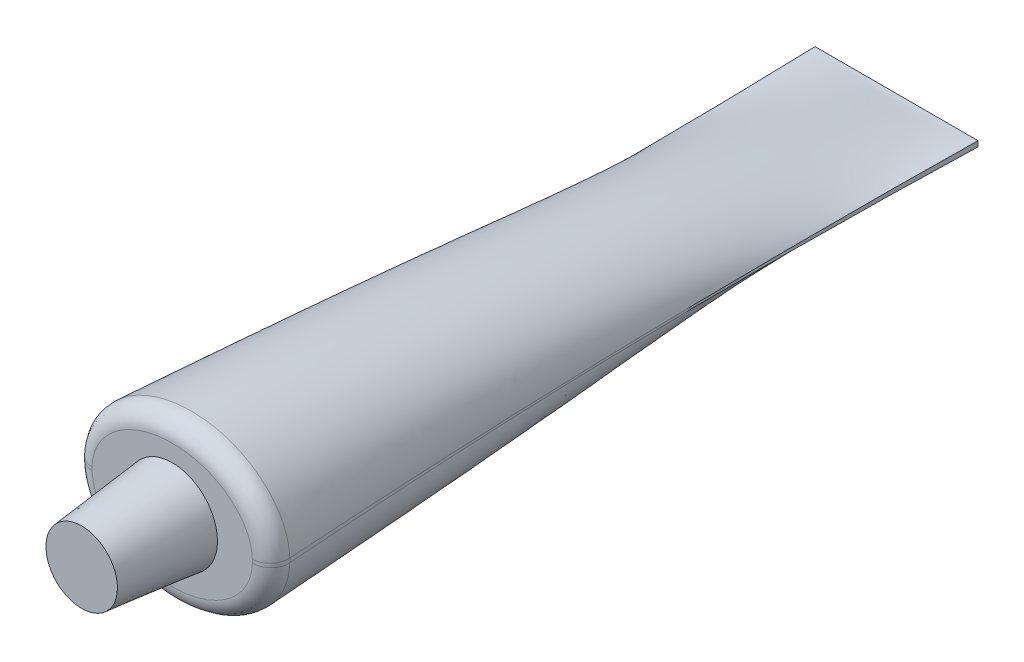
ISO-10303-21;
HEADER;
FILE_DESCRIPTION(('STEP AP214'),'2;1');
FILE_NAME('part.step','',(''),(''),'','','');
FILE_SCHEMA(('AUTOMOTIVE_DESIGN { 1 0 10303 214 1 1 1 1 }'));
ENDSEC;
DATA;
#1=APPLICATION_CONTEXT('core data for automotive mechanical design processes');
#2=APPLICATION_PROTOCOL_DEFINITION('international standard','automotive_design',2000,#1);
#3=PRODUCT_CONTEXT('',#1,'mechanical');
#4=PRODUCT('Part','Part','',(#3));
#5=PRODUCT_RELATED_PRODUCT_CATEGORY('part','',(#4));
#6=PRODUCT_DEFINITION_FORMATION('','',#4);
#7=PRODUCT_DEFINITION_CONTEXT('part definition',#1,'design');
#8=PRODUCT_DEFINITION('design','',#6,#7);
#9=PRODUCT_DEFINITION_SHAPE('','',#8);
#10=(LENGTH_UNIT() NAMED_UNIT(*) SI_UNIT(.MILLI.,.METRE.));
#11=(NAMED_UNIT(*) PLANE_ANGLE_UNIT() SI_UNIT($,.RADIAN.));
#12=(NAMED_UNIT(*) SI_UNIT($,.STERADIAN.) SOLID_ANGLE_UNIT());
#13=UNCERTAINTY_MEASURE_WITH_UNIT(LENGTH_MEASURE(1.E-05),#10,'distance_accuracy_value','');
#14=(GEOMETRIC_REPRESENTATION_CONTEXT(3) GLOBAL_UNCERTAINTY_ASSIGNED_CONTEXT((#13)) GLOBAL_UNIT_ASSIGNED_CONTEXT((#10,
#11,#12)) REPRESENTATION_CONTEXT('',''));
#15=CARTESIAN_POINT('',(0.,0.,0.));
#16=DIRECTION('',(0.,0.,1.));
#17=DIRECTION('',(1.,0.,0.));
#18=AXIS2_PLACEMENT_3D('',#15,#16,#17);
#19=CARTESIAN_POINT('',(0.,0.,400.));
#20=DIRECTION('',(0.,0.,1.));
#21=DIRECTION('',(1.,0.,0.));
#22=AXIS2_PLACEMENT_3D('',#19,#20,#21);
#23=PLANE('',#22);
#24=CARTESIAN_POINT('',(-54.4751454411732,12.0715504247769,389.142964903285));
#25=CARTESIAN_POINT('',(-55.4088450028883,12.0511588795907,400.));
#26=CARTESIAN_POINT('',(-44.5143137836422,12.2890901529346,400.));
#27=CARTESIAN_POINT('',(-54.4290754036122,9.86738789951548,389.166999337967));
#28=CARTESIAN_POINT('',(-55.3344275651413,9.8504512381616,400.));
#29=CARTESIAN_POINT('',(-44.4661832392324,10.0852653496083,400.));
#30=CARTESIAN_POINT('',(-54.3828211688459,7.66322943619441,389.191037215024));
#31=CARTESIAN_POINT('',(-55.2599226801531,7.64688630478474,400.));
#32=CARTESIAN_POINT('',(-44.4179557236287,7.88144267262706,400.));
#33=CARTESIAN_POINT('',(-54.289944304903,3.25492063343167,389.239119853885));
#34=CARTESIAN_POINT('',(-55.1109319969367,3.23978189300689,400.));
#35=CARTESIAN_POINT('',(-44.3213067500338,3.47380157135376,400.));
#36=CARTESIAN_POINT('',(-54.2433216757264,1.05077029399,389.26316461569));
#37=CARTESIAN_POINT('',(-55.0364454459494,1.03622155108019,400.));
#38=CARTESIAN_POINT('',(-44.2728852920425,1.26998314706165,400.));
#39=CARTESIAN_POINT('',(-54.1965148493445,-1.15337598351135,389.28721281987));
#40=CARTESIAN_POINT('',(-54.96187032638,-1.17022574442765,400.));
#41=CARTESIAN_POINT('',(-44.2243668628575,-0.933833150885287,400.));
#42=CARTESIAN_POINT('',(-54.1880757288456,-1.54931135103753,389.290996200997));
#43=CARTESIAN_POINT('',(-54.948898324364,-1.57427088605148,400.));
#44=CARTESIAN_POINT('',(-44.2180304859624,-1.2217732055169,400.));
#45=CARTESIAN_POINT('',(-54.1731756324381,-1.94550470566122,389.294744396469));
#46=CARTESIAN_POINT('',(-54.929377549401,-1.97854639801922,400.));
#47=CARTESIAN_POINT('',(-44.2070108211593,-1.50959037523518,400.));
#48=CARTESIAN_POINT('',(-54.1303866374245,-2.73777001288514,389.302153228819));
#49=CARTESIAN_POINT('',(-54.8771971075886,-2.78672843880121,400.));
#50=CARTESIAN_POINT('',(-44.1755715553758,-2.08471059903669,400.));
#51=CARTESIAN_POINT('',(-54.1024977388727,-3.13384196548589,389.305813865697));
#52=CARTESIAN_POINT('',(-54.8445424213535,-3.19063901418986,400.));
#53=CARTESIAN_POINT('',(-44.1551519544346,-2.37201365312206,400.));
#54=CARTESIAN_POINT('',(-53.9992804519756,-4.32054154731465,389.316635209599));
#55=CARTESIAN_POINT('',(-54.7268741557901,-4.40021813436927,400.));
#56=CARTESIAN_POINT('',(-44.0797672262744,-3.23247496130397,400.));
#57=CARTESIAN_POINT('',(-53.9043935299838,-5.11003246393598,389.323638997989));
#58=CARTESIAN_POINT('',(-54.6221261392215,-5.20461995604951,400.));
#59=CARTESIAN_POINT('',(-44.010670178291,-3.80446102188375,400.));
#60=CARTESIAN_POINT('',(-53.6633731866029,-6.67799254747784,389.337079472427));
#61=CARTESIAN_POINT('',(-54.3611699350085,-6.80119251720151,400.));
#62=CARTESIAN_POINT('',(-43.8352975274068,-4.94103725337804,400.));
#63=CARTESIAN_POINT('',(-53.5173816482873,-7.45648608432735,389.343517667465));
#64=CARTESIAN_POINT('',(-54.2051339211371,-7.59344370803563,400.));
#65=CARTESIAN_POINT('',(-43.7291248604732,-5.50564345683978,400.));
#66=CARTESIAN_POINT('',(-53.1756934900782,-8.99987449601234,389.355750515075));
#67=CARTESIAN_POINT('',(-53.8433540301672,-9.16316855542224,400.));
#68=CARTESIAN_POINT('',(-43.4802915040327,-6.62692971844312,400.));
#69=CARTESIAN_POINT('',(-52.9799839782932,-9.76476578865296,389.361545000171));
#70=CARTESIAN_POINT('',(-53.6376171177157,-9.94070290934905,400.));
#71=CARTESIAN_POINT('',(-43.337621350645,-7.1836076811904,400.));
#72=CARTESIAN_POINT('',(-52.5832183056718,-11.1321553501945,389.371383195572));
#73=CARTESIAN_POINT('',(-53.2228699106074,-11.3300154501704,400.));
#74=CARTESIAN_POINT('',(-43.0475888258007,-8.18151702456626,400.));
#75=CARTESIAN_POINT('',(-52.3902911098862,-11.7378183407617,389.375550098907));
#76=CARTESIAN_POINT('',(-53.0219820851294,-11.9451195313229,400.));
#77=CARTESIAN_POINT('',(-42.9063038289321,-8.62452921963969,400.));
#78=CARTESIAN_POINT('',(-51.9751422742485,-12.9353146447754,389.383397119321));
#79=CARTESIAN_POINT('',(-52.5911279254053,-13.1608115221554,400.));
#80=CARTESIAN_POINT('',(-42.6014227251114,-9.50286613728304,400.));
#81=CARTESIAN_POINT('',(-51.7529173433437,-13.5271463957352,389.38707718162));
#82=CARTESIAN_POINT('',(-52.3611592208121,-13.7614356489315,400.));
#83=CARTESIAN_POINT('',(-42.4378241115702,-9.93818998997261,400.));
#84=CARTESIAN_POINT('',(-51.2808931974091,-14.6954986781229,389.393944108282));
#85=CARTESIAN_POINT('',(-51.8739211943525,-14.9467489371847,400.));
#86=CARTESIAN_POINT('',(-42.0891807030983,-10.8003230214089,400.));
#87=CARTESIAN_POINT('',(-51.0310850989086,-15.2720142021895,389.397130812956));
#88=CARTESIAN_POINT('',(-51.6166401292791,-15.5314701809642,400.));
#89=CARTESIAN_POINT('',(-41.9041289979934,-11.2271294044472,400.));
#90=CARTESIAN_POINT('',(-50.5058129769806,-16.4083502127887,389.403015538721));
#91=CARTESIAN_POINT('',(-51.0767343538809,-16.68366029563,400.));
#92=CARTESIAN_POINT('',(-41.5136116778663,-12.0713207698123,400.));
#93=CARTESIAN_POINT('',(-50.230345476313,-16.9681684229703,389.405713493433));
#94=CARTESIAN_POINT('',(-50.7941000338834,-17.2511623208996,400.));
#95=CARTESIAN_POINT('',(-41.3081432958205,-12.4887044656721,400.));
#96=CARTESIAN_POINT('',(-49.3670532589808,-18.6234536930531,389.413104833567));
#97=CARTESIAN_POINT('',(-49.9098895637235,-18.9285752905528,400.));
#98=CARTESIAN_POINT('',(-40.6617382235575,-13.727414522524,400.));
#99=CARTESIAN_POINT('',(-48.7432590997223,-19.6925004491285,389.417082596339));
#100=CARTESIAN_POINT('',(-49.2726690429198,-20.011747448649,400.));
#101=CARTESIAN_POINT('',(-40.1914784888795,-14.5336392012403,400.));
#102=CARTESIAN_POINT('',(-47.4148817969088,-21.7552471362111,389.423332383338));
#103=CARTESIAN_POINT('',(-47.9187689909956,-22.1011738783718,400.));
#104=CARTESIAN_POINT('',(-39.1817645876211,-16.1010344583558,400.));
#105=CARTESIAN_POINT('',(-46.7103053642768,-22.7489533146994,389.425604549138));
#106=CARTESIAN_POINT('',(-47.2019998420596,-23.1076491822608,400.));
#107=CARTESIAN_POINT('',(-38.6423161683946,-16.8622087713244,400.));
#108=CARTESIAN_POINT('',(-45.2410779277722,-24.6502509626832,389.428694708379));
#109=CARTESIAN_POINT('',(-45.7096391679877,-25.0332198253,400.));
#110=CARTESIAN_POINT('',(-37.5085686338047,-18.3291444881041,400.));
#111=CARTESIAN_POINT('',(-44.4771686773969,-25.5586657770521,389.429528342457));
#112=CARTESIAN_POINT('',(-44.9346779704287,-25.9533050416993,400.));
#113=CARTESIAN_POINT('',(-36.9149343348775,-19.03542111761,400.));
#114=CARTESIAN_POINT('',(-42.8931968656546,-27.3025083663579,389.430056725));
#115=CARTESIAN_POINT('',(-43.329447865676,-27.7196717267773,400.));
#116=CARTESIAN_POINT('',(-35.6752632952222,-20.400177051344,400.));
#117=CARTESIAN_POINT('',(-42.0731355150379,-28.1379377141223,389.429751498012));
#118=CARTESIAN_POINT('',(-42.4990847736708,-28.5660635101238,400.));
#119=CARTESIAN_POINT('',(-35.0292276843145,-21.0586573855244,400.));
#120=CARTESIAN_POINT('',(-40.3855966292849,-29.7377963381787,389.428256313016));
#121=CARTESIAN_POINT('',(-40.7915263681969,-30.1872097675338,400.));
#122=CARTESIAN_POINT('',(-33.6913569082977,-22.3271092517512,400.));
#123=CARTESIAN_POINT('',(-39.5181222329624,-30.5022303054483,389.427066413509));
#124=CARTESIAN_POINT('',(-39.9142503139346,-30.9620393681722,400.));
#125=CARTESIAN_POINT('',(-32.9995247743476,-22.9370839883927,400.));
#126=CARTESIAN_POINT('',(-37.7428809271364,-31.962521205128,389.424030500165));
#127=CARTESIAN_POINT('',(-38.1197500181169,-32.4425790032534,400.));
#128=CARTESIAN_POINT('',(-31.5758404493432,-24.1083740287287,400.));
#129=CARTESIAN_POINT('',(-36.8351086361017,-32.6583689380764,389.422184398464));
#130=CARTESIAN_POINT('',(-37.2024515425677,-33.1483201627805,400.));
#131=CARTESIAN_POINT('',(-30.8439829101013,-24.6696828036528,400.));
#132=CARTESIAN_POINT('',(-34.5890584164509,-34.2677334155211,389.417150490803));
#133=CARTESIAN_POINT('',(-34.9333411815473,-34.7811577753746,400.));
#134=CARTESIAN_POINT('',(-29.0244257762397,-25.9737309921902,400.));
#135=CARTESIAN_POINT('',(-33.232889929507,-35.1468609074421,389.413726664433));
#136=CARTESIAN_POINT('',(-33.5636912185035,-35.6735626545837,400.));
#137=CARTESIAN_POINT('',(-27.9185501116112,-26.6912339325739,400.));
#138=CARTESIAN_POINT('',(-30.4649073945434,-36.7762859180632,389.406446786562));
#139=CARTESIAN_POINT('',(-30.7686415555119,-37.3284196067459,400.));
#140=CARTESIAN_POINT('',(-25.648740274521,-28.0278192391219,400.));
#141=CARTESIAN_POINT('',(-29.0530750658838,-37.5265406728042,389.402590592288));
#142=CARTESIAN_POINT('',(-29.3431379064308,-38.090816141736,400.));
#143=CARTESIAN_POINT('',(-24.4847869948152,-28.6468689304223,400.));
#144=CARTESIAN_POINT('',(-26.1842730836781,-38.9039723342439,389.394836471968));
#145=CARTESIAN_POINT('',(-26.4465838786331,-39.4912653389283,400.));
#146=CARTESIAN_POINT('',(-22.109066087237,-29.7879831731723,400.));
#147=CARTESIAN_POINT('',(-24.7272628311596,-39.5310345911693,389.390938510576));
#148=CARTESIAN_POINT('',(-24.9754685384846,-40.1291532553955,400.));
#149=CARTESIAN_POINT('',(-20.897255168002,-30.309957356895,400.));
#150=CARTESIAN_POINT('',(-21.7793729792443,-40.6655353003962,389.383419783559));
#151=CARTESIAN_POINT('',(-21.9988240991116,-41.2838188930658,400.));
#152=CARTESIAN_POINT('',(-18.4366913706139,-31.2573256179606,400.));
#153=CARTESIAN_POINT('',(-20.288496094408,-41.1729833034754,389.379798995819));
#154=CARTESIAN_POINT('',(-20.4933274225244,-41.8005409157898,400.));
#155=CARTESIAN_POINT('',(-17.1879414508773,-31.6827274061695,400.));
#156=CARTESIAN_POINT('',(-17.2505757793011,-42.0811815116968,389.373013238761));
#157=CARTESIAN_POINT('',(-17.4252774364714,-42.7257621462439,400.));
#158=CARTESIAN_POINT('',(-14.6360959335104,-32.4459850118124,400.));
#159=CARTESIAN_POINT('',(-15.7030076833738,-42.4795258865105,389.369859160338));
#160=CARTESIAN_POINT('',(-15.8622782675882,-43.1317456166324,400.));
#161=CARTESIAN_POINT('',(-13.3324109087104,-32.7818630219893,400.));
#162=CARTESIAN_POINT('',(-12.5898212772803,-43.1587316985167,389.364300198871));
#163=CARTESIAN_POINT('',(-12.7177109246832,-43.8242492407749,400.));
#164=CARTESIAN_POINT('',(-10.7036059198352,-33.3556971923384,400.));
#165=CARTESIAN_POINT('',(-11.024202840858,-43.4395923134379,389.36189532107));
#166=CARTESIAN_POINT('',(-11.1362627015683,-44.1107054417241,400.));
#167=CARTESIAN_POINT('',(-9.37848580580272,-33.5936526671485,400.));
#168=CARTESIAN_POINT('',(-8.66849975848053,-43.7749192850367,389.358959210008));
#169=CARTESIAN_POINT('',(-8.7566798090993,-44.4527979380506,400.));
#170=CARTESIAN_POINT('',(-7.38068658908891,-33.8781965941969,400.));
#171=CARTESIAN_POINT('',(-7.88192143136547,-43.8723766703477,389.358092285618));
#172=CARTESIAN_POINT('',(-7.96208354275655,-44.5522393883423,400.));
#173=CARTESIAN_POINT('',(-6.71295513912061,-33.9609874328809,400.));
#174=CARTESIAN_POINT('',(-6.30719905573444,-44.0389900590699,389.35659491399));
#175=CARTESIAN_POINT('',(-6.37128456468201,-44.7222643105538,400.));
#176=CARTESIAN_POINT('',(-5.37493356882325,-34.1026389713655,400.));
#177=CARTESIAN_POINT('',(-5.51905501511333,-44.1081462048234,389.355964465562));
#178=CARTESIAN_POINT('',(-5.57510182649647,-44.7928434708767,400.));
#179=CARTESIAN_POINT('',(-4.70464346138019,-34.1614997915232,400.));
#180=CARTESIAN_POINT('',(-3.94213831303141,-44.2185074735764,389.354950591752));
#181=CARTESIAN_POINT('',(-3.98210138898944,-44.9054853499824,400.));
#182=CARTESIAN_POINT('',(-3.36235128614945,-34.2554961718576,400.));
#183=CARTESIAN_POINT('',(-3.15336561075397,-44.2597106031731,389.354567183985));
#184=CARTESIAN_POINT('',(-3.18530465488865,-44.9475430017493,400.));
#185=CARTESIAN_POINT('',(-2.69034909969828,-34.2906300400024,400.));
#186=CARTESIAN_POINT('',(-1.97044749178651,-44.3008193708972,389.354182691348));
#187=CARTESIAN_POINT('',(-1.99037688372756,-44.9895063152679,400.));
#188=CARTESIAN_POINT('',(-1.68175778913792,-34.3257026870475,400.));
#189=CARTESIAN_POINT('',(-1.57617079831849,-44.311072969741,389.354086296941));
#190=CARTESIAN_POINT('',(-1.59210123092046,-44.9999733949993,400.));
#191=CARTESIAN_POINT('',(-1.3454534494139,-34.3344555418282,400.));
#192=CARTESIAN_POINT('',(-0.78789968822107,-44.3247283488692,389.353957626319));
#193=CARTESIAN_POINT('',(-0.795852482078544,-45.0139133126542,400.));
#194=CARTESIAN_POINT('',(-0.672738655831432,-34.3461154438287,400.));
#195=CARTESIAN_POINT('',(-0.393905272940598,-44.3281300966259,389.353925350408));
#196=CARTESIAN_POINT('',(-0.397882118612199,-45.0173860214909,400.));
#197=CARTESIAN_POINT('',(-0.336328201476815,-34.3490224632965,400.));
#198=CARTESIAN_POINT('',(0.432867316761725,-44.3281289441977,389.353925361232));
#199=CARTESIAN_POINT('',(0.437237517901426,-45.0173848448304,400.));
#200=CARTESIAN_POINT('',(0.369595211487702,-34.3490214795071,400.));
#201=CARTESIAN_POINT('',(0.865647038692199,-44.3240235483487,389.353964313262));
#202=CARTESIAN_POINT('',(0.874385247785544,-45.013193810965,400.));
#203=CARTESIAN_POINT('',(0.739108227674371,-34.3455131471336,400.));
#204=CARTESIAN_POINT('',(1.73153394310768,-44.3075401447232,389.354119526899));
#205=CARTESIAN_POINT('',(1.74903859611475,-44.9963670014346,400.));
#206=CARTESIAN_POINT('',(1.47800045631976,-34.3314396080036,400.));
#207=CARTESIAN_POINT('',(2.16464112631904,-44.295162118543,389.354235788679));
#208=CARTESIAN_POINT('',(2.18654059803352,-44.9837313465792,400.));
#209=CARTESIAN_POINT('',(1.84737966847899,-34.320874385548,400.));
#210=CARTESIAN_POINT('',(3.03091159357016,-44.2620714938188,389.354544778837));
#211=CARTESIAN_POINT('',(3.06161649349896,-44.9499529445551,400.));
#212=CARTESIAN_POINT('',(2.58587129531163,-34.2926472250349,400.));
#213=CARTESIAN_POINT('',(3.46407487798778,-44.2413588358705,389.354737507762));
#214=CARTESIAN_POINT('',(3.49918681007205,-44.9288104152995,400.));
#215=CARTESIAN_POINT('',(2.95498370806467,-34.2749852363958,400.));
#216=CARTESIAN_POINT('',(4.33032489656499,-44.1915395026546,389.355198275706));
#217=CARTESIAN_POINT('',(4.37426275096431,-44.8779589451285,400.));
#218=CARTESIAN_POINT('',(3.69279250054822,-34.2325275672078,400.));
#219=CARTESIAN_POINT('',(4.76341163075,-44.1624328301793,389.355466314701));
#220=CARTESIAN_POINT('',(4.81176485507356,-44.8482504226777,400.));
#221=CARTESIAN_POINT('',(4.06148888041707,-34.2077318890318,400.));
#222=CARTESIAN_POINT('',(6.06235950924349,-44.0624278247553,389.356381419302));
#223=CARTESIAN_POINT('',(6.12394613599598,-44.7461837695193,400.));
#224=CARTESIAN_POINT('',(5.16678215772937,-34.1225855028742,400.));
#225=CARTESIAN_POINT('',(6.92790755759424,-43.9788445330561,389.357139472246));
#226=CARTESIAN_POINT('',(6.99832157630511,-44.6608846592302,400.));
#227=CARTESIAN_POINT('',(5.90258253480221,-34.051475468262,400.));
#228=CARTESIAN_POINT('',(8.65678601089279,-43.7773927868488,389.358936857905));
#229=CARTESIAN_POINT('',(8.74484524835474,-44.455321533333,400.));
#230=CARTESIAN_POINT('',(7.37078426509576,-33.8802994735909,400.));
#231=CARTESIAN_POINT('',(9.52011642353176,-43.6595244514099,389.359976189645));
#232=CARTESIAN_POINT('',(9.61696746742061,-44.3350640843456,400.));
#233=CARTESIAN_POINT('',(8.103185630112,-33.7802336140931,400.));
#234=CARTESIAN_POINT('',(11.243190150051,-43.3890479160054,389.362316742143));
#235=CARTESIAN_POINT('',(11.357572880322,-44.0591462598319,400.));
#236=CARTESIAN_POINT('',(9.56330972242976,-33.550904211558,400.));
#237=CARTESIAN_POINT('',(12.1029340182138,-43.2364453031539,389.36361792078));
#238=CARTESIAN_POINT('',(12.2260327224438,-43.9034998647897,400.));
#239=CARTESIAN_POINT('',(10.29103318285,-33.4216453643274,400.));
#240=CARTESIAN_POINT('',(13.817571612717,-42.8960287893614,389.366457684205));
#241=CARTESIAN_POINT('',(13.958013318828,-43.5563560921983,400.));
#242=CARTESIAN_POINT('',(11.7405865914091,-33.133702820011,400.));
#243=CARTESIAN_POINT('',(14.6724652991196,-42.7082145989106,389.367996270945));
#244=CARTESIAN_POINT('',(14.8215128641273,-43.3648682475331,400.));
#245=CARTESIAN_POINT('',(12.4624164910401,-32.975018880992,400.));
#246=CARTESIAN_POINT('',(17.2277096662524,-42.0912211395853,389.372926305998));
#247=CARTESIAN_POINT('',(17.4021735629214,-42.7359918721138,400.));
#248=CARTESIAN_POINT('',(14.6169899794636,-32.4544955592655,400.));
#249=CARTESIAN_POINT('',(18.9192171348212,-41.6083988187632,389.376632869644));
#250=CARTESIAN_POINT('',(19.1104397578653,-42.244053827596,400.));
#251=CARTESIAN_POINT('',(16.0393204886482,-32.0481062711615,400.));
#252=CARTESIAN_POINT('',(22.0427436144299,-40.5696420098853,389.384059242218));
#253=CARTESIAN_POINT('',(22.2648071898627,-41.1861891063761,400.));
#254=CARTESIAN_POINT('',(18.6568163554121,-31.1772298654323,400.));
#255=CARTESIAN_POINT('',(23.4793042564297,-40.0320241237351,389.387711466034));
#256=CARTESIAN_POINT('',(23.7153745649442,-40.6389507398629,400.));
#257=CARTESIAN_POINT('',(19.8569959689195,-30.727701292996,400.));
#258=CARTESIAN_POINT('',(26.317124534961,-38.8424505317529,389.395173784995));
#259=CARTESIAN_POINT('',(26.5807503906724,-39.4286958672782,400.));
#260=CARTESIAN_POINT('',(22.2191854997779,-29.7370907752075,400.));
#261=CARTESIAN_POINT('',(27.7183839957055,-38.1904942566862,389.398983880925));
#262=CARTESIAN_POINT('',(27.9955491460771,-38.7657347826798,400.));
#263=CARTESIAN_POINT('',(23.3811952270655,-29.1960083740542,400.));
#264=CARTESIAN_POINT('',(30.4750805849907,-36.7683857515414,389.406446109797));
#265=CARTESIAN_POINT('',(30.778936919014,-37.3204025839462,400.));
#266=CARTESIAN_POINT('',(25.6568880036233,-28.021620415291,400.));
#267=CARTESIAN_POINT('',(31.8305440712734,-35.9983029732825,389.410098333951));
#268=CARTESIAN_POINT('',(32.1475935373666,-36.5381371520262,400.));
#269=CARTESIAN_POINT('',(26.7705989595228,-27.3883690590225,400.));
#270=CARTESIAN_POINT('',(34.4849845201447,-34.3345600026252,389.416857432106));
#271=CARTESIAN_POINT('',(34.8282421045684,-34.8490041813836,400.));
#272=CARTESIAN_POINT('',(28.9395060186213,-26.0285559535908,400.));
#273=CARTESIAN_POINT('',(35.7839755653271,-33.4409308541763,389.41996444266));
#274=CARTESIAN_POINT('',(36.1403459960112,-33.94216381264,400.));
#275=CARTESIAN_POINT('',(29.9947167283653,-25.3020176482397,400.));
#276=CARTESIAN_POINT('',(38.0243442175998,-31.7418777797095,389.424561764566));
#277=CARTESIAN_POINT('',(38.4041752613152,-32.2188466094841,400.));
#278=CARTESIAN_POINT('',(31.8024102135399,-23.9308377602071,400.));
#279=CARTESIAN_POINT('',(38.9799571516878,-30.9624889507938,389.426258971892));
#280=CARTESIAN_POINT('',(39.3701175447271,-31.4286006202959,400.));
#281=CARTESIAN_POINT('',(32.5692327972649,-23.3050511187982,400.));
#282=CARTESIAN_POINT('',(40.8410285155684,-29.3233511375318,389.428774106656));
#283=CARTESIAN_POINT('',(41.2521917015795,-29.7672088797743,400.));
#284=CARTESIAN_POINT('',(34.0536864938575,-21.9974617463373,400.));
#285=CARTESIAN_POINT('',(41.7464897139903,-28.4636065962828,389.429592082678));
#286=CARTESIAN_POINT('',(42.1684207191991,-28.8960009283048,400.));
#287=CARTESIAN_POINT('',(34.7713203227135,-21.315662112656,400.));
#288=CARTESIAN_POINT('',(43.4965298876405,-26.6619697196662,389.430049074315));
#289=CARTESIAN_POINT('',(43.9406075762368,-27.0708293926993,400.));
#290=CARTESIAN_POINT('',(36.1489988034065,-19.8973359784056,400.));
#291=CARTESIAN_POINT('',(44.3411681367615,-25.7201593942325,389.429689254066));
#292=CARTESIAN_POINT('',(44.7967360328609,-26.1168366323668,400.));
#293=CARTESIAN_POINT('',(36.8090996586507,-19.16086421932,400.));
#294=CARTESIAN_POINT('',(45.9584639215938,-23.7518348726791,389.427467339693));
#295=CARTESIAN_POINT('',(46.4379360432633,-24.1233396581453,400.));
#296=CARTESIAN_POINT('',(38.0637708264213,-17.6340272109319,400.));
#297=CARTESIAN_POINT('',(46.7311363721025,-22.7253383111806,389.425605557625));
#298=CARTESIAN_POINT('',(47.2231447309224,-23.0836843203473,400.));
#299=CARTESIAN_POINT('',(38.6583547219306,-16.843673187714,400.));
#300=CARTESIAN_POINT('',(48.0537344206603,-20.787465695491,389.420575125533));
#301=CARTESIAN_POINT('',(48.5695237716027,-21.1209771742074,400.));
#302=CARTESIAN_POINT('',(39.6683645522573,-15.3642095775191,400.));
#303=CARTESIAN_POINT('',(48.6183063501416,-19.8904078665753,389.417715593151));
#304=CARTESIAN_POINT('',(49.1452460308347,-20.2122414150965,400.));
#305=CARTESIAN_POINT('',(40.0965090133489,-14.6837691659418,400.));
#306=CARTESIAN_POINT('',(49.6814455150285,-18.0418588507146,389.410638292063));
#307=CARTESIAN_POINT('',(50.2315884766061,-18.3392975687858,400.));
#308=CARTESIAN_POINT('',(40.8978050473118,-13.2911350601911,400.));
#309=CARTESIAN_POINT('',(50.1800154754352,-17.0903699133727,389.406420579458));
#310=CARTESIAN_POINT('',(50.7422653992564,-17.374935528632,400.));
#311=CARTESIAN_POINT('',(41.2709588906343,-12.5789426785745,400.));
#312=CARTESIAN_POINT('',(51.1007606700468,-15.1384433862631,389.396534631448));
#313=CARTESIAN_POINT('',(51.6880956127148,-15.395933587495,400.));
#314=CARTESIAN_POINT('',(41.9562592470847,-11.1271875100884,400.));
#315=CARTESIAN_POINT('',(51.5230628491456,-14.1380907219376,389.390868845));
#316=CARTESIAN_POINT('',(52.1234089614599,-14.3811992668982,400.));
#317=CARTESIAN_POINT('',(42.2685072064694,-10.3876727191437,400.));
#318=CARTESIAN_POINT('',(52.2826547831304,-12.0937300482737,389.378066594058));
#319=CARTESIAN_POINT('',(52.909744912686,-12.3064070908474,400.));
#320=CARTESIAN_POINT('',(42.8276813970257,-8.88440641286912,400.));
#321=CARTESIAN_POINT('',(52.6199679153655,-11.0497341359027,389.370930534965));
#322=CARTESIAN_POINT('',(53.2607953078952,-11.2461669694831,400.000000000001));
#323=CARTESIAN_POINT('',(43.0746255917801,-8.12066162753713,400.));
#324=CARTESIAN_POINT('',(53.1067373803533,-9.27325014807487,389.357834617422));
#325=CARTESIAN_POINT('',(53.7708059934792,-9.44111404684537,400.));
#326=CARTESIAN_POINT('',(43.4300579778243,-6.82578583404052,400.));
#327=CARTESIAN_POINT('',(53.2816126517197,-8.54986206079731,389.352246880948));
#328=CARTESIAN_POINT('',(53.9551437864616,-8.70560747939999,400.));
#329=CARTESIAN_POINT('',(43.5574567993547,-6.29977473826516,400.));
#330=CARTESIAN_POINT('',(53.5869715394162,-7.09168837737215,389.340513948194));
#331=CARTESIAN_POINT('',(54.2794284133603,-7.2222563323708,400.));
#332=CARTESIAN_POINT('',(43.77974759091,-5.24100396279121,400.));
#333=CARTESIAN_POINT('',(53.7174638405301,-6.35690504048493,389.334368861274));
#334=CARTESIAN_POINT('',(54.419365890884,-6.47436148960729,400.));
#335=CARTESIAN_POINT('',(43.8746459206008,-4.70824562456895,400.));
#336=CARTESIAN_POINT('',(53.9330501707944,-4.87853722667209,389.321593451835));
#337=CARTESIAN_POINT('',(54.6536759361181,-4.96880477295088,400.));
#338=CARTESIAN_POINT('',(44.0315343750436,-3.63672108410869,400.));
#339=CARTESIAN_POINT('',(54.0180474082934,-4.13493739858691,389.314962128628));
#340=CARTESIAN_POINT('',(54.7479256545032,-4.21108224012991,400.));
#341=CARTESIAN_POINT('',(44.0934543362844,-3.09794454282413,400.));
#342=CARTESIAN_POINT('',(54.1108889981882,-3.01758734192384,389.304741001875));
#343=CARTESIAN_POINT('',(54.8543339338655,-3.07209675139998,400.));
#344=CARTESIAN_POINT('',(44.1612935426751,-2.28768711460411,400.));
#345=CARTESIAN_POINT('',(54.1360619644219,-2.64474160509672,389.301287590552));
#346=CARTESIAN_POINT('',(54.8839818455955,-2.69185220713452,400.));
#347=CARTESIAN_POINT('',(44.1797342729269,-2.01720120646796,400.));
#348=CARTESIAN_POINT('',(54.1749026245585,-1.89897914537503,389.294304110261));
#349=CARTESIAN_POINT('',(54.9316464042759,-1.93108066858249,400.));
#350=CARTESIAN_POINT('',(44.2082886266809,-1.47579038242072,400.));
#351=CARTESIAN_POINT('',(54.1885703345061,-1.52606242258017,389.2907740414));
#352=CARTESIAN_POINT('',(54.9496588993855,-1.55055035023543,400.));
#353=CARTESIAN_POINT('',(44.2184022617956,-1.20486546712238,400.));
#354=CARTESIAN_POINT('',(54.1965148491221,-1.15337599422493,389.287212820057));
#355=CARTESIAN_POINT('',(54.96187032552,-1.17022575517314,400.));
#356=CARTESIAN_POINT('',(44.224366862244,-0.933833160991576,400.));
#357=CARTESIAN_POINT('',(54.2909163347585,3.29201801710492,389.238703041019));
#358=CARTESIAN_POINT('',(55.1124813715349,3.28586793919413,400.));
#359=CARTESIAN_POINT('',(44.3222208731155,3.51089513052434,400.));
#360=CARTESIAN_POINT('',(54.3845686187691,7.73742831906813,389.190215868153));
#361=CARTESIAN_POINT('',(55.2627267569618,7.73007769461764,400.));
#362=CARTESIAN_POINT('',(44.4196799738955,7.9556320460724,400.));
#363=CARTESIAN_POINT('',(54.570374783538,16.6282815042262,389.093286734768));
#364=CARTESIAN_POINT('',(55.5632855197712,16.6183501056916,400.));
#365=CARTESIAN_POINT('',(44.6138083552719,16.8451231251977,400.));
#366=CARTESIAN_POINT('',(54.6625286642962,21.073724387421,389.044844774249));
#367=CARTESIAN_POINT('',(55.7136048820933,21.0625782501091,400.));
#368=CARTESIAN_POINT('',(44.7104776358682,21.289877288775,400.));
#369=CARTESIAN_POINT('',(54.7539333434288,25.5191835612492,388.996425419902));
#370=CARTESIAN_POINT('',(55.8635672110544,25.4951488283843,400.));
#371=CARTESIAN_POINT('',(44.8067520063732,25.7346400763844,400.));
#372=(BOUNDED_SURFACE() B_SPLINE_SURFACE(3,2,((#24,#25,#26),(#27,#28,#29),(#30,#31,#32),(#33,
#34,#35),(#36,#37,#38),(#39,#40,#41),(#42,#43,#44),(#45,#46,#47),(#48,#49,#50),(#51,#52,#53),
(#54,#55,#56),(#57,#58,#59),(#60,#61,#62),(#63,#64,#65),(#66,#67,#68),(#69,#70,#71),(#72,#73,
#74),(#75,#76,#77),(#78,#79,#80),(#81,#82,#83),(#84,#85,#86),(#87,#88,#89),(#90,#91,#92),(#93,
#94,#95),(#96,#97,#98),(#99,#100,#101),(#102,#103,#104),(#105,#106,#107),(#108,#109,#110),(#111,
#112,#113),(#114,#115,#116),(#117,#118,#119),(#120,#121,#122),(#123,#124,#125),(#126,#127,#128),
(#129,#130,#131),(#132,#133,#134),(#135,#136,#137),(#138,#139,#140),(#141,#142,#143),(#144,#145,
#146),(#147,#148,#149),(#150,#151,#152),(#153,#154,#155),(#156,#157,#158),(#159,#160,#161),
(#162,#163,#164),(#165,#166,#167),(#168,#169,#170),(#171,#172,#173),(#174,#175,#176),(#177,#178,
#179),(#180,#181,#182),(#183,#184,#185),(#186,#187,#188),(#189,#190,#191),(#192,#193,#194),
(#195,#196,#197),(#198,#199,#200),(#201,#202,#203),(#204,#205,#206),(#207,#208,#209),(#210,#211,
#212),(#213,#214,#215),(#216,#217,#218),(#219,#220,#221),(#222,#223,#224),(#225,#226,#227),
(#228,#229,#230),(#231,#232,#233),(#234,#235,#236),(#237,#238,#239),(#240,#241,#242),(#243,#244,
#245),(#246,#247,#248),(#249,#250,#251),(#252,#253,#254),(#255,#256,#257),(#258,#259,#260),
(#261,#262,#263),(#264,#265,#266),(#267,#268,#269),(#270,#271,#272),(#273,#274,#275),(#276,#277,
#278),(#279,#280,#281),(#282,#283,#284),(#285,#286,#287),(#288,#289,#290),(#291,#292,#293),
(#294,#295,#296),(#297,#298,#299),(#300,#301,#302),(#303,#304,#305),(#306,#307,#308),(#309,#310,
#311),(#312,#313,#314),(#315,#316,#317),(#318,#319,#320),(#321,#322,#323),(#324,#325,#326),
(#327,#328,#329),(#330,#331,#332),(#333,#334,#335),(#336,#337,#338),(#339,#340,#341),(#342,#343,
#344),(#345,#346,#347),(#348,#349,#350),(#351,#352,#353),(#354,#355,#356),(#357,#358,#359),
(#360,#361,#362),(#363,#364,#365),(#366,#367,#368),(#369,#370,#371)),.UNSPECIFIED.,.F.,.F.,
.F.) B_SPLINE_SURFACE_WITH_KNOTS((4,2,3,2,2,2,2,2,2,2,2,2,2,2,2,2,2,2,2,2,2,2,2,2,2,2,2,2,2,2,2,
2,2,2,2,2,2,2,2,2,2,2,2,2,2,2,2,2,2,2,2,2,2,2,3,2,4),(3,3),(0.,6.61305092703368,
13.2261018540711,14.0900525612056,14.954003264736,16.681079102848,18.4033975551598,
20.1261630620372,21.5205675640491,22.9151288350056,24.3101405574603,25.7053416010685,
28.5011016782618,31.2966296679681,34.0615667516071,36.8264442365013,39.5911389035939,
42.3562038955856,46.3053266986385,50.2557574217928,54.2098473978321,58.1636215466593,
62.1986114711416,66.2336296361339,68.2518099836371,70.2699801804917,72.2882942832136,
73.2975066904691,74.3067238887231,75.4152454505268,76.5237694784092,77.6323014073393,
78.7408329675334,80.9578980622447,83.1749554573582,85.3916564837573,87.6083757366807,
92.0402911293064,95.881618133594,99.722964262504,103.562060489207,107.400193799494,
110.366951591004,113.333545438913,116.297207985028,119.260254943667,121.669761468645,
124.079168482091,126.484527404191,128.88922397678,130.511949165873,132.134356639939,
133.760202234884,134.573432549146,135.386661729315,148.724077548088,162.061493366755),(0.,1.),
.UNSPECIFIED.) GEOMETRIC_REPRESENTATION_ITEM() RATIONAL_B_SPLINE_SURFACE(((1.,0.67612738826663,
1.),(1.,0.677016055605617,1.),(1.,0.677903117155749,1.),(1.,0.679674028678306,1.),(1.,
0.680557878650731,1.),(1.,0.681440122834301,1.),(1.,0.681578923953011,1.),(1.,0.681716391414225,
1.),(1.,0.681988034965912,1.),(1.,0.682122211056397,1.),(1.,0.682518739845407,1.),(1.,
0.682775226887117,1.),(1.,0.683267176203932,1.),(1.,0.683502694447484,1.),(1.,0.683949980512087,
1.),(1.,0.684161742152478,1.),(1.,0.684521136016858,1.),(1.,0.684673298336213,1.),(1.,
0.68495976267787,1.),(1.,0.685094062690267,1.),(1.,0.685344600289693,1.),(1.,0.68546083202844,
1.),(1.,0.685675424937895,1.),(1.,0.685773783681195,1.),(1.,0.68604320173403,1.),(1.,
0.686188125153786,1.),(1.,0.686415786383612,1.),(1.,0.686498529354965,1.),(1.,0.686611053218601,
1.),(1.,0.68664140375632,1.),(1.,0.686660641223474,1.),(1.,0.686649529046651,1.),(1.,
0.686595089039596,1.),(1.,0.686551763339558,1.),(1.,0.686441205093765,1.),(1.,0.686373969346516,
1.),(1.,0.686190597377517,1.),(1.,0.686065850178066,1.),(1.,0.685800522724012,1.),(1.,
0.685659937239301,1.),(1.,0.685377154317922,1.),(1.,0.685234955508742,1.),(1.,0.684960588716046,
1.),(1.,0.68482841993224,1.),(1.,0.684580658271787,1.),(1.,0.684465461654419,1.),(1.,
0.684262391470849,1.),(1.,0.684174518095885,1.),(1.,0.68406722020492,1.),(1.,0.684035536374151,
1.),(1.,0.683980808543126,1.),(1.,0.683957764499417,1.),(1.,0.683920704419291,1.),(1.,
0.683906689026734,1.),(1.,0.683892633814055,1.),(1.,0.683889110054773,1.),(1.,0.683884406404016,
1.),(1.,0.683883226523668,1.),(1.,0.683883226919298,1.),(1.,0.683884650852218,1.),(1.,
0.683890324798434,1.),(1.,0.683894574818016,1.),(1.,0.683905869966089,1.),(1.,0.683912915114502,
1.),(1.,0.683929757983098,1.),(1.,0.683939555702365,1.),(1.,0.683973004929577,1.),(1.,
0.684000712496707,1.),(1.,0.684066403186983,1.),(1.,0.684104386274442,1.),(1.,0.684189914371,
1.),(1.,0.684237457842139,1.),(1.,0.684341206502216,1.),(1.,0.684397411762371,1.),(1.,
0.6845774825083,1.),(1.,0.684712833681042,1.),(1.,0.684983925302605,1.),(1.,0.685117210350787,
1.),(1.,0.685389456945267,1.),(1.,0.685528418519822,1.),(1.,0.685800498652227,1.),(1.,
0.6859336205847,1.),(1.,0.686179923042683,1.),(1.,0.686293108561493,1.),(1.,0.686460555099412,
1.),(1.,0.686522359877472,1.),(1.,0.686613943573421,1.),(1.,0.686643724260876,1.),(1.,
0.686660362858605,1.),(1.,0.686647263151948,1.),(1.,0.686566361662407,1.),(1.,0.68649857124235,
1.),(1.,0.686315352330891,1.),(1.,0.686211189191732,1.),(1.,0.685953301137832,1.),(1.,
0.685799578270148,1.),(1.,0.685439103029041,1.),(1.,0.685232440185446,1.),(1.,0.684765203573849,
1.),(1.,0.684504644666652,1.),(1.,0.684026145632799,1.),(1.,0.683821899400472,1.),(1.,
0.683392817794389,1.),(1.,0.683167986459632,1.),(1.,0.682700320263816,1.),(1.,0.682457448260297,
1.),(1.,0.682082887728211,1.),(1.,0.681956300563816,1.),(1.,0.681700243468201,1.),(1.,
0.681570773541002,1.),(1.,0.6814401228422,1.),(1.,0.679660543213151,1.),(1.,0.677874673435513,
1.),(1.,0.674290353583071,1.),(1.,0.672491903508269,1.),(1.,0.670687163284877,1.))) REPRESENTATION_ITEM('') SURFACE());
#373=CARTESIAN_POINT('',(-44.5143137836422,12.2890901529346,400.));
#374=CARTESIAN_POINT('',(-44.4661832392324,10.0852653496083,400.));
#375=CARTESIAN_POINT('',(-44.4179557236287,7.88144267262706,400.));
#376=CARTESIAN_POINT('',(-44.3213067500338,3.47380157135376,400.));
#377=CARTESIAN_POINT('',(-44.2728852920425,1.26998314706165,400.));
#378=CARTESIAN_POINT('',(-44.2243668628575,-0.933833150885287,400.));
#379=CARTESIAN_POINT('',(-44.2180304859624,-1.2217732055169,400.));
#380=CARTESIAN_POINT('',(-44.2070108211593,-1.50959037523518,400.));
#381=CARTESIAN_POINT('',(-44.1755715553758,-2.08471059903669,400.));
#382=CARTESIAN_POINT('',(-44.1551519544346,-2.37201365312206,400.));
#383=CARTESIAN_POINT('',(-44.0797672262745,-3.23247496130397,400.));
#384=CARTESIAN_POINT('',(-44.010670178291,-3.80446102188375,400.));
#385=CARTESIAN_POINT('',(-43.8352975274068,-4.94103725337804,400.));
#386=CARTESIAN_POINT('',(-43.7291248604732,-5.50564345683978,400.));
#387=CARTESIAN_POINT('',(-43.4802915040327,-6.62692971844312,400.));
#388=CARTESIAN_POINT('',(-43.337621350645,-7.1836076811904,400.));
#389=CARTESIAN_POINT('',(-43.0475888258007,-8.18151702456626,400.));
#390=CARTESIAN_POINT('',(-42.9063038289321,-8.62452921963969,400.));
#391=CARTESIAN_POINT('',(-42.6014227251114,-9.50286613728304,400.));
#392=CARTESIAN_POINT('',(-42.4378241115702,-9.93818998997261,400.));
#393=CARTESIAN_POINT('',(-42.0891807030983,-10.8003230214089,400.));
#394=CARTESIAN_POINT('',(-41.9041289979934,-11.2271294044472,400.));
#395=CARTESIAN_POINT('',(-41.5136116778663,-12.0713207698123,400.));
#396=CARTESIAN_POINT('',(-41.3081432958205,-12.4887044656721,400.));
#397=CARTESIAN_POINT('',(-40.6617382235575,-13.727414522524,400.));
#398=CARTESIAN_POINT('',(-40.1914784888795,-14.5336392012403,400.));
#399=CARTESIAN_POINT('',(-39.1817645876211,-16.1010344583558,400.));
#400=CARTESIAN_POINT('',(-38.6423161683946,-16.8622087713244,400.));
#401=CARTESIAN_POINT('',(-37.5085686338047,-18.3291444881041,400.));
#402=CARTESIAN_POINT('',(-36.9149343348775,-19.03542111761,400.));
#403=CARTESIAN_POINT('',(-35.6752632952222,-20.400177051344,400.));
#404=CARTESIAN_POINT('',(-35.0292276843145,-21.0586573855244,400.));
#405=CARTESIAN_POINT('',(-33.6913569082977,-22.3271092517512,400.));
#406=CARTESIAN_POINT('',(-32.9995247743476,-22.9370839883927,400.));
#407=CARTESIAN_POINT('',(-31.5758404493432,-24.1083740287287,400.));
#408=CARTESIAN_POINT('',(-30.8439829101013,-24.6696828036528,400.));
#409=CARTESIAN_POINT('',(-29.0244257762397,-25.9737309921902,400.));
#410=CARTESIAN_POINT('',(-27.9185501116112,-26.6912339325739,400.));
#411=CARTESIAN_POINT('',(-25.648740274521,-28.0278192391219,400.));
#412=CARTESIAN_POINT('',(-24.4847869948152,-28.6468689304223,400.));
#413=CARTESIAN_POINT('',(-22.109066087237,-29.7879831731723,400.));
#414=CARTESIAN_POINT('',(-20.897255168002,-30.309957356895,400.));
#415=CARTESIAN_POINT('',(-18.4366913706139,-31.2573256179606,400.));
#416=CARTESIAN_POINT('',(-17.1879414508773,-31.6827274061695,400.));
#417=CARTESIAN_POINT('',(-14.6360959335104,-32.4459850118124,400.));
#418=CARTESIAN_POINT('',(-13.3324109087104,-32.7818630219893,400.));
#419=CARTESIAN_POINT('',(-10.7036059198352,-33.3556971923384,400.));
#420=CARTESIAN_POINT('',(-9.37848580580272,-33.5936526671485,400.));
#421=CARTESIAN_POINT('',(-7.38068658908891,-33.8781965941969,400.));
#422=CARTESIAN_POINT('',(-6.71295513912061,-33.9609874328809,400.));
#423=CARTESIAN_POINT('',(-5.37493356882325,-34.1026389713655,400.));
#424=CARTESIAN_POINT('',(-4.70464346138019,-34.1614997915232,400.));
#425=CARTESIAN_POINT('',(-3.36235128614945,-34.2554961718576,400.));
#426=CARTESIAN_POINT('',(-2.69034909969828,-34.2906300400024,400.));
#427=CARTESIAN_POINT('',(-1.68175778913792,-34.3257026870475,400.));
#428=CARTESIAN_POINT('',(-1.3454534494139,-34.3344555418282,400.));
#429=CARTESIAN_POINT('',(-0.672738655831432,-34.3461154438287,400.));
#430=CARTESIAN_POINT('',(-0.336328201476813,-34.3490224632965,400.));
#431=CARTESIAN_POINT('',(0.369595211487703,-34.3490214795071,400.));
#432=CARTESIAN_POINT('',(0.739108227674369,-34.3455131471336,400.));
#433=CARTESIAN_POINT('',(1.47800045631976,-34.3314396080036,400.));
#434=CARTESIAN_POINT('',(1.84737966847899,-34.320874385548,400.));
#435=CARTESIAN_POINT('',(2.58587129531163,-34.2926472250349,400.));
#436=CARTESIAN_POINT('',(2.95498370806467,-34.2749852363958,400.));
#437=CARTESIAN_POINT('',(3.69279250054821,-34.2325275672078,400.));
#438=CARTESIAN_POINT('',(4.06148888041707,-34.2077318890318,400.));
#439=CARTESIAN_POINT('',(5.16678215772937,-34.1225855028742,400.));
#440=CARTESIAN_POINT('',(5.90258253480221,-34.051475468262,400.));
#441=CARTESIAN_POINT('',(7.37078426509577,-33.8802994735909,400.));
#442=CARTESIAN_POINT('',(8.103185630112,-33.7802336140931,400.));
#443=CARTESIAN_POINT('',(9.56330972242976,-33.550904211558,400.));
#444=CARTESIAN_POINT('',(10.29103318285,-33.4216453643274,400.));
#445=CARTESIAN_POINT('',(11.7405865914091,-33.133702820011,400.));
#446=CARTESIAN_POINT('',(12.4624164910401,-32.975018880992,400.));
#447=CARTESIAN_POINT('',(14.6169899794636,-32.4544955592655,400.));
#448=CARTESIAN_POINT('',(16.0393204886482,-32.0481062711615,400.));
#449=CARTESIAN_POINT('',(18.6568163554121,-31.1772298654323,400.));
#450=CARTESIAN_POINT('',(19.8569959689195,-30.727701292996,400.));
#451=CARTESIAN_POINT('',(22.2191854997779,-29.7370907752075,400.));
#452=CARTESIAN_POINT('',(23.3811952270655,-29.1960083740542,400.));
#453=CARTESIAN_POINT('',(25.6568880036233,-28.021620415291,400.));
#454=CARTESIAN_POINT('',(26.7705989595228,-27.3883690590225,400.));
#455=CARTESIAN_POINT('',(28.9395060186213,-26.0285559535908,400.));
#456=CARTESIAN_POINT('',(29.9947167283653,-25.3020176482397,400.));
#457=CARTESIAN_POINT('',(31.8024102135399,-23.9308377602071,400.));
#458=CARTESIAN_POINT('',(32.5692327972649,-23.3050511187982,400.));
#459=CARTESIAN_POINT('',(34.0536864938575,-21.9974617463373,400.));
#460=CARTESIAN_POINT('',(34.7713203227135,-21.315662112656,400.));
#461=CARTESIAN_POINT('',(36.1489988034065,-19.8973359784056,400.));
#462=CARTESIAN_POINT('',(36.8090996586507,-19.16086421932,400.));
#463=CARTESIAN_POINT('',(38.0637708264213,-17.6340272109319,400.));
#464=CARTESIAN_POINT('',(38.6583547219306,-16.843673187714,400.));
#465=CARTESIAN_POINT('',(39.6683645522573,-15.3642095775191,400.));
#466=CARTESIAN_POINT('',(40.0965090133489,-14.6837691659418,400.));
#467=CARTESIAN_POINT('',(40.8978050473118,-13.2911350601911,400.));
#468=CARTESIAN_POINT('',(41.2709588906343,-12.5789426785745,400.));
#469=CARTESIAN_POINT('',(41.9562592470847,-11.1271875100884,400.));
#470=CARTESIAN_POINT('',(42.2685072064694,-10.3876727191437,400.));
#471=CARTESIAN_POINT('',(42.8276813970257,-8.88440641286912,400.));
#472=CARTESIAN_POINT('',(43.0746255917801,-8.12066162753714,400.));
#473=CARTESIAN_POINT('',(43.4300579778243,-6.82578583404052,400.));
#474=CARTESIAN_POINT('',(43.5574567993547,-6.29977473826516,400.));
#475=CARTESIAN_POINT('',(43.77974759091,-5.24100396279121,400.));
#476=CARTESIAN_POINT('',(43.8746459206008,-4.70824562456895,400.));
#477=CARTESIAN_POINT('',(44.0315343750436,-3.63672108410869,400.));
#478=CARTESIAN_POINT('',(44.0934543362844,-3.09794454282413,400.));
#479=CARTESIAN_POINT('',(44.1612935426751,-2.28768711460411,400.));
#480=CARTESIAN_POINT('',(44.1797342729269,-2.01720120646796,400.));
#481=CARTESIAN_POINT('',(44.2082886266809,-1.47579038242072,400.));
#482=CARTESIAN_POINT('',(44.2184022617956,-1.20486546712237,400.));
#483=CARTESIAN_POINT('',(44.224366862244,-0.933833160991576,400.));
#484=CARTESIAN_POINT('',(44.3222208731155,3.51089513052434,400.));
#485=CARTESIAN_POINT('',(44.4196799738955,7.9556320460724,400.));
#486=CARTESIAN_POINT('',(44.6138083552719,16.8451231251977,400.));
#487=CARTESIAN_POINT('',(44.7104776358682,21.289877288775,400.));
#488=CARTESIAN_POINT('',(44.8067520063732,25.7346400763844,400.));
#489=B_SPLINE_CURVE_WITH_KNOTS('',3,(#373,#374,#375,#376,#377,#378,#379,#380,#381,#382,#383,
#384,#385,#386,#387,#388,#389,#390,#391,#392,#393,#394,#395,#396,#397,#398,#399,#400,#401,#402,
#403,#404,#405,#406,#407,#408,#409,#410,#411,#412,#413,#414,#415,#416,#417,#418,#419,#420,#421,
#422,#423,#424,#425,#426,#427,#428,#429,#430,#431,#432,#433,#434,#435,#436,#437,#438,#439,#440,
#441,#442,#443,#444,#445,#446,#447,#448,#449,#450,#451,#452,#453,#454,#455,#456,#457,#458,#459,
#460,#461,#462,#463,#464,#465,#466,#467,#468,#469,#470,#471,#472,#473,#474,#475,#476,#477,#478,
#479,#480,#481,#482,#483,#484,#485,#486,#487,#488),.UNSPECIFIED.,.F.,.F.,(4,2,3,2,2,2,2,2,2,2,2,
2,2,2,2,2,2,2,2,2,2,2,2,2,2,2,2,2,2,2,2,2,2,2,2,2,2,2,2,2,2,2,2,2,2,2,2,2,2,2,2,2,2,2,3,2,4),
(0.,6.61305092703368,13.2261018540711,14.0900525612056,14.954003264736,16.681079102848,
18.4033975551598,20.1261630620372,21.5205675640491,22.9151288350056,24.3101405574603,
25.7053416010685,28.5011016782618,31.2966296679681,34.0615667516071,36.8264442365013,
39.5911389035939,42.3562038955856,46.3053266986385,50.2557574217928,54.2098473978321,
58.1636215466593,62.1986114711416,66.2336296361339,68.2518099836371,70.2699801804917,
72.2882942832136,73.2975066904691,74.3067238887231,75.4152454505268,76.5237694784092,
77.6323014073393,78.7408329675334,80.9578980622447,83.1749554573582,85.3916564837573,
87.6083757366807,92.0402911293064,95.881618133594,99.722964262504,103.562060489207,
107.400193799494,110.366951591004,113.333545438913,116.297207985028,119.260254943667,
121.669761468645,124.079168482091,126.484527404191,128.88922397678,130.511949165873,
132.134356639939,133.760202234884,134.573432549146,135.386661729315,148.724077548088,
162.061493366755),.UNSPECIFIED.);
#490=CARTESIAN_POINT('',(-44.2258220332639,-0.867734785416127,400.));
#491=VERTEX_POINT('',#490);
#492=CARTESIAN_POINT('',(44.225822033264,-0.867734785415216,400.));
#493=VERTEX_POINT('',#492);
#494=EDGE_CURVE('E330',#491,#493,#489,.T.);
#495=ORIENTED_EDGE('',*,*,#494,.T.);
#496=CARTESIAN_POINT('',(54.1803198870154,-1.60959649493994,389.28584392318));
#497=CARTESIAN_POINT('',(54.9469595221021,-1.63664612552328,400.));
#498=CARTESIAN_POINT('',(44.2120563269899,-1.25788255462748,400.));
#499=CARTESIAN_POINT('',(54.1857040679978,-1.45752169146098,389.286102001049));
#500=CARTESIAN_POINT('',(54.9520469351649,-1.484556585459,400.));
#501=CARTESIAN_POINT('',(44.2174220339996,-1.10580754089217,400.));
#502=CARTESIAN_POINT('',(54.1910882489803,-1.30544688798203,389.286360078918));
#503=CARTESIAN_POINT('',(54.9571342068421,-1.33247127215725,400.));
#504=CARTESIAN_POINT('',(44.2227877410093,-0.953732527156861,400.));
#505=CARTESIAN_POINT('',(54.1964724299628,-1.15337208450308,389.286618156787));
#506=CARTESIAN_POINT('',(54.9622213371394,-1.18039018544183,400.));
#507=CARTESIAN_POINT('',(44.2281534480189,-0.801657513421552,400.));
#508=CARTESIAN_POINT('',(54.1993919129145,-1.07120346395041,389.28685744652));
#509=CARTESIAN_POINT('',(54.9649325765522,-1.09631707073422,400.));
#510=CARTESIAN_POINT('',(44.2301830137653,-0.744168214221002,400.));
#511=CARTESIAN_POINT('',(54.2020061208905,-0.988847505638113,389.287072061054));
#512=CARTESIAN_POINT('',(54.9673601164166,-1.01204462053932,400.));
#513=CARTESIAN_POINT('',(44.231997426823,-0.686670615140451,400.));
#514=CARTESIAN_POINT('',(54.2127157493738,-0.605532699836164,389.287952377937));
#515=CARTESIAN_POINT('',(54.9773039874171,-0.619798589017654,400.));
#516=CARTESIAN_POINT('',(44.2394211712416,-0.419502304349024,400.));
#517=CARTESIAN_POINT('',(54.2170109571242,-0.302766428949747,389.288309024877));
#518=CARTESIAN_POINT('',(54.9812903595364,-0.309893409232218,400.));
#519=CARTESIAN_POINT('',(44.2423681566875,-0.209751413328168,400.));
#520=CARTESIAN_POINT('',(54.2170104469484,0.310773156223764,389.288308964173));
#521=CARTESIAN_POINT('',(54.98128989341,0.318088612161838,400.));
#522=CARTESIAN_POINT('',(44.2423679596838,0.215298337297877,400.));
#523=CARTESIAN_POINT('',(54.2124845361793,0.621546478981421,389.287933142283));
#524=CARTESIAN_POINT('',(54.9770894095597,0.636190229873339,400.));
#525=CARTESIAN_POINT('',(44.2392628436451,0.430597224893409,400.));
#526=CARTESIAN_POINT('',(54.201498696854,1.00472833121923,389.287030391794));
#527=CARTESIAN_POINT('',(54.9668889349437,1.02829473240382,400.));
#528=CARTESIAN_POINT('',(44.2316453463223,0.697759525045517,400.));
#529=CARTESIAN_POINT('',(54.1991101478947,1.07912665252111,389.28683434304));
#530=CARTESIAN_POINT('',(54.9646709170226,1.1044237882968,400.));
#531=CARTESIAN_POINT('',(44.2299872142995,0.749711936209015,400.));
#532=CARTESIAN_POINT('',(54.1964724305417,1.15337206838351,389.286618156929));
#533=CARTESIAN_POINT('',(54.9622213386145,1.18039016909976,400.));
#534=CARTESIAN_POINT('',(44.2281534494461,0.801657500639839,400.));
#535=CARTESIAN_POINT('',(54.19069467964,1.31656310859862,389.286341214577));
#536=CARTESIAN_POINT('',(54.9567623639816,1.34358762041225,400.));
#537=CARTESIAN_POINT('',(44.2223955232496,0.964848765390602,400.));
#538=CARTESIAN_POINT('',(54.1849169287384,1.47975414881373,389.286064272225));
#539=CARTESIAN_POINT('',(54.9513032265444,1.50678993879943,400.));
#540=CARTESIAN_POINT('',(44.2166375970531,1.12804003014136,400.));
#541=CARTESIAN_POINT('',(54.1791391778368,1.64294518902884,389.285787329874));
#542=CARTESIAN_POINT('',(54.9458439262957,1.66999712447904,400.));
#543=CARTESIAN_POINT('',(44.2108796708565,1.29123129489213,400.));
#544=(BOUNDED_SURFACE() B_SPLINE_SURFACE(3,2,((#496,#497,#498),(#499,#500,#501),(#502,#503,
#504),(#505,#506,#507),(#508,#509,#510),(#511,#512,#513),(#514,#515,#516),(#517,#518,#519),
(#520,#521,#522),(#523,#524,#525),(#526,#527,#528),(#529,#530,#531),(#532,#533,#534),(#535,#536,
#537),(#538,#539,#540),(#541,#542,#543)),.UNSPECIFIED.,.F.,.F.,
.F.) B_SPLINE_SURFACE_WITH_KNOTS((4,3,2,2,2,3,4),(3,3),(0.,0.456508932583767,0.629085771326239,
1.25831342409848,1.90418114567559,2.06011637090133,2.54999480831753),(0.,1.),
.UNSPECIFIED.) GEOMETRIC_REPRESENTATION_ITEM() RATIONAL_B_SPLINE_SURFACE(((1.,0.681389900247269,
1.),(1.,0.681399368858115,1.),(1.,0.681408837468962,1.),(1.,0.681418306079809,1.),(1.,
0.681427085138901,1.),(1.,0.681434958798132,1.),(1.,0.681467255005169,1.),(1.,0.681480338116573,
1.),(1.,0.681480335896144,1.),(1.,0.681466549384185,1.),(1.,0.681433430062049,1.),(1.,
0.681426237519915,1.),(1.,0.681418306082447,1.),(1.,0.681408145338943,1.),(1.,0.681397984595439,
1.),(1.,0.681387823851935,1.))) REPRESENTATION_ITEM('') SURFACE());
#545=CARTESIAN_POINT('',(44.2120563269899,-1.25788255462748,400.));
#546=CARTESIAN_POINT('',(44.2174220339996,-1.10580754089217,400.));
#547=CARTESIAN_POINT('',(44.2227877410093,-0.953732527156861,400.));
#548=CARTESIAN_POINT('',(44.2281534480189,-0.801657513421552,400.));
#549=CARTESIAN_POINT('',(44.2301830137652,-0.744168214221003,400.));
#550=CARTESIAN_POINT('',(44.231997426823,-0.686670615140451,400.));
#551=CARTESIAN_POINT('',(44.2394211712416,-0.419502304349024,400.));
#552=CARTESIAN_POINT('',(44.2423681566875,-0.209751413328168,400.));
#553=CARTESIAN_POINT('',(44.2423679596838,0.215298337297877,400.));
#554=CARTESIAN_POINT('',(44.2392628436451,0.430597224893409,400.));
#555=CARTESIAN_POINT('',(44.2316453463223,0.697759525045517,400.));
#556=CARTESIAN_POINT('',(44.2299872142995,0.749711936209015,400.));
#557=CARTESIAN_POINT('',(44.2281534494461,0.801657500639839,400.));
#558=CARTESIAN_POINT('',(44.2223955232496,0.964848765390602,400.));
#559=CARTESIAN_POINT('',(44.2166375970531,1.12804003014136,400.));
#560=CARTESIAN_POINT('',(44.2108796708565,1.29123129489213,400.));
#561=B_SPLINE_CURVE_WITH_KNOTS('',3,(#545,#546,#547,#548,#549,#550,#551,#552,#553,#554,#555,
#556,#557,#558,#559,#560),.UNSPECIFIED.,.F.,.F.,(4,3,2,2,2,3,4),(0.,0.456508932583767,
0.629085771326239,1.25831342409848,1.90418114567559,2.06011637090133,2.54999480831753),.UNSPECIFIED.);
#562=CARTESIAN_POINT('',(44.225822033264,0.867734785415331,400.));
#563=VERTEX_POINT('',#562);
#564=EDGE_CURVE('E303',#493,#563,#561,.T.);
#565=ORIENTED_EDGE('',*,*,#564,.T.);
#566=CARTESIAN_POINT('',(54.4751454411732,-12.0715504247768,389.142964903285));
#567=CARTESIAN_POINT('',(55.4088450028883,-12.0511588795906,400.));
#568=CARTESIAN_POINT('',(44.5143137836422,-12.2890901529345,400.));
#569=CARTESIAN_POINT('',(54.4290754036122,-9.86738789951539,389.166999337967));
#570=CARTESIAN_POINT('',(55.3344275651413,-9.85045123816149,400.));
#571=CARTESIAN_POINT('',(44.4661832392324,-10.0852653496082,400.));
#572=CARTESIAN_POINT('',(54.3828211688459,-7.66322943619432,389.191037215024));
#573=CARTESIAN_POINT('',(55.2599226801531,-7.64688630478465,400.));
#574=CARTESIAN_POINT('',(44.4179557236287,-7.88144267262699,400.));
#575=CARTESIAN_POINT('',(54.289944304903,-3.25492063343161,389.239119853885));
#576=CARTESIAN_POINT('',(55.1109319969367,-3.23978189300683,400.));
#577=CARTESIAN_POINT('',(44.3213067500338,-3.47380157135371,400.));
#578=CARTESIAN_POINT('',(54.2433216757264,-1.05077029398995,389.26316461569));
#579=CARTESIAN_POINT('',(55.0364454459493,-1.03622155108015,400.));
#580=CARTESIAN_POINT('',(44.2728852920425,-1.26998314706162,400.));
#581=CARTESIAN_POINT('',(54.1965148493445,1.15337598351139,389.28721281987));
#582=CARTESIAN_POINT('',(54.96187032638,1.17022574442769,400.));
#583=CARTESIAN_POINT('',(44.2243668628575,0.933833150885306,400.));
#584=CARTESIAN_POINT('',(54.1880757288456,1.54931135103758,389.290996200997));
#585=CARTESIAN_POINT('',(54.9488983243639,1.57427088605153,400.));
#586=CARTESIAN_POINT('',(44.2180304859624,1.22177320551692,400.));
#587=CARTESIAN_POINT('',(54.1731756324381,1.94550470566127,389.294744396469));
#588=CARTESIAN_POINT('',(54.9293775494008,1.97854639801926,400.));
#589=CARTESIAN_POINT('',(44.2070108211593,1.5095903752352,400.));
#590=CARTESIAN_POINT('',(54.1303866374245,2.73777001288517,389.302153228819));
#591=CARTESIAN_POINT('',(54.8771971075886,2.78672843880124,400.));
#592=CARTESIAN_POINT('',(44.1755715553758,2.0847105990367,400.));
#593=CARTESIAN_POINT('',(54.1024977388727,3.1338419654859,389.305813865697));
#594=CARTESIAN_POINT('',(54.8445424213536,3.19063901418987,400.));
#595=CARTESIAN_POINT('',(44.1551519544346,2.37201365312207,400.));
#596=CARTESIAN_POINT('',(53.9992804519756,4.32054154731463,389.316635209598));
#597=CARTESIAN_POINT('',(54.7268741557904,4.40021813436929,400.));
#598=CARTESIAN_POINT('',(44.0797672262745,3.23247496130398,400.));
#599=CARTESIAN_POINT('',(53.9043935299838,5.11003246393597,389.323638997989));
#600=CARTESIAN_POINT('',(54.6221261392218,5.20461995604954,400.));
#601=CARTESIAN_POINT('',(44.010670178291,3.80446102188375,400.));
#602=CARTESIAN_POINT('',(53.6633731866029,6.67799254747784,389.337079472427));
#603=CARTESIAN_POINT('',(54.3611699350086,6.80119251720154,400.));
#604=CARTESIAN_POINT('',(43.8352975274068,4.94103725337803,400.));
#605=CARTESIAN_POINT('',(53.5173816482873,7.45648608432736,389.343517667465));
#606=CARTESIAN_POINT('',(54.2051339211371,7.59344370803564,400.));
#607=CARTESIAN_POINT('',(43.7291248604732,5.50564345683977,400.));
#608=CARTESIAN_POINT('',(53.1756934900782,8.99987449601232,389.355750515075));
#609=CARTESIAN_POINT('',(53.8433540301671,9.1631685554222,400.));
#610=CARTESIAN_POINT('',(43.4802915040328,6.62692971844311,400.));
#611=CARTESIAN_POINT('',(52.9799839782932,9.76476578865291,389.361545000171));
#612=CARTESIAN_POINT('',(53.6376171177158,9.94070290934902,400.));
#613=CARTESIAN_POINT('',(43.337621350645,7.18360768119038,400.));
#614=CARTESIAN_POINT('',(52.5832183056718,11.1321553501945,389.371383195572));
#615=CARTESIAN_POINT('',(53.2228699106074,11.3300154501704,400.));
#616=CARTESIAN_POINT('',(43.0475888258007,8.18151702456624,400.));
#617=CARTESIAN_POINT('',(52.3902911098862,11.7378183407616,389.375550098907));
#618=CARTESIAN_POINT('',(53.0219820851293,11.9451195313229,400.));
#619=CARTESIAN_POINT('',(42.9063038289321,8.62452921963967,400.));
#620=CARTESIAN_POINT('',(51.9751422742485,12.9353146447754,389.383397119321));
#621=CARTESIAN_POINT('',(52.5911279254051,13.1608115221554,400.));
#622=CARTESIAN_POINT('',(42.6014227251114,9.50286613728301,400.));
#623=CARTESIAN_POINT('',(51.7529173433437,13.5271463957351,389.38707718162));
#624=CARTESIAN_POINT('',(52.3611592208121,13.7614356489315,400.));
#625=CARTESIAN_POINT('',(42.4378241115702,9.93818998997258,400.));
#626=CARTESIAN_POINT('',(51.2808931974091,14.6954986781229,389.393944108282));
#627=CARTESIAN_POINT('',(51.8739211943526,14.9467489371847,400.));
#628=CARTESIAN_POINT('',(42.0891807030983,10.8003230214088,400.));
#629=CARTESIAN_POINT('',(51.0310850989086,15.2720142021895,389.397130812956));
#630=CARTESIAN_POINT('',(51.6166401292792,15.5314701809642,400.));
#631=CARTESIAN_POINT('',(41.9041289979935,11.2271294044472,400.));
#632=CARTESIAN_POINT('',(50.5058129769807,16.4083502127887,389.403015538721));
#633=CARTESIAN_POINT('',(51.0767343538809,16.6836602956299,400.));
#634=CARTESIAN_POINT('',(41.5136116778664,12.0713207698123,400.));
#635=CARTESIAN_POINT('',(50.230345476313,16.9681684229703,389.405713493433));
#636=CARTESIAN_POINT('',(50.7941000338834,17.2511623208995,400.));
#637=CARTESIAN_POINT('',(41.3081432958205,12.4887044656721,400.));
#638=CARTESIAN_POINT('',(49.3670532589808,18.6234536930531,389.413104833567));
#639=CARTESIAN_POINT('',(49.9098895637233,18.9285752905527,400.));
#640=CARTESIAN_POINT('',(40.6617382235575,13.727414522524,400.));
#641=CARTESIAN_POINT('',(48.7432590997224,19.6925004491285,389.417082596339));
#642=CARTESIAN_POINT('',(49.2726690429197,20.0117474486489,400.));
#643=CARTESIAN_POINT('',(40.1914784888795,14.5336392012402,400.));
#644=CARTESIAN_POINT('',(47.4148817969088,21.755247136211,389.423332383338));
#645=CARTESIAN_POINT('',(47.9187689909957,22.1011738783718,400.));
#646=CARTESIAN_POINT('',(39.1817645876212,16.1010344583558,400.));
#647=CARTESIAN_POINT('',(46.7103053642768,22.7489533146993,389.425604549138));
#648=CARTESIAN_POINT('',(47.2019998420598,23.1076491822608,400.));
#649=CARTESIAN_POINT('',(38.6423161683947,16.8622087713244,400.));
#650=CARTESIAN_POINT('',(45.2410779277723,24.6502509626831,389.428694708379));
#651=CARTESIAN_POINT('',(45.7096391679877,25.0332198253,400.));
#652=CARTESIAN_POINT('',(37.5085686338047,18.3291444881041,400.));
#653=CARTESIAN_POINT('',(44.4771686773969,25.5586657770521,389.429528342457));
#654=CARTESIAN_POINT('',(44.9346779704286,25.9533050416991,400.));
#655=CARTESIAN_POINT('',(36.9149343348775,19.03542111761,400.));
#656=CARTESIAN_POINT('',(42.8931968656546,27.3025083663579,389.430056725));
#657=CARTESIAN_POINT('',(43.3294478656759,27.719671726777,400.));
#658=CARTESIAN_POINT('',(35.6752632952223,20.400177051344,400.));
#659=CARTESIAN_POINT('',(42.0731355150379,28.1379377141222,389.429751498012));
#660=CARTESIAN_POINT('',(42.4990847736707,28.5660635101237,400.));
#661=CARTESIAN_POINT('',(35.0292276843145,21.0586573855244,400.));
#662=CARTESIAN_POINT('',(40.3855966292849,29.7377963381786,389.428256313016));
#663=CARTESIAN_POINT('',(40.791526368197,30.1872097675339,400.));
#664=CARTESIAN_POINT('',(33.6913569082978,22.3271092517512,400.));
#665=CARTESIAN_POINT('',(39.5181222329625,30.5022303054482,389.427066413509));
#666=CARTESIAN_POINT('',(39.9142503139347,30.9620393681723,400.));
#667=CARTESIAN_POINT('',(32.9995247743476,22.9370839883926,400.));
#668=CARTESIAN_POINT('',(37.7428809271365,31.9625212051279,389.424030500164));
#669=CARTESIAN_POINT('',(38.119750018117,32.4425790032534,400.));
#670=CARTESIAN_POINT('',(31.5758404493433,24.1083740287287,400.));
#671=CARTESIAN_POINT('',(36.8351086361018,32.6583689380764,389.422184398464));
#672=CARTESIAN_POINT('',(37.2024515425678,33.1483201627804,400.));
#673=CARTESIAN_POINT('',(30.8439829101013,24.6696828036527,400.));
#674=CARTESIAN_POINT('',(34.589058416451,34.267733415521,389.417150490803));
#675=CARTESIAN_POINT('',(34.9333411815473,34.7811577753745,400.));
#676=CARTESIAN_POINT('',(29.0244257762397,25.9737309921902,400.));
#677=CARTESIAN_POINT('',(33.2328899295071,35.146860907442,389.413726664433));
#678=CARTESIAN_POINT('',(33.5636912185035,35.6735626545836,400.));
#679=CARTESIAN_POINT('',(27.9185501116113,26.6912339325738,400.));
#680=CARTESIAN_POINT('',(30.4649073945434,36.7762859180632,389.406446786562));
#681=CARTESIAN_POINT('',(30.768641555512,37.3284196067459,400.));
#682=CARTESIAN_POINT('',(25.6487402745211,28.0278192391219,400.));
#683=CARTESIAN_POINT('',(29.0530750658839,37.5265406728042,389.402590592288));
#684=CARTESIAN_POINT('',(29.3431379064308,38.090816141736,400.));
#685=CARTESIAN_POINT('',(24.4847869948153,28.6468689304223,400.));
#686=CARTESIAN_POINT('',(26.1842730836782,38.9039723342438,389.394836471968));
#687=CARTESIAN_POINT('',(26.4465838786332,39.4912653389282,400.));
#688=CARTESIAN_POINT('',(22.109066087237,29.7879831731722,400.));
#689=CARTESIAN_POINT('',(24.7272628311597,39.5310345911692,389.390938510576));
#690=CARTESIAN_POINT('',(24.9754685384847,40.1291532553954,400.));
#691=CARTESIAN_POINT('',(20.8972551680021,30.3099573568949,400.));
#692=CARTESIAN_POINT('',(21.7793729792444,40.6655353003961,389.383419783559));
#693=CARTESIAN_POINT('',(21.9988240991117,41.2838188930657,400.));
#694=CARTESIAN_POINT('',(18.436691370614,31.2573256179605,400.));
#695=CARTESIAN_POINT('',(20.2884960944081,41.1729833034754,389.379798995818));
#696=CARTESIAN_POINT('',(20.4933274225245,41.8005409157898,400.));
#697=CARTESIAN_POINT('',(17.1879414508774,31.6827274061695,400.));
#698=CARTESIAN_POINT('',(17.2505757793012,42.0811815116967,389.373013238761));
#699=CARTESIAN_POINT('',(17.4252774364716,42.7257621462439,400.));
#700=CARTESIAN_POINT('',(14.6360959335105,32.4459850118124,400.));
#701=CARTESIAN_POINT('',(15.7030076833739,42.4795258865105,389.369859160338));
#702=CARTESIAN_POINT('',(15.8622782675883,43.1317456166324,400.));
#703=CARTESIAN_POINT('',(13.3324109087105,32.7818630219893,400.));
#704=CARTESIAN_POINT('',(12.5898212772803,43.1587316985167,389.364300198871));
#705=CARTESIAN_POINT('',(12.7177109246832,43.8242492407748,400.));
#706=CARTESIAN_POINT('',(10.7036059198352,33.3556971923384,400.));
#707=CARTESIAN_POINT('',(11.0242028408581,43.4395923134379,389.36189532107));
#708=CARTESIAN_POINT('',(11.1362627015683,44.110705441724,400.));
#709=CARTESIAN_POINT('',(9.37848580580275,33.5936526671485,400.));
#710=CARTESIAN_POINT('',(8.66849975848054,43.7749192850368,389.358959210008));
#711=CARTESIAN_POINT('',(8.75667980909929,44.4527979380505,400.));
#712=CARTESIAN_POINT('',(7.38068658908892,33.8781965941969,400.));
#713=CARTESIAN_POINT('',(7.88192143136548,43.8723766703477,389.358092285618));
#714=CARTESIAN_POINT('',(7.96208354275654,44.5522393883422,400.));
#715=CARTESIAN_POINT('',(6.71295513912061,33.9609874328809,400.));
#716=CARTESIAN_POINT('',(6.30719905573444,44.0389900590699,389.35659491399));
#717=CARTESIAN_POINT('',(6.37128456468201,44.7222643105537,400.));
#718=CARTESIAN_POINT('',(5.37493356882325,34.1026389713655,400.));
#719=CARTESIAN_POINT('',(5.51905501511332,44.1081462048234,389.355964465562));
#720=CARTESIAN_POINT('',(5.57510182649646,44.7928434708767,400.));
#721=CARTESIAN_POINT('',(4.70464346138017,34.1614997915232,400.));
#722=CARTESIAN_POINT('',(3.94213831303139,44.2185074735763,389.354950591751));
#723=CARTESIAN_POINT('',(3.98210138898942,44.9054853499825,400.));
#724=CARTESIAN_POINT('',(3.36235128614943,34.2554961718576,400.));
#725=CARTESIAN_POINT('',(3.15336561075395,44.2597106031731,389.354567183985));
#726=CARTESIAN_POINT('',(3.18530465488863,44.9475430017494,400.));
#727=CARTESIAN_POINT('',(2.69034909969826,34.2906300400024,400.));
#728=CARTESIAN_POINT('',(1.97044749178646,44.3008193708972,389.354182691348));
#729=CARTESIAN_POINT('',(1.99037688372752,44.9895063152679,400.));
#730=CARTESIAN_POINT('',(1.68175778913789,34.3257026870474,400.));
#731=CARTESIAN_POINT('',(1.57617079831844,44.311072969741,389.354086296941));
#732=CARTESIAN_POINT('',(1.59210123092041,44.9999733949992,400.));
#733=CARTESIAN_POINT('',(1.34545344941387,34.3344555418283,400.));
#734=CARTESIAN_POINT('',(0.78789968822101,44.3247283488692,389.353957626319));
#735=CARTESIAN_POINT('',(0.795852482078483,45.0139133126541,400.));
#736=CARTESIAN_POINT('',(0.672738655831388,34.3461154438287,400.));
#737=CARTESIAN_POINT('',(0.393905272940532,44.3281300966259,389.353925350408));
#738=CARTESIAN_POINT('',(0.397882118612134,45.0173860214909,400.));
#739=CARTESIAN_POINT('',(0.336328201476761,34.3490224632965,400.));
#740=CARTESIAN_POINT('',(-0.432867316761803,44.3281289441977,389.353925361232));
#741=CARTESIAN_POINT('',(-0.437237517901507,45.0173848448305,400.));
#742=CARTESIAN_POINT('',(-0.369595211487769,34.3490214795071,400.));
#743=CARTESIAN_POINT('',(-0.865647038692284,44.3240235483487,389.353964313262));
#744=CARTESIAN_POINT('',(-0.874385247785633,45.013193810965,400.));
#745=CARTESIAN_POINT('',(-0.739108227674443,34.3455131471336,400.));
#746=CARTESIAN_POINT('',(-1.73153394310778,44.3075401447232,389.354119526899));
#747=CARTESIAN_POINT('',(-1.74903859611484,44.9963670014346,400.));
#748=CARTESIAN_POINT('',(-1.47800045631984,34.3314396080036,400.));
#749=CARTESIAN_POINT('',(-2.16464112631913,44.295162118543,389.354235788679));
#750=CARTESIAN_POINT('',(-2.18654059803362,44.9837313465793,400.));
#751=CARTESIAN_POINT('',(-1.84737966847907,34.320874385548,400.));
#752=CARTESIAN_POINT('',(-3.03091159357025,44.2620714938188,389.354544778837));
#753=CARTESIAN_POINT('',(-3.06161649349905,44.9499529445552,400.));
#754=CARTESIAN_POINT('',(-2.5858712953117,34.2926472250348,400.));
#755=CARTESIAN_POINT('',(-3.46407487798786,44.2413588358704,389.354737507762));
#756=CARTESIAN_POINT('',(-3.49918681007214,44.9288104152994,400.));
#757=CARTESIAN_POINT('',(-2.95498370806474,34.2749852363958,400.));
#758=CARTESIAN_POINT('',(-4.33032489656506,44.1915395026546,389.355198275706));
#759=CARTESIAN_POINT('',(-4.37426275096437,44.8779589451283,400.));
#760=CARTESIAN_POINT('',(-3.69279250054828,34.2325275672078,400.));
#761=CARTESIAN_POINT('',(-4.76341163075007,44.1624328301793,389.355466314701));
#762=CARTESIAN_POINT('',(-4.81176485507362,44.8482504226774,400.));
#763=CARTESIAN_POINT('',(-4.06148888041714,34.2077318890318,400.));
#764=CARTESIAN_POINT('',(-6.06235950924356,44.0624278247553,389.356381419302));
#765=CARTESIAN_POINT('',(-6.12394613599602,44.746183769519,400.));
#766=CARTESIAN_POINT('',(-5.16678215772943,34.1225855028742,400.));
#767=CARTESIAN_POINT('',(-6.92790755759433,43.9788445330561,389.357139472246));
#768=CARTESIAN_POINT('',(-6.9983215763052,44.6608846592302,400.));
#769=CARTESIAN_POINT('',(-5.90258253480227,34.051475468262,400.));
#770=CARTESIAN_POINT('',(-8.65678601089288,43.7773927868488,389.358936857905));
#771=CARTESIAN_POINT('',(-8.74484524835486,44.4553215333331,400.));
#772=CARTESIAN_POINT('',(-7.37078426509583,33.8802994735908,400.));
#773=CARTESIAN_POINT('',(-9.52011642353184,43.6595244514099,389.359976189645));
#774=CARTESIAN_POINT('',(-9.61696746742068,44.3350640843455,400.));
#775=CARTESIAN_POINT('',(-8.10318563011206,33.7802336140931,400.));
#776=CARTESIAN_POINT('',(-11.2431901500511,43.3890479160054,389.362316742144));
#777=CARTESIAN_POINT('',(-11.357572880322,44.0591462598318,400.));
#778=CARTESIAN_POINT('',(-9.56330972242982,33.550904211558,400.));
#779=CARTESIAN_POINT('',(-12.1029340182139,43.2364453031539,389.36361792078));
#780=CARTESIAN_POINT('',(-12.2260327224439,43.9034998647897,400.));
#781=CARTESIAN_POINT('',(-10.2910331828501,33.4216453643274,400.));
#782=CARTESIAN_POINT('',(-13.817571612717,42.8960287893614,389.366457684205));
#783=CARTESIAN_POINT('',(-13.9580133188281,43.5563560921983,400.));
#784=CARTESIAN_POINT('',(-11.7405865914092,33.133702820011,400.));
#785=CARTESIAN_POINT('',(-14.6724652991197,42.7082145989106,389.367996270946));
#786=CARTESIAN_POINT('',(-14.8215128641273,43.364868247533,400.));
#787=CARTESIAN_POINT('',(-12.4624164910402,32.975018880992,400.));
#788=CARTESIAN_POINT('',(-17.2277096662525,42.0912211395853,389.372926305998));
#789=CARTESIAN_POINT('',(-17.4021735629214,42.7359918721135,400.));
#790=CARTESIAN_POINT('',(-14.6169899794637,32.4544955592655,400.));
#791=CARTESIAN_POINT('',(-18.9192171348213,41.6083988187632,389.376632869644));
#792=CARTESIAN_POINT('',(-19.1104397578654,42.2440538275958,400.));
#793=CARTESIAN_POINT('',(-16.0393204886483,32.0481062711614,400.));
#794=CARTESIAN_POINT('',(-22.04274361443,40.5696420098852,389.384059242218));
#795=CARTESIAN_POINT('',(-22.2648071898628,41.186189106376,400.));
#796=CARTESIAN_POINT('',(-18.6568163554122,31.1772298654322,400.));
#797=CARTESIAN_POINT('',(-23.4793042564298,40.0320241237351,389.387711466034));
#798=CARTESIAN_POINT('',(-23.7153745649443,40.6389507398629,400.));
#799=CARTESIAN_POINT('',(-19.8569959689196,30.727701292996,400.));
#800=CARTESIAN_POINT('',(-26.3171245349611,38.8424505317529,389.395173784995));
#801=CARTESIAN_POINT('',(-26.5807503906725,39.4286958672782,400.));
#802=CARTESIAN_POINT('',(-22.2191854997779,29.7370907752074,400.));
#803=CARTESIAN_POINT('',(-27.7183839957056,38.1904942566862,389.398983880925));
#804=CARTESIAN_POINT('',(-27.9955491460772,38.7657347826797,400.));
#805=CARTESIAN_POINT('',(-23.3811952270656,29.1960083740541,400.));
#806=CARTESIAN_POINT('',(-30.4750805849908,36.7683857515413,389.406446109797));
#807=CARTESIAN_POINT('',(-30.7789369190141,37.3204025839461,400.));
#808=CARTESIAN_POINT('',(-25.6568880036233,28.021620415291,400.));
#809=CARTESIAN_POINT('',(-31.8305440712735,35.9983029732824,389.410098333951));
#810=CARTESIAN_POINT('',(-32.1475935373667,36.5381371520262,400.));
#811=CARTESIAN_POINT('',(-26.7705989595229,27.3883690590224,400.));
#812=CARTESIAN_POINT('',(-34.4849845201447,34.3345600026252,389.416857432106));
#813=CARTESIAN_POINT('',(-34.8282421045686,34.8490041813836,400.));
#814=CARTESIAN_POINT('',(-28.9395060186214,26.0285559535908,400.));
#815=CARTESIAN_POINT('',(-35.7839755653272,33.4409308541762,389.41996444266));
#816=CARTESIAN_POINT('',(-36.1403459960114,33.94216381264,400.));
#817=CARTESIAN_POINT('',(-29.9947167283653,25.3020176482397,400.));
#818=CARTESIAN_POINT('',(-38.0243442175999,31.7418777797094,389.424561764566));
#819=CARTESIAN_POINT('',(-38.4041752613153,32.2188466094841,400.));
#820=CARTESIAN_POINT('',(-31.80241021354,23.930837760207,400.));
#821=CARTESIAN_POINT('',(-38.9799571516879,30.9624889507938,389.426258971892));
#822=CARTESIAN_POINT('',(-39.3701175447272,31.4286006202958,400.));
#823=CARTESIAN_POINT('',(-32.569232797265,23.3050511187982,400.));
#824=CARTESIAN_POINT('',(-40.8410285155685,29.3233511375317,389.428774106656));
#825=CARTESIAN_POINT('',(-41.2521917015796,29.7672088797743,400.));
#826=CARTESIAN_POINT('',(-34.0536864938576,21.9974617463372,400.));
#827=CARTESIAN_POINT('',(-41.7464897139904,28.4636065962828,389.429592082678));
#828=CARTESIAN_POINT('',(-42.1684207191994,28.8960009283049,400.));
#829=CARTESIAN_POINT('',(-34.7713203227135,21.3156621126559,400.));
#830=CARTESIAN_POINT('',(-43.4965298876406,26.6619697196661,389.430049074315));
#831=CARTESIAN_POINT('',(-43.9406075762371,27.0708293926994,400.));
#832=CARTESIAN_POINT('',(-36.1489988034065,19.8973359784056,400.));
#833=CARTESIAN_POINT('',(-44.3411681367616,25.7201593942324,389.429689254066));
#834=CARTESIAN_POINT('',(-44.7967360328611,26.1168366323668,400.));
#835=CARTESIAN_POINT('',(-36.8090996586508,19.1608642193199,400.));
#836=CARTESIAN_POINT('',(-45.9584639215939,23.751834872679,389.427467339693));
#837=CARTESIAN_POINT('',(-46.4379360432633,24.1233396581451,400.));
#838=CARTESIAN_POINT('',(-38.0637708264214,17.6340272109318,400.));
#839=CARTESIAN_POINT('',(-46.7311363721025,22.7253383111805,389.425605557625));
#840=CARTESIAN_POINT('',(-47.2231447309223,23.0836843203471,400.));
#841=CARTESIAN_POINT('',(-38.6583547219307,16.8436731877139,400.));
#842=CARTESIAN_POINT('',(-48.0537344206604,20.7874656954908,389.420575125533));
#843=CARTESIAN_POINT('',(-48.5695237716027,21.1209771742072,400.));
#844=CARTESIAN_POINT('',(-39.6683645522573,15.364209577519,400.));
#845=CARTESIAN_POINT('',(-48.6183063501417,19.8904078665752,389.417715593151));
#846=CARTESIAN_POINT('',(-49.1452460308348,20.2122414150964,400.));
#847=CARTESIAN_POINT('',(-40.0965090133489,14.6837691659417,400.));
#848=CARTESIAN_POINT('',(-49.6814455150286,18.0418588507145,389.410638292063));
#849=CARTESIAN_POINT('',(-50.2315884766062,18.3392975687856,400.));
#850=CARTESIAN_POINT('',(-40.8978050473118,13.291135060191,400.));
#851=CARTESIAN_POINT('',(-50.1800154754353,17.0903699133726,389.406420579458));
#852=CARTESIAN_POINT('',(-50.7422653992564,17.3749355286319,400.));
#853=CARTESIAN_POINT('',(-41.2709588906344,12.5789426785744,400.));
#854=CARTESIAN_POINT('',(-51.1007606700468,15.138443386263,389.396534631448));
#855=CARTESIAN_POINT('',(-51.6880956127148,15.3959335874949,400.));
#856=CARTESIAN_POINT('',(-41.9562592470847,11.1271875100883,400.));
#857=CARTESIAN_POINT('',(-51.5230628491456,14.1380907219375,389.390868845));
#858=CARTESIAN_POINT('',(-52.12340896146,14.3811992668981,400.));
#859=CARTESIAN_POINT('',(-42.2685072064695,10.3876727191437,400.));
#860=CARTESIAN_POINT('',(-52.2826547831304,12.0937300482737,389.378066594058));
#861=CARTESIAN_POINT('',(-52.9097449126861,12.3064070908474,400.));
#862=CARTESIAN_POINT('',(-42.8276813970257,8.88440641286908,400.));
#863=CARTESIAN_POINT('',(-52.6199679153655,11.0497341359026,389.370930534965));
#864=CARTESIAN_POINT('',(-53.2607953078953,11.2461669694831,400.));
#865=CARTESIAN_POINT('',(-43.0746255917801,8.12066162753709,400.));
#866=CARTESIAN_POINT('',(-53.1067373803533,9.27325014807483,389.357834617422));
#867=CARTESIAN_POINT('',(-53.7708059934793,9.44111404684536,400.));
#868=CARTESIAN_POINT('',(-43.4300579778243,6.82578583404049,400.));
#869=CARTESIAN_POINT('',(-53.2816126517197,8.54986206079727,389.352246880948));
#870=CARTESIAN_POINT('',(-53.9551437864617,8.70560747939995,400.));
#871=CARTESIAN_POINT('',(-43.5574567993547,6.29977473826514,400.));
#872=CARTESIAN_POINT('',(-53.5869715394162,7.0916883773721,389.340513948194));
#873=CARTESIAN_POINT('',(-54.2794284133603,7.22225633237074,400.));
#874=CARTESIAN_POINT('',(-43.77974759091,5.24100396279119,400.));
#875=CARTESIAN_POINT('',(-53.7174638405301,6.35690504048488,389.334368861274));
#876=CARTESIAN_POINT('',(-54.419365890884,6.47436148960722,400.));
#877=CARTESIAN_POINT('',(-43.8746459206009,4.70824562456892,400.));
#878=CARTESIAN_POINT('',(-53.9330501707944,4.87853722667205,389.321593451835));
#879=CARTESIAN_POINT('',(-54.653675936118,4.96880477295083,400.));
#880=CARTESIAN_POINT('',(-44.0315343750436,3.63672108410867,400.));
#881=CARTESIAN_POINT('',(-54.0180474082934,4.13493739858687,389.314962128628));
#882=CARTESIAN_POINT('',(-54.7479256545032,4.21108224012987,400.));
#883=CARTESIAN_POINT('',(-44.0934543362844,3.09794454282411,400.));
#884=CARTESIAN_POINT('',(-54.1108889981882,3.01758734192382,389.304741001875));
#885=CARTESIAN_POINT('',(-54.8543339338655,3.07209675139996,400.));
#886=CARTESIAN_POINT('',(-44.1612935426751,2.28768711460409,400.));
#887=CARTESIAN_POINT('',(-54.1360619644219,2.64474160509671,389.301287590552));
#888=CARTESIAN_POINT('',(-54.8839818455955,2.69185220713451,400.));
#889=CARTESIAN_POINT('',(-44.1797342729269,2.01720120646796,400.));
#890=CARTESIAN_POINT('',(-54.1749026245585,1.89897914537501,389.294304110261));
#891=CARTESIAN_POINT('',(-54.9316464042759,1.93108066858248,400.));
#892=CARTESIAN_POINT('',(-44.2082886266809,1.47579038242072,400.));
#893=CARTESIAN_POINT('',(-54.1885703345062,1.52606242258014,389.2907740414));
#894=CARTESIAN_POINT('',(-54.9496588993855,1.5505503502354,400.));
#895=CARTESIAN_POINT('',(-44.2184022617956,1.20486546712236,400.));
#896=CARTESIAN_POINT('',(-54.1965148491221,1.15337599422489,389.287212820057));
#897=CARTESIAN_POINT('',(-54.96187032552,1.1702257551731,400.));
#898=CARTESIAN_POINT('',(-44.224366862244,0.933833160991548,400.));
#899=CARTESIAN_POINT('',(-54.2909163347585,-3.29201801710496,389.238703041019));
#900=CARTESIAN_POINT('',(-55.1124813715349,-3.28586793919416,400.));
#901=CARTESIAN_POINT('',(-44.3222208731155,-3.51089513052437,400.));
#902=CARTESIAN_POINT('',(-54.3845686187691,-7.73742831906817,389.190215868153));
#903=CARTESIAN_POINT('',(-55.2627267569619,-7.73007769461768,400.));
#904=CARTESIAN_POINT('',(-44.4196799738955,-7.95563204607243,400.));
#905=CARTESIAN_POINT('',(-54.5703747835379,-16.6282815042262,389.093286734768));
#906=CARTESIAN_POINT('',(-55.5632855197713,-16.6183501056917,400.));
#907=CARTESIAN_POINT('',(-44.6138083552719,-16.8451231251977,400.));
#908=CARTESIAN_POINT('',(-54.6625286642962,-21.073724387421,389.044844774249));
#909=CARTESIAN_POINT('',(-55.7136048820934,-21.0625782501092,400.));
#910=CARTESIAN_POINT('',(-44.7104776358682,-21.289877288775,400.));
#911=CARTESIAN_POINT('',(-54.7539333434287,-25.5191835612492,388.996425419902));
#912=CARTESIAN_POINT('',(-55.8635672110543,-25.4951488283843,400.));
#913=CARTESIAN_POINT('',(-44.8067520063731,-25.7346400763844,400.));
#914=(BOUNDED_SURFACE() B_SPLINE_SURFACE(3,2,((#566,#567,#568),(#569,#570,#571),(#572,#573,
#574),(#575,#576,#577),(#578,#579,#580),(#581,#582,#583),(#584,#585,#586),(#587,#588,#589),
(#590,#591,#592),(#593,#594,#595),(#596,#597,#598),(#599,#600,#601),(#602,#603,#604),(#605,#606,
#607),(#608,#609,#610),(#611,#612,#613),(#614,#615,#616),(#617,#618,#619),(#620,#621,#622),
(#623,#624,#625),(#626,#627,#628),(#629,#630,#631),(#632,#633,#634),(#635,#636,#637),(#638,#639,
#640),(#641,#642,#643),(#644,#645,#646),(#647,#648,#649),(#650,#651,#652),(#653,#654,#655),
(#656,#657,#658),(#659,#660,#661),(#662,#663,#664),(#665,#666,#667),(#668,#669,#670),(#671,#672,
#673),(#674,#675,#676),(#677,#678,#679),(#680,#681,#682),(#683,#684,#685),(#686,#687,#688),
(#689,#690,#691),(#692,#693,#694),(#695,#696,#697),(#698,#699,#700),(#701,#702,#703),(#704,#705,
#706),(#707,#708,#709),(#710,#711,#712),(#713,#714,#715),(#716,#717,#718),(#719,#720,#721),
(#722,#723,#724),(#725,#726,#727),(#728,#729,#730),(#731,#732,#733),(#734,#735,#736),(#737,#738,
#739),(#740,#741,#742),(#743,#744,#745),(#746,#747,#748),(#749,#750,#751),(#752,#753,#754),
(#755,#756,#757),(#758,#759,#760),(#761,#762,#763),(#764,#765,#766),(#767,#768,#769),(#770,#771,
#772),(#773,#774,#775),(#776,#777,#778),(#779,#780,#781),(#782,#783,#784),(#785,#786,#787),
(#788,#789,#790),(#791,#792,#793),(#794,#795,#796),(#797,#798,#799),(#800,#801,#802),(#803,#804,
#805),(#806,#807,#808),(#809,#810,#811),(#812,#813,#814),(#815,#816,#817),(#818,#819,#820),
(#821,#822,#823),(#824,#825,#826),(#827,#828,#829),(#830,#831,#832),(#833,#834,#835),(#836,#837,
#838),(#839,#840,#841),(#842,#843,#844),(#845,#846,#847),(#848,#849,#850),(#851,#852,#853),
(#854,#855,#856),(#857,#858,#859),(#860,#861,#862),(#863,#864,#865),(#866,#867,#868),(#869,#870,
#871),(#872,#873,#874),(#875,#876,#877),(#878,#879,#880),(#881,#882,#883),(#884,#885,#886),
(#887,#888,#889),(#890,#891,#892),(#893,#894,#895),(#896,#897,#898),(#899,#900,#901),(#902,#903,
#904),(#905,#906,#907),(#908,#909,#910),(#911,#912,#913)),.UNSPECIFIED.,.F.,.F.,
.F.) B_SPLINE_SURFACE_WITH_KNOTS((4,2,3,2,2,2,2,2,2,2,2,2,2,2,2,2,2,2,2,2,2,2,2,2,2,2,2,2,2,2,2,
2,2,2,2,2,2,2,2,2,2,2,2,2,2,2,2,2,2,2,2,2,2,2,3,2,4),(3,3),(0.,6.61305092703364,13.226101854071,
14.0900525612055,14.9540032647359,16.6810791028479,18.4033975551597,20.1261630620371,
21.520567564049,22.9151288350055,24.3101405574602,25.7053416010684,28.5011016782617,
31.2966296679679,34.061566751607,36.8264442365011,39.5911389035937,42.3562038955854,
46.3053266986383,50.2557574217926,54.2098473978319,58.1636215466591,62.1986114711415,
66.2336296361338,68.251809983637,70.2699801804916,72.2882942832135,73.297506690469,
74.306723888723,75.4152454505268,76.5237694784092,77.6323014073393,78.7408329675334,
80.9578980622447,83.1749554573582,85.3916564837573,87.6083757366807,92.0402911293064,
95.881618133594,99.722964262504,103.562060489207,107.400193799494,110.366951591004,
113.333545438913,116.297207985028,119.260254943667,121.669761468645,124.079168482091,
126.48452740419,128.88922397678,130.511949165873,132.134356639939,133.760202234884,
134.573432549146,135.386661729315,148.724077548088,162.061493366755),(0.,1.),
.UNSPECIFIED.) GEOMETRIC_REPRESENTATION_ITEM() RATIONAL_B_SPLINE_SURFACE(((1.,0.67612738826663,
1.),(1.,0.677016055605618,1.),(1.,0.677903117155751,1.),(1.,0.679674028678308,1.),(1.,
0.680557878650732,1.),(1.,0.681440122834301,1.),(1.,0.681578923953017,1.),(1.,0.681716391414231,
1.),(1.,0.681988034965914,1.),(1.,0.682122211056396,1.),(1.,0.682518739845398,1.),(1.,
0.682775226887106,1.),(1.,0.683267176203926,1.),(1.,0.683502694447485,1.),(1.,0.68394998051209,
1.),(1.,0.684161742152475,1.),(1.,0.684521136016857,1.),(1.,0.684673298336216,1.),(1.,
0.684959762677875,1.),(1.,0.685094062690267,1.),(1.,0.685344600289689,1.),(1.,0.685460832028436,
1.),(1.,0.685675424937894,1.),(1.,0.685773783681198,1.),(1.,0.686043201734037,1.),(1.,
0.686188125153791,1.),(1.,0.68641578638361,1.),(1.,0.686498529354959,1.),(1.,0.686611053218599,
1.),(1.,0.686641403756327,1.),(1.,0.686660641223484,1.),(1.,0.686649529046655,1.),(1.,
0.686595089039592,1.),(1.,0.686551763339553,1.),(1.,0.686441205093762,1.),(1.,0.686373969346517,
1.),(1.,0.68619059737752,1.),(1.,0.686065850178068,1.),(1.,0.685800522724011,1.),(1.,
0.6856599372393,1.),(1.,0.685377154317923,1.),(1.,0.685234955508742,1.),(1.,0.684960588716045,
1.),(1.,0.684828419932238,1.),(1.,0.684580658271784,1.),(1.,0.684465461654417,1.),(1.,
0.684262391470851,1.),(1.,0.684174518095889,1.),(1.,0.684067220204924,1.),(1.,0.684035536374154,
1.),(1.,0.683980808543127,1.),(1.,0.683957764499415,1.),(1.,0.683920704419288,1.),(1.,
0.683906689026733,1.),(1.,0.683892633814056,1.),(1.,0.683889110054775,1.),(1.,0.683884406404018,
1.),(1.,0.683883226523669,1.),(1.,0.683883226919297,1.),(1.,0.683884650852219,1.),(1.,
0.683890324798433,1.),(1.,0.683894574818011,1.),(1.,0.683905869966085,1.),(1.,0.683912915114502,
1.),(1.,0.683929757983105,1.),(1.,0.683939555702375,1.),(1.,0.683973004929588,1.),(1.,
0.684000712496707,1.),(1.,0.684066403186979,1.),(1.,0.684104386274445,1.),(1.,0.684189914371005,
1.),(1.,0.68423745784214,1.),(1.,0.684341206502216,1.),(1.,0.684397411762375,1.),(1.,
0.68457748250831,1.),(1.,0.684712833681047,1.),(1.,0.684983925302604,1.),(1.,0.685117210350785,
1.),(1.,0.685389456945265,1.),(1.,0.685528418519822,1.),(1.,0.685800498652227,1.),(1.,
0.685933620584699,1.),(1.,0.686179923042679,1.),(1.,0.686293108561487,1.),(1.,0.686460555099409,
1.),(1.,0.686522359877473,1.),(1.,0.68661394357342,1.),(1.,0.686643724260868,1.),(1.,
0.686660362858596,1.),(1.,0.686647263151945,1.),(1.,0.686566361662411,1.),(1.,0.686498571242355,
1.),(1.,0.686315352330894,1.),(1.,0.686211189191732,1.),(1.,0.685953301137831,1.),(1.,
0.685799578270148,1.),(1.,0.685439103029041,1.),(1.,0.685232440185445,1.),(1.,0.684765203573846,
1.),(1.,0.684504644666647,1.),(1.,0.684026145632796,1.),(1.,0.683821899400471,1.),(1.,
0.683392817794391,1.),(1.,0.683167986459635,1.),(1.,0.682700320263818,1.),(1.,0.682457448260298,
1.),(1.,0.682082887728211,1.),(1.,0.681956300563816,1.),(1.,0.681700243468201,1.),(1.,
0.681570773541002,1.),(1.,0.6814401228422,1.),(1.,0.67966054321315,1.),(1.,0.677874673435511,
1.),(1.,0.674290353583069,1.),(1.,0.672491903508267,1.),(1.,0.670687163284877,1.))) REPRESENTATION_ITEM('') SURFACE());
#915=CARTESIAN_POINT('',(44.5143137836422,-12.2890901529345,400.));
#916=CARTESIAN_POINT('',(44.4661832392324,-10.0852653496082,400.));
#917=CARTESIAN_POINT('',(44.4179557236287,-7.88144267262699,400.));
#918=CARTESIAN_POINT('',(44.3213067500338,-3.47380157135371,400.));
#919=CARTESIAN_POINT('',(44.2728852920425,-1.26998314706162,400.));
#920=CARTESIAN_POINT('',(44.2243668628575,0.933833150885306,400.));
#921=CARTESIAN_POINT('',(44.2180304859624,1.22177320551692,400.));
#922=CARTESIAN_POINT('',(44.2070108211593,1.5095903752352,400.));
#923=CARTESIAN_POINT('',(44.1755715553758,2.0847105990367,400.));
#924=CARTESIAN_POINT('',(44.1551519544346,2.37201365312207,400.));
#925=CARTESIAN_POINT('',(44.0797672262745,3.23247496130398,400.));
#926=CARTESIAN_POINT('',(44.010670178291,3.80446102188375,400.));
#927=CARTESIAN_POINT('',(43.8352975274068,4.94103725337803,400.));
#928=CARTESIAN_POINT('',(43.7291248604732,5.50564345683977,400.));
#929=CARTESIAN_POINT('',(43.4802915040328,6.62692971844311,400.));
#930=CARTESIAN_POINT('',(43.337621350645,7.18360768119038,400.));
#931=CARTESIAN_POINT('',(43.0475888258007,8.18151702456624,400.));
#932=CARTESIAN_POINT('',(42.9063038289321,8.62452921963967,400.));
#933=CARTESIAN_POINT('',(42.6014227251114,9.50286613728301,400.));
#934=CARTESIAN_POINT('',(42.4378241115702,9.93818998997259,400.));
#935=CARTESIAN_POINT('',(42.0891807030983,10.8003230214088,400.));
#936=CARTESIAN_POINT('',(41.9041289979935,11.2271294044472,400.));
#937=CARTESIAN_POINT('',(41.5136116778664,12.0713207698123,400.));
#938=CARTESIAN_POINT('',(41.3081432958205,12.4887044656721,400.));
#939=CARTESIAN_POINT('',(40.6617382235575,13.727414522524,400.));
#940=CARTESIAN_POINT('',(40.1914784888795,14.5336392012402,400.));
#941=CARTESIAN_POINT('',(39.1817645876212,16.1010344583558,400.));
#942=CARTESIAN_POINT('',(38.6423161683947,16.8622087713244,400.));
#943=CARTESIAN_POINT('',(37.5085686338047,18.3291444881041,400.));
#944=CARTESIAN_POINT('',(36.9149343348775,19.03542111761,400.));
#945=CARTESIAN_POINT('',(35.6752632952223,20.400177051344,400.));
#946=CARTESIAN_POINT('',(35.0292276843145,21.0586573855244,400.));
#947=CARTESIAN_POINT('',(33.6913569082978,22.3271092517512,400.));
#948=CARTESIAN_POINT('',(32.9995247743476,22.9370839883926,400.));
#949=CARTESIAN_POINT('',(31.5758404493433,24.1083740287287,400.));
#950=CARTESIAN_POINT('',(30.8439829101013,24.6696828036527,400.));
#951=CARTESIAN_POINT('',(29.0244257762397,25.9737309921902,400.));
#952=CARTESIAN_POINT('',(27.9185501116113,26.6912339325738,400.));
#953=CARTESIAN_POINT('',(25.6487402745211,28.0278192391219,400.));
#954=CARTESIAN_POINT('',(24.4847869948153,28.6468689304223,400.));
#955=CARTESIAN_POINT('',(22.109066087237,29.7879831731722,400.));
#956=CARTESIAN_POINT('',(20.8972551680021,30.3099573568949,400.));
#957=CARTESIAN_POINT('',(18.436691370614,31.2573256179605,400.));
#958=CARTESIAN_POINT('',(17.1879414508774,31.6827274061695,400.));
#959=CARTESIAN_POINT('',(14.6360959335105,32.4459850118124,400.));
#960=CARTESIAN_POINT('',(13.3324109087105,32.7818630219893,400.));
#961=CARTESIAN_POINT('',(10.7036059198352,33.3556971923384,400.));
#962=CARTESIAN_POINT('',(9.37848580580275,33.5936526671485,400.));
#963=CARTESIAN_POINT('',(7.38068658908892,33.8781965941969,400.));
#964=CARTESIAN_POINT('',(6.71295513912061,33.9609874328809,400.));
#965=CARTESIAN_POINT('',(5.37493356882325,34.1026389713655,400.));
#966=CARTESIAN_POINT('',(4.70464346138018,34.1614997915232,400.));
#967=CARTESIAN_POINT('',(3.36235128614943,34.2554961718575,400.));
#968=CARTESIAN_POINT('',(2.69034909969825,34.2906300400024,400.));
#969=CARTESIAN_POINT('',(1.68175778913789,34.3257026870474,400.));
#970=CARTESIAN_POINT('',(1.34545344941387,34.3344555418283,400.));
#971=CARTESIAN_POINT('',(0.672738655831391,34.3461154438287,400.));
#972=CARTESIAN_POINT('',(0.336328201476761,34.3490224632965,400.));
#973=CARTESIAN_POINT('',(-0.369595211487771,34.3490214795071,400.));
#974=CARTESIAN_POINT('',(-0.739108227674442,34.3455131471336,400.));
#975=CARTESIAN_POINT('',(-1.47800045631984,34.3314396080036,400.));
#976=CARTESIAN_POINT('',(-1.84737966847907,34.320874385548,400.));
#977=CARTESIAN_POINT('',(-2.5858712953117,34.2926472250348,400.));
#978=CARTESIAN_POINT('',(-2.95498370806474,34.2749852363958,400.));
#979=CARTESIAN_POINT('',(-3.69279250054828,34.2325275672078,400.));
#980=CARTESIAN_POINT('',(-4.06148888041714,34.2077318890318,400.));
#981=CARTESIAN_POINT('',(-5.16678215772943,34.1225855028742,400.));
#982=CARTESIAN_POINT('',(-5.90258253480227,34.051475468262,400.));
#983=CARTESIAN_POINT('',(-7.37078426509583,33.8802994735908,400.));
#984=CARTESIAN_POINT('',(-8.10318563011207,33.7802336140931,400.));
#985=CARTESIAN_POINT('',(-9.56330972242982,33.550904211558,400.));
#986=CARTESIAN_POINT('',(-10.2910331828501,33.4216453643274,400.));
#987=CARTESIAN_POINT('',(-11.7405865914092,33.133702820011,400.));
#988=CARTESIAN_POINT('',(-12.4624164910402,32.975018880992,400.));
#989=CARTESIAN_POINT('',(-14.6169899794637,32.4544955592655,400.));
#990=CARTESIAN_POINT('',(-16.0393204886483,32.0481062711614,400.));
#991=CARTESIAN_POINT('',(-18.6568163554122,31.1772298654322,400.));
#992=CARTESIAN_POINT('',(-19.8569959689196,30.727701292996,400.));
#993=CARTESIAN_POINT('',(-22.2191854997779,29.7370907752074,400.));
#994=CARTESIAN_POINT('',(-23.3811952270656,29.1960083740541,400.));
#995=CARTESIAN_POINT('',(-25.6568880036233,28.021620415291,400.));
#996=CARTESIAN_POINT('',(-26.7705989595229,27.3883690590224,400.));
#997=CARTESIAN_POINT('',(-28.9395060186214,26.0285559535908,400.));
#998=CARTESIAN_POINT('',(-29.9947167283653,25.3020176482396,400.));
#999=CARTESIAN_POINT('',(-31.80241021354,23.930837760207,400.));
#1000=CARTESIAN_POINT('',(-32.569232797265,23.3050511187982,400.));
#1001=CARTESIAN_POINT('',(-34.0536864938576,21.9974617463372,400.));
#1002=CARTESIAN_POINT('',(-34.7713203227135,21.3156621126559,400.));
#1003=CARTESIAN_POINT('',(-36.1489988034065,19.8973359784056,400.));
#1004=CARTESIAN_POINT('',(-36.8090996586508,19.1608642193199,400.));
#1005=CARTESIAN_POINT('',(-38.0637708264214,17.6340272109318,400.));
#1006=CARTESIAN_POINT('',(-38.6583547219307,16.843673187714,400.));
#1007=CARTESIAN_POINT('',(-39.6683645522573,15.364209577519,400.));
#1008=CARTESIAN_POINT('',(-40.0965090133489,14.6837691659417,400.));
#1009=CARTESIAN_POINT('',(-40.8978050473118,13.291135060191,400.));
#1010=CARTESIAN_POINT('',(-41.2709588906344,12.5789426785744,400.));
#1011=CARTESIAN_POINT('',(-41.9562592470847,11.1271875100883,400.));
#1012=CARTESIAN_POINT('',(-42.2685072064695,10.3876727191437,400.));
#1013=CARTESIAN_POINT('',(-42.8276813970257,8.88440641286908,400.));
#1014=CARTESIAN_POINT('',(-43.0746255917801,8.1206616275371,400.));
#1015=CARTESIAN_POINT('',(-43.4300579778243,6.82578583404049,400.));
#1016=CARTESIAN_POINT('',(-43.5574567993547,6.29977473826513,400.));
#1017=CARTESIAN_POINT('',(-43.77974759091,5.24100396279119,400.));
#1018=CARTESIAN_POINT('',(-43.8746459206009,4.70824562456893,400.));
#1019=CARTESIAN_POINT('',(-44.0315343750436,3.63672108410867,400.));
#1020=CARTESIAN_POINT('',(-44.0934543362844,3.09794454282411,400.));
#1021=CARTESIAN_POINT('',(-44.1612935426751,2.28768711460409,400.));
#1022=CARTESIAN_POINT('',(-44.1797342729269,2.01720120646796,400.));
#1023=CARTESIAN_POINT('',(-44.2082886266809,1.47579038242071,400.));
#1024=CARTESIAN_POINT('',(-44.2184022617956,1.20486546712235,400.));
#1025=CARTESIAN_POINT('',(-44.224366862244,0.933833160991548,400.));
#1026=CARTESIAN_POINT('',(-44.3222208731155,-3.51089513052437,400.));
#1027=CARTESIAN_POINT('',(-44.4196799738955,-7.95563204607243,400.));
#1028=CARTESIAN_POINT('',(-44.6138083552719,-16.8451231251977,400.));
#1029=CARTESIAN_POINT('',(-44.7104776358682,-21.289877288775,400.));
#1030=CARTESIAN_POINT('',(-44.8067520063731,-25.7346400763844,400.));
#1031=B_SPLINE_CURVE_WITH_KNOTS('',3,(#915,#916,#917,#918,#919,#920,#921,#922,#923,#924,#925,
#926,#927,#928,#929,#930,#931,#932,#933,#934,#935,#936,#937,#938,#939,#940,#941,#942,#943,#944,
#945,#946,#947,#948,#949,#950,#951,#952,#953,#954,#955,#956,#957,#958,#959,#960,#961,#962,#963,
#964,#965,#966,#967,#968,#969,#970,#971,#972,#973,#974,#975,#976,#977,#978,#979,#980,#981,#982,
#983,#984,#985,#986,#987,#988,#989,#990,#991,#992,#993,#994,#995,#996,#997,#998,#999,#1000,
#1001,#1002,#1003,#1004,#1005,#1006,#1007,#1008,#1009,#1010,#1011,#1012,#1013,#1014,#1015,#1016,
#1017,#1018,#1019,#1020,#1021,#1022,#1023,#1024,#1025,#1026,#1027,#1028,#1029,#1030),
.UNSPECIFIED.,.F.,.F.,(4,2,3,2,2,2,2,2,2,2,2,2,2,2,2,2,2,2,2,2,2,2,2,2,2,2,2,2,2,2,2,2,2,2,2,2,
2,2,2,2,2,2,2,2,2,2,2,2,2,2,2,2,2,2,3,2,4),(0.,6.61305092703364,13.226101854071,
14.0900525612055,14.9540032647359,16.6810791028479,18.4033975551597,20.1261630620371,
21.520567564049,22.9151288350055,24.3101405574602,25.7053416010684,28.5011016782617,
31.2966296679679,34.061566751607,36.8264442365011,39.5911389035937,42.3562038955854,
46.3053266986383,50.2557574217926,54.2098473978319,58.1636215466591,62.1986114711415,
66.2336296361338,68.251809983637,70.2699801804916,72.2882942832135,73.297506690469,
74.306723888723,75.4152454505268,76.5237694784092,77.6323014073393,78.7408329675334,
80.9578980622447,83.1749554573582,85.3916564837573,87.6083757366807,92.0402911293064,
95.881618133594,99.722964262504,103.562060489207,107.400193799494,110.366951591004,
113.333545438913,116.297207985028,119.260254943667,121.669761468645,124.079168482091,
126.484527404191,128.88922397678,130.511949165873,132.134356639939,133.760202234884,
134.573432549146,135.386661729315,148.724077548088,162.061493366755),.UNSPECIFIED.);
#1032=CARTESIAN_POINT('',(-44.225822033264,0.867734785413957,400.));
#1033=VERTEX_POINT('',#1032);
#1034=EDGE_CURVE('E155',#563,#1033,#1031,.T.);
#1035=ORIENTED_EDGE('',*,*,#1034,.T.);
#1036=CARTESIAN_POINT('',(-54.1803198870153,1.60959649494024,389.28584392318));
#1037=CARTESIAN_POINT('',(-54.9469595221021,1.63664612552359,400.));
#1038=CARTESIAN_POINT('',(-44.2120563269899,1.25788255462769,400.));
#1039=CARTESIAN_POINT('',(-54.1857040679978,1.45752169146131,389.286102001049));
#1040=CARTESIAN_POINT('',(-54.9520469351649,1.48455658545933,400.));
#1041=CARTESIAN_POINT('',(-44.2174220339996,1.10580754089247,400.));
#1042=CARTESIAN_POINT('',(-54.1910882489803,1.30544688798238,389.286360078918));
#1043=CARTESIAN_POINT('',(-54.957134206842,1.3324712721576,400.));
#1044=CARTESIAN_POINT('',(-44.2227877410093,0.953732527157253,400.));
#1045=CARTESIAN_POINT('',(-54.1964724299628,1.15337208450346,389.286618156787));
#1046=CARTESIAN_POINT('',(-54.9622213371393,1.18039018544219,400.));
#1047=CARTESIAN_POINT('',(-44.2281534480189,0.801657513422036,400.));
#1048=CARTESIAN_POINT('',(-54.1993919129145,1.07120346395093,389.28685744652));
#1049=CARTESIAN_POINT('',(-54.9649325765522,1.09631707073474,400.));
#1050=CARTESIAN_POINT('',(-44.2301830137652,0.744168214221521,400.));
#1051=CARTESIAN_POINT('',(-54.2020061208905,0.988847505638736,389.287072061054));
#1052=CARTESIAN_POINT('',(-54.9673601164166,1.01204462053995,400.));
#1053=CARTESIAN_POINT('',(-44.231997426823,0.686670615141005,400.));
#1054=CARTESIAN_POINT('',(-54.2127157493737,0.605532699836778,389.287952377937));
#1055=CARTESIAN_POINT('',(-54.9773039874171,0.619798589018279,400.));
#1056=CARTESIAN_POINT('',(-44.2394211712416,0.41950230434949,400.));
#1057=CARTESIAN_POINT('',(-54.2170109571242,0.302766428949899,389.288309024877));
#1058=CARTESIAN_POINT('',(-54.9812903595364,0.309893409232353,400.));
#1059=CARTESIAN_POINT('',(-44.2423681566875,0.209751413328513,400.));
#1060=CARTESIAN_POINT('',(-54.2170104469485,-0.310773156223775,389.288308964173));
#1061=CARTESIAN_POINT('',(-54.9812898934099,-0.31808861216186,400.));
#1062=CARTESIAN_POINT('',(-44.2423679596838,-0.21529833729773,400.));
#1063=CARTESIAN_POINT('',(-54.2124845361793,-0.621546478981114,389.287933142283));
#1064=CARTESIAN_POINT('',(-54.9770894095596,-0.63619022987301,400.));
#1065=CARTESIAN_POINT('',(-44.2392628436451,-0.430597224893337,400.));
#1066=CARTESIAN_POINT('',(-54.201498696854,-1.00472833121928,389.287030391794));
#1067=CARTESIAN_POINT('',(-54.9668889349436,-1.02829473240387,400.));
#1068=CARTESIAN_POINT('',(-44.2316453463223,-0.697759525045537,400.));
#1069=CARTESIAN_POINT('',(-54.1991101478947,-1.07912665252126,389.28683434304));
#1070=CARTESIAN_POINT('',(-54.9646709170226,-1.10442378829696,400.));
#1071=CARTESIAN_POINT('',(-44.2299872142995,-0.74971193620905,400.));
#1072=CARTESIAN_POINT('',(-54.1964724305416,-1.15337206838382,389.286618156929));
#1073=CARTESIAN_POINT('',(-54.9622213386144,-1.18039016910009,400.));
#1074=CARTESIAN_POINT('',(-44.2281534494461,-0.801657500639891,400.));
#1075=CARTESIAN_POINT('',(-54.19069467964,-1.31656310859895,389.286341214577));
#1076=CARTESIAN_POINT('',(-54.9567623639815,-1.3435876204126,400.));
#1077=CARTESIAN_POINT('',(-44.2223955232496,-0.964848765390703,400.));
#1078=CARTESIAN_POINT('',(-54.1849169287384,-1.47975414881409,389.286064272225));
#1079=CARTESIAN_POINT('',(-54.9513032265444,-1.50678993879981,400.));
#1080=CARTESIAN_POINT('',(-44.216637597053,-1.12804003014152,400.));
#1081=CARTESIAN_POINT('',(-54.1791391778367,-1.64294518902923,389.285787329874));
#1082=CARTESIAN_POINT('',(-54.9458439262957,-1.66999712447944,400.));
#1083=CARTESIAN_POINT('',(-44.2108796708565,-1.29123129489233,400.));
#1084=(BOUNDED_SURFACE() B_SPLINE_SURFACE(3,2,((#1036,#1037,#1038),(#1039,#1040,#1041),(#1042,
#1043,#1044),(#1045,#1046,#1047),(#1048,#1049,#1050),(#1051,#1052,#1053),(#1054,#1055,#1056),
(#1057,#1058,#1059),(#1060,#1061,#1062),(#1063,#1064,#1065),(#1066,#1067,#1068),(#1069,#1070,
#1071),(#1072,#1073,#1074),(#1075,#1076,#1077),(#1078,#1079,#1080),(#1081,#1082,#1083)),
.UNSPECIFIED.,.F.,.F.,.F.) B_SPLINE_SURFACE_WITH_KNOTS((4,3,2,2,2,3,4),(3,3),(0.,
0.456508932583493,0.629085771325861,1.25831342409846,1.90418114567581,2.06011637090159,
2.54999480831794),(0.,1.),
.UNSPECIFIED.) GEOMETRIC_REPRESENTATION_ITEM() RATIONAL_B_SPLINE_SURFACE(((1.,0.681389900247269,
1.),(1.,0.681399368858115,1.),(1.,0.681408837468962,1.),(1.,0.681418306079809,1.),(1.,
0.681427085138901,1.),(1.,0.681434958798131,1.),(1.,0.681467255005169,1.),(1.,0.681480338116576,
1.),(1.,0.681480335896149,1.),(1.,0.68146654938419,1.),(1.,0.681433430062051,1.),(1.,
0.681426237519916,1.),(1.,0.681418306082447,1.),(1.,0.681408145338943,1.),(1.,0.681397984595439,
1.),(1.,0.681387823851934,1.))) REPRESENTATION_ITEM('') SURFACE());
#1085=CARTESIAN_POINT('',(-44.2120563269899,1.25788255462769,400.));
#1086=CARTESIAN_POINT('',(-44.2174220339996,1.10580754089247,400.));
#1087=CARTESIAN_POINT('',(-44.2227877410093,0.953732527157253,400.));
#1088=CARTESIAN_POINT('',(-44.2281534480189,0.801657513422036,400.));
#1089=CARTESIAN_POINT('',(-44.2301830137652,0.744168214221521,400.));
#1090=CARTESIAN_POINT('',(-44.231997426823,0.686670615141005,400.));
#1091=CARTESIAN_POINT('',(-44.2394211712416,0.41950230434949,400.));
#1092=CARTESIAN_POINT('',(-44.2423681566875,0.209751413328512,400.));
#1093=CARTESIAN_POINT('',(-44.2423679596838,-0.21529833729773,400.));
#1094=CARTESIAN_POINT('',(-44.2392628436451,-0.430597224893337,400.));
#1095=CARTESIAN_POINT('',(-44.2316453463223,-0.697759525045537,400.));
#1096=CARTESIAN_POINT('',(-44.2299872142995,-0.74971193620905,400.));
#1097=CARTESIAN_POINT('',(-44.2281534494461,-0.801657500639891,400.));
#1098=CARTESIAN_POINT('',(-44.2223955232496,-0.964848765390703,400.));
#1099=CARTESIAN_POINT('',(-44.216637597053,-1.12804003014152,400.));
#1100=CARTESIAN_POINT('',(-44.2108796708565,-1.29123129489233,400.));
#1101=B_SPLINE_CURVE_WITH_KNOTS('',3,(#1085,#1086,#1087,#1088,#1089,#1090,#1091,#1092,#1093,
#1094,#1095,#1096,#1097,#1098,#1099,#1100),.UNSPECIFIED.,.F.,.F.,(4,3,2,2,2,3,4),(0.,
0.456508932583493,0.629085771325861,1.25831342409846,1.90418114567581,2.06011637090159,
2.54999480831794),.UNSPECIFIED.);
#1102=EDGE_CURVE('E325',#1033,#491,#1101,.T.);
#1103=ORIENTED_EDGE('',*,*,#1102,.T.);
#1104=EDGE_LOOP('',(#495,#565,#1035,#1103));
#1105=FACE_BOUND('',#1104,.T.);
#1106=CARTESIAN_POINT('',(0.,0.,400.));
#1107=DIRECTION('',(0.,0.,1.));
#1108=DIRECTION('',(1.,0.,0.));
#1109=AXIS2_PLACEMENT_3D('',#1106,#1107,#1108);
#1110=CIRCLE('',#1109,25.);
#1111=CARTESIAN_POINT('',(25.,0.,400.));
#1112=VERTEX_POINT('',#1111);
#1113=EDGE_CURVE('E479',#1112,#1112,#1110,.T.);
#1114=ORIENTED_EDGE('',*,*,#1113,.F.);
#1115=EDGE_LOOP('',(#1114));
#1116=FACE_BOUND('',#1115,.T.);
#1117=ADVANCED_FACE('F66',(#1105,#1116),#23,.T.);
#1118=CARTESIAN_POINT('',(-45.,1.5,0.));
#1119=DIRECTION('',(0.,0.,-1.));
#1120=DIRECTION('',(-1.,0.,0.));
#1121=AXIS2_PLACEMENT_3D('',#1118,#1119,#1120);
#1122=PLANE('',#1121);
#1123=DIRECTION('',(0.,-1.,0.));
#1124=VECTOR('',#1123,1.);
#1125=CARTESIAN_POINT('',(-45.,-1.5,0.));
#1126=LINE('',#1125,#1124);
#1127=CARTESIAN_POINT('',(-45.,1.5,0.));
#1128=VERTEX_POINT('',#1127);
#1129=CARTESIAN_POINT('',(-45.,-1.5,0.));
#1130=VERTEX_POINT('',#1129);
#1131=EDGE_CURVE('E146',#1128,#1130,#1126,.T.);
#1132=ORIENTED_EDGE('',*,*,#1131,.F.);
#1133=DIRECTION('',(-1.,0.,0.));
#1134=VECTOR('',#1133,1.);
#1135=CARTESIAN_POINT('',(-45.,1.5,0.));
#1136=LINE('',#1135,#1134);
#1137=CARTESIAN_POINT('',(45.,1.5,0.));
#1138=VERTEX_POINT('',#1137);
#1139=EDGE_CURVE('E163',#1138,#1128,#1136,.T.);
#1140=ORIENTED_EDGE('',*,*,#1139,.F.);
#1141=DIRECTION('',(0.,1.,0.));
#1142=VECTOR('',#1141,1.);
#1143=CARTESIAN_POINT('',(45.,-1.5,0.));
#1144=LINE('',#1143,#1142);
#1145=CARTESIAN_POINT('',(45.,-1.5,0.));
#1146=VERTEX_POINT('',#1145);
#1147=EDGE_CURVE('E149',#1146,#1138,#1144,.T.);
#1148=ORIENTED_EDGE('',*,*,#1147,.F.);
#1149=DIRECTION('',(1.,0.,0.));
#1150=VECTOR('',#1149,1.);
#1151=CARTESIAN_POINT('',(-45.,-1.5,0.));
#1152=LINE('',#1151,#1150);
#1153=EDGE_CURVE('E141',#1130,#1146,#1152,.T.);
#1154=ORIENTED_EDGE('',*,*,#1153,.F.);
#1155=EDGE_LOOP('',(#1132,#1140,#1148,#1154));
#1156=FACE_BOUND('',#1155,.T.);
#1157=ADVANCED_FACE('F144',(#1156),#1122,.T.);
#1158=CARTESIAN_POINT('',(45.,1.5,0.));
#1159=CARTESIAN_POINT('',(43.8875480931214,1.12171970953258,44.472026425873));
#1160=CARTESIAN_POINT('',(42.2108032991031,0.145787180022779,199.917991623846));
#1161=CARTESIAN_POINT('',(51.6494256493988,0.909243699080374,355.583137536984));
#1162=CARTESIAN_POINT('',(54.9795568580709,1.22681655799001,400.));
#1163=CARTESIAN_POINT('',(30.,1.5,0.));
#1164=CARTESIAN_POINT('',(29.2583653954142,4.77691323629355,44.401510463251));
#1165=CARTESIAN_POINT('',(48.3586213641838,17.1932393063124,199.988507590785));
#1166=CARTESIAN_POINT('',(51.9477741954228,24.0516058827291,355.512621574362));
#1167=CARTESIAN_POINT('',(54.1678616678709,25.57767226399,400.));
#1168=CARTESIAN_POINT('',(15.,1.5,0.));
#1169=CARTESIAN_POINT('',(14.6291826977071,8.43210676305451,44.3309945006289));
#1170=CARTESIAN_POINT('',(27.2988082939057,30.645307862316,200.059023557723));
#1171=CARTESIAN_POINT('',(28.6631797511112,42.2654400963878,355.44210561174));
#1172=CARTESIAN_POINT('',(29.7732234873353,45.,400.));
#1173=CARTESIAN_POINT('',(-15.,1.5,0.));
#1174=CARTESIAN_POINT('',(-14.6291826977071,8.43210676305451,44.3309945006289));
#1175=CARTESIAN_POINT('',(-27.2988082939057,30.645307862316,200.059023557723));
#1176=CARTESIAN_POINT('',(-28.6631797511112,42.2654400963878,355.44210561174));
#1177=CARTESIAN_POINT('',(-29.7732234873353,45.,400.));
#1178=CARTESIAN_POINT('',(-30.,1.5,0.));
#1179=CARTESIAN_POINT('',(-29.2583653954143,4.77691323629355,44.401510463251));
#1180=CARTESIAN_POINT('',(-48.3586213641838,17.1932393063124,199.988507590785));
#1181=CARTESIAN_POINT('',(-51.9477741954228,24.0516058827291,355.512621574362));
#1182=CARTESIAN_POINT('',(-54.1678616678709,25.57767226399,400.));
#1183=CARTESIAN_POINT('',(-45.,1.5,0.));
#1184=CARTESIAN_POINT('',(-43.8875480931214,1.12171970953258,44.472026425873));
#1185=CARTESIAN_POINT('',(-42.2108032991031,0.145787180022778,199.917991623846));
#1186=CARTESIAN_POINT('',(-51.6494256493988,0.909243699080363,355.583137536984));
#1187=CARTESIAN_POINT('',(-54.9795568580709,1.22681655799,400.));
#1188=B_SPLINE_SURFACE_WITH_KNOTS('',3,3,((#1158,#1159,#1160,#1161,#1162),(#1163,#1164,#1165,
#1166,#1167),(#1168,#1169,#1170,#1171,#1172),(#1173,#1174,#1175,#1176,#1177),(#1178,#1179,#1180,
#1181,#1182),(#1183,#1184,#1185,#1186,#1187)),.UNSPECIFIED.,.F.,.F.,.F.,(4,2,4),(4,1,4),(0.,0.5,
1.),(0.,0.500087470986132,1.),.UNSPECIFIED.);
#1189=CARTESIAN_POINT('',(-45.,1.5,0.));
#1190=CARTESIAN_POINT('',(-43.8875480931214,1.12171970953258,44.472026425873));
#1191=CARTESIAN_POINT('',(-42.2108032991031,0.145787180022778,199.917991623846));
#1192=CARTESIAN_POINT('',(-51.6494256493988,0.909243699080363,355.583137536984));
#1193=CARTESIAN_POINT('',(-54.9795568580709,1.22681655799,400.));
#1194=B_SPLINE_CURVE_WITH_KNOTS('',3,(#1189,#1190,#1191,#1192,#1193),.UNSPECIFIED.,.F.,.F.,(4,1,
4),(0.,0.500087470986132,1.),.UNSPECIFIED.);
#1195=CARTESIAN_POINT('',(-54.1964724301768,1.15337207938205,389.286618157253));
#1196=VERTEX_POINT('',#1195);
#1197=EDGE_CURVE('E162',#1128,#1196,#1194,.T.);
#1198=CARTESIAN_POINT('',(-54.1964724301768,1.15337207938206,389.286618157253));
#1199=CARTESIAN_POINT('',(-54.1964865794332,1.15337293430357,389.286816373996));
#1200=CARTESIAN_POINT('',(-54.1965007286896,1.15337378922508,389.287014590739));
#1201=CARTESIAN_POINT('',(-54.1965148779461,1.15337464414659,389.287212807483));
#1202=B_SPLINE_CURVE_WITH_KNOTS('',3,(#1198,#1199,#1200,#1201),.UNSPECIFIED.,.F.,.F.,(4,4),(0.,
0.000596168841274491),.UNSPECIFIED.);
#1203=CARTESIAN_POINT('',(-54.1965148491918,1.15337599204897,389.287212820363));
#1204=VERTEX_POINT('',#1203);
#1205=EDGE_CURVE('E12',#1196,#1204,#1202,.T.);
#1206=CARTESIAN_POINT('',(-54.7539333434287,-25.5191835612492,388.996425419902));
#1207=CARTESIAN_POINT('',(-54.6625286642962,-21.073724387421,389.044844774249));
#1208=CARTESIAN_POINT('',(-54.5703747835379,-16.6282815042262,389.093286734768));
#1209=CARTESIAN_POINT('',(-54.3845686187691,-7.73742831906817,389.190215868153));
#1210=CARTESIAN_POINT('',(-54.2909163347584,-3.29201801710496,389.238703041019));
#1211=CARTESIAN_POINT('',(-54.1965148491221,1.15337599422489,389.287212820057));
#1212=CARTESIAN_POINT('',(-54.1885703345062,1.52606242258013,389.2907740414));
#1213=CARTESIAN_POINT('',(-54.1749026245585,1.898979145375,389.294304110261));
#1214=CARTESIAN_POINT('',(-54.1360619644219,2.6447416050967,389.301287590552));
#1215=CARTESIAN_POINT('',(-54.1108889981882,3.01758734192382,389.304741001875));
#1216=CARTESIAN_POINT('',(-54.0180474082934,4.13493739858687,389.314962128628));
#1217=CARTESIAN_POINT('',(-53.9330501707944,4.87853722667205,389.321593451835));
#1218=CARTESIAN_POINT('',(-53.7174638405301,6.35690504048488,389.334368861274));
#1219=CARTESIAN_POINT('',(-53.5869715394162,7.0916883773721,389.340513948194));
#1220=CARTESIAN_POINT('',(-53.2816126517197,8.54986206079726,389.352246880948));
#1221=CARTESIAN_POINT('',(-53.1067373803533,9.27325014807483,389.357834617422));
#1222=CARTESIAN_POINT('',(-52.6199679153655,11.0497341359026,389.370930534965));
#1223=CARTESIAN_POINT('',(-52.2826547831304,12.0937300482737,389.378066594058));
#1224=CARTESIAN_POINT('',(-51.5230628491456,14.1380907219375,389.390868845));
#1225=CARTESIAN_POINT('',(-51.1007606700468,15.138443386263,389.396534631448));
#1226=CARTESIAN_POINT('',(-50.1800154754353,17.0903699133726,389.406420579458));
#1227=CARTESIAN_POINT('',(-49.6814455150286,18.0418588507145,389.410638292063));
#1228=CARTESIAN_POINT('',(-48.6183063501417,19.8904078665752,389.417715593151));
#1229=CARTESIAN_POINT('',(-48.0537344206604,20.7874656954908,389.420575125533));
#1230=CARTESIAN_POINT('',(-46.7311363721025,22.7253383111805,389.425605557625));
#1231=CARTESIAN_POINT('',(-45.9584639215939,23.751834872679,389.427467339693));
#1232=CARTESIAN_POINT('',(-44.3411681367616,25.7201593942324,389.429689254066));
#1233=CARTESIAN_POINT('',(-43.4965298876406,26.6619697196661,389.430049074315));
#1234=CARTESIAN_POINT('',(-41.7464897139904,28.4636065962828,389.429592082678));
#1235=CARTESIAN_POINT('',(-40.8410285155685,29.3233511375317,389.428774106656));
#1236=CARTESIAN_POINT('',(-38.9799571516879,30.9624889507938,389.426258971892));
#1237=CARTESIAN_POINT('',(-38.0243442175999,31.7418777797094,389.424561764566));
#1238=CARTESIAN_POINT('',(-35.7839755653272,33.4409308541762,389.41996444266));
#1239=CARTESIAN_POINT('',(-34.4849845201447,34.3345600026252,389.416857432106));
#1240=CARTESIAN_POINT('',(-31.8305440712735,35.9983029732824,389.410098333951));
#1241=CARTESIAN_POINT('',(-30.4750805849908,36.7683857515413,389.406446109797));
#1242=CARTESIAN_POINT('',(-27.7183839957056,38.1904942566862,389.398983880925));
#1243=CARTESIAN_POINT('',(-26.3171245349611,38.8424505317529,389.395173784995));
#1244=CARTESIAN_POINT('',(-23.4793042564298,40.0320241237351,389.387711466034));
#1245=CARTESIAN_POINT('',(-22.04274361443,40.5696420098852,389.384059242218));
#1246=CARTESIAN_POINT('',(-18.9192171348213,41.6083988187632,389.376632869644));
#1247=CARTESIAN_POINT('',(-17.2277096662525,42.0912211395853,389.372926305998));
#1248=CARTESIAN_POINT('',(-14.6724652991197,42.7082145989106,389.367996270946));
#1249=CARTESIAN_POINT('',(-13.817571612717,42.8960287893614,389.366457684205));
#1250=CARTESIAN_POINT('',(-12.1029340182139,43.2364453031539,389.36361792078));
#1251=CARTESIAN_POINT('',(-11.2431901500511,43.3890479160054,389.362316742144));
#1252=CARTESIAN_POINT('',(-9.52011642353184,43.6595244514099,389.359976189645));
#1253=CARTESIAN_POINT('',(-8.65678601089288,43.7773927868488,389.358936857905));
#1254=CARTESIAN_POINT('',(-6.92790755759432,43.9788445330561,389.357139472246));
#1255=CARTESIAN_POINT('',(-6.06235950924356,44.0624278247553,389.356381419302));
#1256=CARTESIAN_POINT('',(-4.76341163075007,44.1624328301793,389.355466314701));
#1257=CARTESIAN_POINT('',(-4.33032489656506,44.1915395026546,389.355198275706));
#1258=CARTESIAN_POINT('',(-3.46407487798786,44.2413588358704,389.354737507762));
#1259=CARTESIAN_POINT('',(-3.03091159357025,44.2620714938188,389.354544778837));
#1260=CARTESIAN_POINT('',(-2.16464112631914,44.295162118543,389.354235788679));
#1261=CARTESIAN_POINT('',(-1.73153394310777,44.3075401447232,389.354119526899));
#1262=CARTESIAN_POINT('',(-0.865647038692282,44.3240235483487,389.353964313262));
#1263=CARTESIAN_POINT('',(-0.432867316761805,44.3281289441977,389.353925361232));
#1264=CARTESIAN_POINT('',(0.393905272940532,44.3281300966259,389.353925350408));
#1265=CARTESIAN_POINT('',(0.787899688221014,44.3247283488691,389.353957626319));
#1266=CARTESIAN_POINT('',(1.57617079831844,44.311072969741,389.354086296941));
#1267=CARTESIAN_POINT('',(1.97044749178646,44.3008193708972,389.354182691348));
#1268=CARTESIAN_POINT('',(3.15336561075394,44.2597106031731,389.354567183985));
#1269=CARTESIAN_POINT('',(3.94213831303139,44.2185074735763,389.354950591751));
#1270=CARTESIAN_POINT('',(5.51905501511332,44.1081462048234,389.355964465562));
#1271=CARTESIAN_POINT('',(6.30719905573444,44.0389900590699,389.35659491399));
#1272=CARTESIAN_POINT('',(7.88192143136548,43.8723766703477,389.358092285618));
#1273=CARTESIAN_POINT('',(8.66849975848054,43.7749192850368,389.358959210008));
#1274=CARTESIAN_POINT('',(11.0242028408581,43.4395923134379,389.36189532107));
#1275=CARTESIAN_POINT('',(12.5898212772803,43.1587316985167,389.364300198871));
#1276=CARTESIAN_POINT('',(15.7030076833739,42.4795258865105,389.369859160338));
#1277=CARTESIAN_POINT('',(17.2505757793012,42.0811815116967,389.373013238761));
#1278=CARTESIAN_POINT('',(20.2884960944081,41.1729833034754,389.379798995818));
#1279=CARTESIAN_POINT('',(21.7793729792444,40.6655353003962,389.383419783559));
#1280=CARTESIAN_POINT('',(24.7272628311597,39.5310345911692,389.390938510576));
#1281=CARTESIAN_POINT('',(26.1842730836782,38.9039723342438,389.394836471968));
#1282=CARTESIAN_POINT('',(29.0530750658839,37.5265406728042,389.402590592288));
#1283=CARTESIAN_POINT('',(30.4649073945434,36.7762859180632,389.406446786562));
#1284=CARTESIAN_POINT('',(33.2328899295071,35.1468609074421,389.413726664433));
#1285=CARTESIAN_POINT('',(34.589058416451,34.2677334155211,389.417150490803));
#1286=CARTESIAN_POINT('',(36.8351086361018,32.6583689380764,389.422184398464));
#1287=CARTESIAN_POINT('',(37.7428809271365,31.9625212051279,389.424030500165));
#1288=CARTESIAN_POINT('',(39.5181222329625,30.5022303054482,389.427066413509));
#1289=CARTESIAN_POINT('',(40.3855966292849,29.7377963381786,389.428256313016));
#1290=CARTESIAN_POINT('',(42.0731355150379,28.1379377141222,389.429751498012));
#1291=CARTESIAN_POINT('',(42.8931968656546,27.3025083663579,389.430056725));
#1292=CARTESIAN_POINT('',(44.4771686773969,25.5586657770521,389.429528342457));
#1293=CARTESIAN_POINT('',(45.2410779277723,24.6502509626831,389.428694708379));
#1294=CARTESIAN_POINT('',(46.7103053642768,22.7489533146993,389.425604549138));
#1295=CARTESIAN_POINT('',(47.4148817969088,21.755247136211,389.423332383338));
#1296=CARTESIAN_POINT('',(48.7432590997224,19.6925004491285,389.417082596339));
#1297=CARTESIAN_POINT('',(49.3670532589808,18.6234536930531,389.413104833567));
#1298=CARTESIAN_POINT('',(50.230345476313,16.9681684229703,389.405713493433));
#1299=CARTESIAN_POINT('',(50.5058129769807,16.4083502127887,389.403015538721));
#1300=CARTESIAN_POINT('',(51.0310850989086,15.2720142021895,389.397130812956));
#1301=CARTESIAN_POINT('',(51.2808931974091,14.6954986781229,389.393944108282));
#1302=CARTESIAN_POINT('',(51.7529173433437,13.5271463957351,389.38707718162));
#1303=CARTESIAN_POINT('',(51.9751422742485,12.9353146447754,389.383397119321));
#1304=CARTESIAN_POINT('',(52.3902911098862,11.7378183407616,389.375550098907));
#1305=CARTESIAN_POINT('',(52.5832183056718,11.1321553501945,389.371383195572));
#1306=CARTESIAN_POINT('',(52.9799839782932,9.7647657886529,389.361545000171));
#1307=CARTESIAN_POINT('',(53.1756934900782,8.99987449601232,389.355750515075));
#1308=CARTESIAN_POINT('',(53.5173816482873,7.45648608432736,389.343517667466));
#1309=CARTESIAN_POINT('',(53.6633731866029,6.67799254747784,389.337079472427));
#1310=CARTESIAN_POINT('',(53.9043935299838,5.11003246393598,389.323638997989));
#1311=CARTESIAN_POINT('',(53.9992804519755,4.32054154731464,389.316635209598));
#1312=CARTESIAN_POINT('',(54.1024977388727,3.1338419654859,389.305813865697));
#1313=CARTESIAN_POINT('',(54.1303866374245,2.73777001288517,389.302153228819));
#1314=CARTESIAN_POINT('',(54.1731756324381,1.94550470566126,389.294744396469));
#1315=CARTESIAN_POINT('',(54.1880757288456,1.54931135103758,389.290996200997));
#1316=CARTESIAN_POINT('',(54.1965148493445,1.15337598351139,389.28721281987));
#1317=CARTESIAN_POINT('',(54.2433216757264,-1.05077029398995,389.26316461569));
#1318=CARTESIAN_POINT('',(54.289944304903,-3.2549206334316,389.239119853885));
#1319=CARTESIAN_POINT('',(54.3828211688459,-7.66322943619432,389.191037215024));
#1320=CARTESIAN_POINT('',(54.4290754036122,-9.86738789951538,389.166999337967));
#1321=CARTESIAN_POINT('',(54.4751454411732,-12.0715504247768,389.142964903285));
#1322=B_SPLINE_CURVE_WITH_KNOTS('',3,(#1206,#1207,#1208,#1209,#1210,#1211,#1212,#1213,#1214,
#1215,#1216,#1217,#1218,#1219,#1220,#1221,#1222,#1223,#1224,#1225,#1226,#1227,#1228,#1229,#1230,
#1231,#1232,#1233,#1234,#1235,#1236,#1237,#1238,#1239,#1240,#1241,#1242,#1243,#1244,#1245,#1246,
#1247,#1248,#1249,#1250,#1251,#1252,#1253,#1254,#1255,#1256,#1257,#1258,#1259,#1260,#1261,#1262,
#1263,#1264,#1265,#1266,#1267,#1268,#1269,#1270,#1271,#1272,#1273,#1274,#1275,#1276,#1277,#1278,
#1279,#1280,#1281,#1282,#1283,#1284,#1285,#1286,#1287,#1288,#1289,#1290,#1291,#1292,#1293,#1294,
#1295,#1296,#1297,#1298,#1299,#1300,#1301,#1302,#1303,#1304,#1305,#1306,#1307,#1308,#1309,#1310,
#1311,#1312,#1313,#1314,#1315,#1316,#1317,#1318,#1319,#1320,#1321),.UNSPECIFIED.,.F.,.F.,(4,2,3,
2,2,2,2,2,2,2,2,2,2,2,2,2,2,2,2,2,2,2,2,2,2,2,2,2,2,2,2,2,2,2,2,2,2,2,2,2,2,2,2,2,2,2,2,2,2,2,2,
2,2,2,3,2,4),(0.,13.3374158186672,26.6748316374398,27.4880608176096,28.3012911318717,
29.9271367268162,31.5495442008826,33.1722693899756,35.5769659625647,37.9823248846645,
40.3917318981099,42.8012384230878,45.7642853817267,48.7279479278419,51.6945417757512,
54.6612995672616,58.4994328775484,62.3385291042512,66.1798752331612,70.0212022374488,
74.4531176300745,76.6698368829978,78.886537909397,81.1035953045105,83.3206603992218,
84.4291919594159,85.537723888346,86.6462479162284,87.7547694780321,88.7639866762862,
89.7731990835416,91.7915131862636,93.8096833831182,95.8278637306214,99.8628818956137,
103.897871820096,107.851645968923,111.805735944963,115.756166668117,119.70528947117,
122.470354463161,125.235049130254,127.999926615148,130.764863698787,133.560391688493,
136.356151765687,137.751352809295,139.14636453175,140.540925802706,141.935330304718,
143.658095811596,145.380414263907,147.107490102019,147.97144080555,148.835391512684,
155.448442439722,162.061493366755),.UNSPECIFIED.);
#1323=CARTESIAN_POINT('',(54.1965148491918,1.15337599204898,389.287212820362));
#1324=VERTEX_POINT('',#1323);
#1325=EDGE_CURVE('E362',#1204,#1324,#1322,.T.);
#1326=CARTESIAN_POINT('',(54.1965148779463,1.15337464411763,389.287212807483));
#1327=CARTESIAN_POINT('',(54.1965007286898,1.15337378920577,389.287014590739));
#1328=CARTESIAN_POINT('',(54.1964865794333,1.15337293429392,389.286816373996));
#1329=CARTESIAN_POINT('',(54.1964724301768,1.15337207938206,389.286618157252));
#1330=B_SPLINE_CURVE_WITH_KNOTS('',3,(#1326,#1327,#1328,#1329),.UNSPECIFIED.,.F.,.F.,(4,4),(0.,
0.000596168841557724),.UNSPECIFIED.);
#1331=CARTESIAN_POINT('',(54.1964724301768,1.15337207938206,389.286618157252));
#1332=VERTEX_POINT('',#1331);
#1333=EDGE_CURVE('E370',#1324,#1332,#1330,.T.);
#1334=CARTESIAN_POINT('',(45.,1.5,0.));
#1335=CARTESIAN_POINT('',(43.8875480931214,1.12171970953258,44.472026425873));
#1336=CARTESIAN_POINT('',(42.2108032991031,0.145787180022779,199.917991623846));
#1337=CARTESIAN_POINT('',(51.6494256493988,0.909243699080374,355.583137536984));
#1338=CARTESIAN_POINT('',(54.9795568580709,1.22681655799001,400.));
#1339=B_SPLINE_CURVE_WITH_KNOTS('',3,(#1334,#1335,#1336,#1337,#1338),.UNSPECIFIED.,.F.,.F.,(4,1,
4),(0.,0.500087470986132,1.),.UNSPECIFIED.);
#1340=EDGE_CURVE('E169',#1332,#1138,#1339,.F.);
#1341=ORIENTED_EDGE('',*,*,#1197,.T.);
#1342=ORIENTED_EDGE('',*,*,#1205,.T.);
#1343=ORIENTED_EDGE('',*,*,#1325,.T.);
#1344=ORIENTED_EDGE('',*,*,#1333,.T.);
#1345=ORIENTED_EDGE('',*,*,#1340,.T.);
#1346=ORIENTED_EDGE('',*,*,#1139,.T.);
#1347=EDGE_LOOP('',(#1341,#1342,#1343,#1344,#1345,#1346));
#1348=FACE_BOUND('',#1347,.T.);
#1349=ADVANCED_FACE('F376',(#1348),#1188,.T.);
#1350=CARTESIAN_POINT('',(-45.,1.5,0.));
#1351=CARTESIAN_POINT('',(-43.8875480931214,1.12171970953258,44.472026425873));
#1352=CARTESIAN_POINT('',(-42.2108032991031,0.145787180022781,199.917991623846));
#1353=CARTESIAN_POINT('',(-51.6494256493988,0.909243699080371,355.583137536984));
#1354=CARTESIAN_POINT('',(-54.9795568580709,1.22681655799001,400.));
#1355=CARTESIAN_POINT('',(-45.,0.499999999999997,0.));
#1356=CARTESIAN_POINT('',(-43.8875480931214,0.373906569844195,44.472026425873));
#1357=CARTESIAN_POINT('',(-42.2230664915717,0.0457725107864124,199.917991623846));
#1358=CARTESIAN_POINT('',(-51.6767767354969,0.3004263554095,355.583137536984));
#1359=CARTESIAN_POINT('',(-55.006907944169,0.406283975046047,400.));
#1360=CARTESIAN_POINT('',(-45.,-0.500000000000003,0.));
#1361=CARTESIAN_POINT('',(-43.8875480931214,-0.373906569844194,44.472026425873));
#1362=CARTESIAN_POINT('',(-42.2230664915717,-0.0457725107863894,199.917991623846));
#1363=CARTESIAN_POINT('',(-51.6767767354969,-0.300426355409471,355.583137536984));
#1364=CARTESIAN_POINT('',(-55.006907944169,-0.406283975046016,400.));
#1365=CARTESIAN_POINT('',(-45.,-1.5,0.));
#1366=CARTESIAN_POINT('',(-43.8875480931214,-1.12171970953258,44.472026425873));
#1367=CARTESIAN_POINT('',(-42.2108032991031,-0.145787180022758,199.917991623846));
#1368=CARTESIAN_POINT('',(-51.6494256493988,-0.909243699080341,355.583137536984));
#1369=CARTESIAN_POINT('',(-54.9795568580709,-1.22681655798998,400.));
#1370=B_SPLINE_SURFACE_WITH_KNOTS('',3,3,((#1350,#1351,#1352,#1353,#1354),(#1355,#1356,#1357,
#1358,#1359),(#1360,#1361,#1362,#1363,#1364),(#1365,#1366,#1367,#1368,#1369)),.UNSPECIFIED.,.F.,
.F.,.F.,(4,4),(4,1,4),(0.,1.),(0.,0.500087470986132,1.),.UNSPECIFIED.);
#1371=CARTESIAN_POINT('',(-45.,-1.5,0.));
#1372=CARTESIAN_POINT('',(-43.8875480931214,-1.12171970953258,44.472026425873));
#1373=CARTESIAN_POINT('',(-42.2108032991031,-0.145787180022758,199.917991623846));
#1374=CARTESIAN_POINT('',(-51.6494256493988,-0.909243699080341,355.583137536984));
#1375=CARTESIAN_POINT('',(-54.9795568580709,-1.22681655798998,400.));
#1376=B_SPLINE_CURVE_WITH_KNOTS('',3,(#1371,#1372,#1373,#1374,#1375),.UNSPECIFIED.,.F.,.F.,(4,1,
4),(0.,0.500087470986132,1.),.UNSPECIFIED.);
#1377=CARTESIAN_POINT('',(-54.1964724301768,-1.15337207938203,389.286618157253));
#1378=VERTEX_POINT('',#1377);
#1379=EDGE_CURVE('E161',#1130,#1378,#1376,.T.);
#1380=CARTESIAN_POINT('',(-54.1791391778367,-1.64294518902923,389.285787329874));
#1381=CARTESIAN_POINT('',(-54.1849169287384,-1.47975414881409,389.286064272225));
#1382=CARTESIAN_POINT('',(-54.19069467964,-1.31656310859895,389.286341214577));
#1383=CARTESIAN_POINT('',(-54.1964724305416,-1.15337206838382,389.286618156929));
#1384=CARTESIAN_POINT('',(-54.1991101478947,-1.07912665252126,389.28683434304));
#1385=CARTESIAN_POINT('',(-54.201498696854,-1.00472833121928,389.287030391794));
#1386=CARTESIAN_POINT('',(-54.2124845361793,-0.621546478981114,389.287933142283));
#1387=CARTESIAN_POINT('',(-54.2170104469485,-0.310773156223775,389.288308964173));
#1388=CARTESIAN_POINT('',(-54.2170109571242,0.302766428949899,389.288309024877));
#1389=CARTESIAN_POINT('',(-54.2127157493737,0.605532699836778,389.287952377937));
#1390=CARTESIAN_POINT('',(-54.2020061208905,0.988847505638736,389.287072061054));
#1391=CARTESIAN_POINT('',(-54.1993919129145,1.07120346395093,389.28685744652));
#1392=CARTESIAN_POINT('',(-54.1964724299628,1.15337208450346,389.286618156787));
#1393=CARTESIAN_POINT('',(-54.1910882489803,1.30544688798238,389.286360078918));
#1394=CARTESIAN_POINT('',(-54.1857040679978,1.45752169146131,389.286102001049));
#1395=CARTESIAN_POINT('',(-54.1803198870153,1.60959649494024,389.28584392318));
#1396=B_SPLINE_CURVE_WITH_KNOTS('',3,(#1380,#1381,#1382,#1383,#1384,#1385,#1386,#1387,#1388,
#1389,#1390,#1391,#1392,#1393,#1394,#1395),.UNSPECIFIED.,.F.,.F.,(4,3,2,2,2,3,4),(0.,
0.489878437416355,0.645813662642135,1.29168138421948,1.92090903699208,2.09348587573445,
2.54999480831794),.UNSPECIFIED.);
#1397=EDGE_CURVE('E96',#1378,#1196,#1396,.T.);
#1398=ORIENTED_EDGE('',*,*,#1379,.T.);
#1399=ORIENTED_EDGE('',*,*,#1397,.T.);
#1400=ORIENTED_EDGE('',*,*,#1197,.F.);
#1401=ORIENTED_EDGE('',*,*,#1131,.T.);
#1402=EDGE_LOOP('',(#1398,#1399,#1400,#1401));
#1403=FACE_BOUND('',#1402,.T.);
#1404=ADVANCED_FACE('F160',(#1403),#1370,.T.);
#1405=CARTESIAN_POINT('',(45.,-1.5,0.));
#1406=CARTESIAN_POINT('',(43.8875480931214,-1.12171970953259,44.472026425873));
#1407=CARTESIAN_POINT('',(42.2108032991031,-0.145787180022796,199.917991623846));
#1408=CARTESIAN_POINT('',(51.6494256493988,-0.909243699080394,355.583137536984));
#1409=CARTESIAN_POINT('',(54.9795568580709,-1.22681655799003,400.));
#1410=CARTESIAN_POINT('',(45.,-0.500000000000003,0.));
#1411=CARTESIAN_POINT('',(43.8875480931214,-0.3739065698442,44.472026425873));
#1412=CARTESIAN_POINT('',(42.2230664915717,-0.0457725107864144,199.917991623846));
#1413=CARTESIAN_POINT('',(51.6767767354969,-0.300426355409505,355.583137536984));
#1414=CARTESIAN_POINT('',(55.006907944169,-0.406283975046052,400.));
#1415=CARTESIAN_POINT('',(45.,0.499999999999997,0.));
#1416=CARTESIAN_POINT('',(43.8875480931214,0.373906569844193,44.472026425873));
#1417=CARTESIAN_POINT('',(42.2230664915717,0.0457725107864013,199.917991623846));
#1418=CARTESIAN_POINT('',(51.6767767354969,0.300426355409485,355.583137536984));
#1419=CARTESIAN_POINT('',(55.006907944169,0.40628397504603,400.));
#1420=CARTESIAN_POINT('',(45.,1.5,0.));
#1421=CARTESIAN_POINT('',(43.8875480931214,1.12171970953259,44.472026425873));
#1422=CARTESIAN_POINT('',(42.2108032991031,0.145787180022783,199.917991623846));
#1423=CARTESIAN_POINT('',(51.6494256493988,0.909243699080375,355.583137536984));
#1424=CARTESIAN_POINT('',(54.9795568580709,1.22681655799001,400.));
#1425=B_SPLINE_SURFACE_WITH_KNOTS('',3,3,((#1405,#1406,#1407,#1408,#1409),(#1410,#1411,#1412,
#1413,#1414),(#1415,#1416,#1417,#1418,#1419),(#1420,#1421,#1422,#1423,#1424)),.UNSPECIFIED.,.F.,
.F.,.F.,(4,4),(4,1,4),(0.,1.),(0.,0.500087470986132,1.),.UNSPECIFIED.);
#1426=CARTESIAN_POINT('',(54.1791391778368,1.64294518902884,389.285787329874));
#1427=CARTESIAN_POINT('',(54.1849169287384,1.47975414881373,389.286064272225));
#1428=CARTESIAN_POINT('',(54.19069467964,1.31656310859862,389.286341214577));
#1429=CARTESIAN_POINT('',(54.1964724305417,1.15337206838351,389.286618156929));
#1430=CARTESIAN_POINT('',(54.1991101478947,1.07912665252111,389.28683434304));
#1431=CARTESIAN_POINT('',(54.201498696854,1.00472833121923,389.287030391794));
#1432=CARTESIAN_POINT('',(54.2124845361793,0.621546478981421,389.287933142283));
#1433=CARTESIAN_POINT('',(54.2170104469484,0.310773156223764,389.288308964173));
#1434=CARTESIAN_POINT('',(54.2170109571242,-0.302766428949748,389.288309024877));
#1435=CARTESIAN_POINT('',(54.2127157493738,-0.605532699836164,389.287952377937));
#1436=CARTESIAN_POINT('',(54.2020061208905,-0.988847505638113,389.287072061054));
#1437=CARTESIAN_POINT('',(54.1993919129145,-1.07120346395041,389.28685744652));
#1438=CARTESIAN_POINT('',(54.1964724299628,-1.15337208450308,389.286618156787));
#1439=CARTESIAN_POINT('',(54.1910882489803,-1.30544688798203,389.286360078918));
#1440=CARTESIAN_POINT('',(54.1857040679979,-1.45752169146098,389.286102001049));
#1441=CARTESIAN_POINT('',(54.1803198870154,-1.60959649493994,389.28584392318));
#1442=B_SPLINE_CURVE_WITH_KNOTS('',3,(#1426,#1427,#1428,#1429,#1430,#1431,#1432,#1433,#1434,
#1435,#1436,#1437,#1438,#1439,#1440,#1441),.UNSPECIFIED.,.F.,.F.,(4,3,2,2,2,3,4),(0.,
0.489878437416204,0.645813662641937,1.29168138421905,1.92090903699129,2.09348587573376,
2.54999480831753),.UNSPECIFIED.);
#1443=CARTESIAN_POINT('',(54.1964724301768,-1.15337207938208,389.286618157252));
#1444=VERTEX_POINT('',#1443);
#1445=EDGE_CURVE('E344',#1332,#1444,#1442,.T.);
#1446=CARTESIAN_POINT('',(45.,-1.5,0.));
#1447=CARTESIAN_POINT('',(43.8875480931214,-1.12171970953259,44.472026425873));
#1448=CARTESIAN_POINT('',(42.2108032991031,-0.145787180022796,199.917991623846));
#1449=CARTESIAN_POINT('',(51.6494256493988,-0.909243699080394,355.583137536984));
#1450=CARTESIAN_POINT('',(54.9795568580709,-1.22681655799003,400.));
#1451=B_SPLINE_CURVE_WITH_KNOTS('',3,(#1446,#1447,#1448,#1449,#1450),.UNSPECIFIED.,.F.,.F.,(4,1,
4),(0.,0.500087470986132,1.),.UNSPECIFIED.);
#1452=EDGE_CURVE('E170',#1146,#1444,#1451,.T.);
#1453=ORIENTED_EDGE('',*,*,#1340,.F.);
#1454=ORIENTED_EDGE('',*,*,#1445,.T.);
#1455=ORIENTED_EDGE('',*,*,#1452,.F.);
#1456=ORIENTED_EDGE('',*,*,#1147,.T.);
#1457=EDGE_LOOP('',(#1453,#1454,#1455,#1456));
#1458=FACE_BOUND('',#1457,.T.);
#1459=ADVANCED_FACE('F205',(#1458),#1425,.T.);
#1460=CARTESIAN_POINT('',(-45.,-1.5,0.));
#1461=CARTESIAN_POINT('',(-43.8875480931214,-1.12171970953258,44.472026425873));
#1462=CARTESIAN_POINT('',(-42.2108032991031,-0.145787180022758,199.917991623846));
#1463=CARTESIAN_POINT('',(-51.6494256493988,-0.909243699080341,355.583137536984));
#1464=CARTESIAN_POINT('',(-54.9795568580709,-1.22681655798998,400.));
#1465=CARTESIAN_POINT('',(-30.,-1.5,0.));
#1466=CARTESIAN_POINT('',(-29.2583653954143,-4.77691323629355,44.401510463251));
#1467=CARTESIAN_POINT('',(-48.3586213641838,-17.1932393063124,199.988507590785));
#1468=CARTESIAN_POINT('',(-51.9477741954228,-24.0516058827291,355.512621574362));
#1469=CARTESIAN_POINT('',(-54.1678616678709,-25.57767226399,400.));
#1470=CARTESIAN_POINT('',(-15.,-1.5,0.));
#1471=CARTESIAN_POINT('',(-14.6291826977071,-8.43210676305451,44.3309945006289));
#1472=CARTESIAN_POINT('',(-27.2988082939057,-30.645307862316,200.059023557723));
#1473=CARTESIAN_POINT('',(-28.6631797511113,-42.2654400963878,355.44210561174));
#1474=CARTESIAN_POINT('',(-29.7732234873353,-45.,400.));
#1475=CARTESIAN_POINT('',(15.,-1.5,0.));
#1476=CARTESIAN_POINT('',(14.6291826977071,-8.43210676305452,44.3309945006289));
#1477=CARTESIAN_POINT('',(27.2988082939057,-30.6453078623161,200.059023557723));
#1478=CARTESIAN_POINT('',(28.6631797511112,-42.2654400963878,355.44210561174));
#1479=CARTESIAN_POINT('',(29.7732234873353,-45.,400.));
#1480=CARTESIAN_POINT('',(30.,-1.5,0.));
#1481=CARTESIAN_POINT('',(29.2583653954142,-4.77691323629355,44.401510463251));
#1482=CARTESIAN_POINT('',(48.3586213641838,-17.1932393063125,199.988507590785));
#1483=CARTESIAN_POINT('',(51.9477741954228,-24.0516058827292,355.512621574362));
#1484=CARTESIAN_POINT('',(54.1678616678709,-25.5776722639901,400.));
#1485=CARTESIAN_POINT('',(45.,-1.5,0.));
#1486=CARTESIAN_POINT('',(43.8875480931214,-1.12171970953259,44.472026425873));
#1487=CARTESIAN_POINT('',(42.2108032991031,-0.145787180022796,199.917991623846));
#1488=CARTESIAN_POINT('',(51.6494256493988,-0.909243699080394,355.583137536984));
#1489=CARTESIAN_POINT('',(54.9795568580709,-1.22681655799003,400.));
#1490=B_SPLINE_SURFACE_WITH_KNOTS('',3,3,((#1460,#1461,#1462,#1463,#1464),(#1465,#1466,#1467,
#1468,#1469),(#1470,#1471,#1472,#1473,#1474),(#1475,#1476,#1477,#1478,#1479),(#1480,#1481,#1482,
#1483,#1484),(#1485,#1486,#1487,#1488,#1489)),.UNSPECIFIED.,.F.,.F.,.F.,(4,2,4),(4,1,4),(0.,0.5,
1.),(0.,0.500087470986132,1.),.UNSPECIFIED.);
#1491=CARTESIAN_POINT('',(54.1964724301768,-1.15337207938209,389.286618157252));
#1492=CARTESIAN_POINT('',(54.1964865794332,-1.15337293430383,389.286816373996));
#1493=CARTESIAN_POINT('',(54.1965007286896,-1.15337378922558,389.287014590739));
#1494=CARTESIAN_POINT('',(54.196514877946,-1.15337464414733,389.287212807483));
#1495=B_SPLINE_CURVE_WITH_KNOTS('',3,(#1491,#1492,#1493,#1494),.UNSPECIFIED.,.F.,.F.,(4,4),(0.,
0.000596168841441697),.UNSPECIFIED.);
#1496=CARTESIAN_POINT('',(54.1965148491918,-1.153375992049,389.287212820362));
#1497=VERTEX_POINT('',#1496);
#1498=EDGE_CURVE('E431',#1444,#1497,#1495,.T.);
#1499=CARTESIAN_POINT('',(54.7539333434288,25.5191835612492,388.996425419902));
#1500=CARTESIAN_POINT('',(54.6625286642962,21.073724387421,389.044844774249));
#1501=CARTESIAN_POINT('',(54.570374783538,16.6282815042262,389.093286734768));
#1502=CARTESIAN_POINT('',(54.3845686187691,7.73742831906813,389.190215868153));
#1503=CARTESIAN_POINT('',(54.2909163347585,3.29201801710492,389.238703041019));
#1504=CARTESIAN_POINT('',(54.1965148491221,-1.15337599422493,389.287212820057));
#1505=CARTESIAN_POINT('',(54.1885703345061,-1.52606242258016,389.2907740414));
#1506=CARTESIAN_POINT('',(54.1749026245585,-1.89897914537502,389.294304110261));
#1507=CARTESIAN_POINT('',(54.1360619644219,-2.64474160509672,389.301287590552));
#1508=CARTESIAN_POINT('',(54.1108889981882,-3.01758734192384,389.304741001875));
#1509=CARTESIAN_POINT('',(54.0180474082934,-4.1349373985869,389.314962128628));
#1510=CARTESIAN_POINT('',(53.9330501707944,-4.8785372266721,389.321593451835));
#1511=CARTESIAN_POINT('',(53.7174638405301,-6.35690504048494,389.334368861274));
#1512=CARTESIAN_POINT('',(53.5869715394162,-7.09168837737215,389.340513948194));
#1513=CARTESIAN_POINT('',(53.2816126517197,-8.54986206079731,389.352246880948));
#1514=CARTESIAN_POINT('',(53.1067373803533,-9.27325014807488,389.357834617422));
#1515=CARTESIAN_POINT('',(52.6199679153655,-11.0497341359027,389.370930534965));
#1516=CARTESIAN_POINT('',(52.2826547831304,-12.0937300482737,389.378066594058));
#1517=CARTESIAN_POINT('',(51.5230628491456,-14.1380907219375,389.390868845));
#1518=CARTESIAN_POINT('',(51.1007606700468,-15.1384433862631,389.396534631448));
#1519=CARTESIAN_POINT('',(50.1800154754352,-17.0903699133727,389.406420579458));
#1520=CARTESIAN_POINT('',(49.6814455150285,-18.0418588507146,389.410638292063));
#1521=CARTESIAN_POINT('',(48.6183063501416,-19.8904078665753,389.417715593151));
#1522=CARTESIAN_POINT('',(48.0537344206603,-20.787465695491,389.420575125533));
#1523=CARTESIAN_POINT('',(46.7311363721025,-22.7253383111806,389.425605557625));
#1524=CARTESIAN_POINT('',(45.9584639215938,-23.7518348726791,389.427467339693));
#1525=CARTESIAN_POINT('',(44.3411681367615,-25.7201593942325,389.429689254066));
#1526=CARTESIAN_POINT('',(43.4965298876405,-26.6619697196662,389.430049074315));
#1527=CARTESIAN_POINT('',(41.7464897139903,-28.4636065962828,389.429592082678));
#1528=CARTESIAN_POINT('',(40.8410285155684,-29.3233511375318,389.428774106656));
#1529=CARTESIAN_POINT('',(38.9799571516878,-30.9624889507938,389.426258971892));
#1530=CARTESIAN_POINT('',(38.0243442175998,-31.7418777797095,389.424561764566));
#1531=CARTESIAN_POINT('',(35.7839755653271,-33.4409308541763,389.41996444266));
#1532=CARTESIAN_POINT('',(34.4849845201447,-34.3345600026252,389.416857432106));
#1533=CARTESIAN_POINT('',(31.8305440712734,-35.9983029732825,389.410098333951));
#1534=CARTESIAN_POINT('',(30.4750805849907,-36.7683857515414,389.406446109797));
#1535=CARTESIAN_POINT('',(27.7183839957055,-38.1904942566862,389.398983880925));
#1536=CARTESIAN_POINT('',(26.317124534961,-38.8424505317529,389.395173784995));
#1537=CARTESIAN_POINT('',(23.4793042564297,-40.0320241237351,389.387711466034));
#1538=CARTESIAN_POINT('',(22.0427436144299,-40.5696420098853,389.384059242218));
#1539=CARTESIAN_POINT('',(18.9192171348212,-41.6083988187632,389.376632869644));
#1540=CARTESIAN_POINT('',(17.2277096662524,-42.0912211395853,389.372926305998));
#1541=CARTESIAN_POINT('',(14.6724652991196,-42.7082145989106,389.367996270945));
#1542=CARTESIAN_POINT('',(13.817571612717,-42.8960287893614,389.366457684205));
#1543=CARTESIAN_POINT('',(12.1029340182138,-43.2364453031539,389.36361792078));
#1544=CARTESIAN_POINT('',(11.243190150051,-43.3890479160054,389.362316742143));
#1545=CARTESIAN_POINT('',(9.52011642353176,-43.6595244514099,389.359976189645));
#1546=CARTESIAN_POINT('',(8.65678601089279,-43.7773927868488,389.358936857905));
#1547=CARTESIAN_POINT('',(6.92790755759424,-43.9788445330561,389.357139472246));
#1548=CARTESIAN_POINT('',(6.06235950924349,-44.0624278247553,389.356381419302));
#1549=CARTESIAN_POINT('',(4.76341163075,-44.1624328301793,389.355466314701));
#1550=CARTESIAN_POINT('',(4.33032489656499,-44.1915395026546,389.355198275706));
#1551=CARTESIAN_POINT('',(3.46407487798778,-44.2413588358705,389.354737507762));
#1552=CARTESIAN_POINT('',(3.03091159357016,-44.2620714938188,389.354544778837));
#1553=CARTESIAN_POINT('',(2.16464112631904,-44.295162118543,389.354235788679));
#1554=CARTESIAN_POINT('',(1.73153394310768,-44.3075401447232,389.354119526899));
#1555=CARTESIAN_POINT('',(0.865647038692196,-44.3240235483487,389.353964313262));
#1556=CARTESIAN_POINT('',(0.432867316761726,-44.3281289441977,389.353925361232));
#1557=CARTESIAN_POINT('',(-0.393905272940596,-44.3281300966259,389.353925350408));
#1558=CARTESIAN_POINT('',(-0.78789968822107,-44.3247283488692,389.353957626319));
#1559=CARTESIAN_POINT('',(-1.57617079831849,-44.311072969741,389.354086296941));
#1560=CARTESIAN_POINT('',(-1.97044749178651,-44.3008193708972,389.354182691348));
#1561=CARTESIAN_POINT('',(-3.15336561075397,-44.2597106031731,389.354567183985));
#1562=CARTESIAN_POINT('',(-3.94213831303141,-44.2185074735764,389.354950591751));
#1563=CARTESIAN_POINT('',(-5.51905501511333,-44.1081462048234,389.355964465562));
#1564=CARTESIAN_POINT('',(-6.30719905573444,-44.0389900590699,389.35659491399));
#1565=CARTESIAN_POINT('',(-7.88192143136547,-43.8723766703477,389.358092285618));
#1566=CARTESIAN_POINT('',(-8.66849975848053,-43.7749192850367,389.358959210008));
#1567=CARTESIAN_POINT('',(-11.024202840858,-43.4395923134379,389.36189532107));
#1568=CARTESIAN_POINT('',(-12.5898212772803,-43.1587316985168,389.364300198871));
#1569=CARTESIAN_POINT('',(-15.7030076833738,-42.4795258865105,389.369859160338));
#1570=CARTESIAN_POINT('',(-17.2505757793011,-42.0811815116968,389.373013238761));
#1571=CARTESIAN_POINT('',(-20.288496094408,-41.1729833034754,389.379798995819));
#1572=CARTESIAN_POINT('',(-21.7793729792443,-40.6655353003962,389.383419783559));
#1573=CARTESIAN_POINT('',(-24.7272628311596,-39.5310345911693,389.390938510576));
#1574=CARTESIAN_POINT('',(-26.1842730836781,-38.9039723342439,389.394836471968));
#1575=CARTESIAN_POINT('',(-29.0530750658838,-37.5265406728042,389.402590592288));
#1576=CARTESIAN_POINT('',(-30.4649073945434,-36.7762859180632,389.406446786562));
#1577=CARTESIAN_POINT('',(-33.232889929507,-35.1468609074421,389.413726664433));
#1578=CARTESIAN_POINT('',(-34.5890584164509,-34.2677334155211,389.417150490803));
#1579=CARTESIAN_POINT('',(-36.8351086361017,-32.6583689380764,389.422184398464));
#1580=CARTESIAN_POINT('',(-37.7428809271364,-31.962521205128,389.424030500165));
#1581=CARTESIAN_POINT('',(-39.5181222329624,-30.5022303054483,389.427066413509));
#1582=CARTESIAN_POINT('',(-40.3855966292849,-29.7377963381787,389.428256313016));
#1583=CARTESIAN_POINT('',(-42.0731355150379,-28.1379377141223,389.429751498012));
#1584=CARTESIAN_POINT('',(-42.8931968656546,-27.3025083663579,389.430056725));
#1585=CARTESIAN_POINT('',(-44.4771686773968,-25.5586657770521,389.429528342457));
#1586=CARTESIAN_POINT('',(-45.2410779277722,-24.6502509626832,389.428694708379));
#1587=CARTESIAN_POINT('',(-46.7103053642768,-22.7489533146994,389.425604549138));
#1588=CARTESIAN_POINT('',(-47.4148817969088,-21.7552471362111,389.423332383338));
#1589=CARTESIAN_POINT('',(-48.7432590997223,-19.6925004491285,389.417082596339));
#1590=CARTESIAN_POINT('',(-49.3670532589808,-18.6234536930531,389.413104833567));
#1591=CARTESIAN_POINT('',(-50.230345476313,-16.9681684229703,389.405713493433));
#1592=CARTESIAN_POINT('',(-50.5058129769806,-16.4083502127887,389.403015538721));
#1593=CARTESIAN_POINT('',(-51.0310850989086,-15.2720142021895,389.397130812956));
#1594=CARTESIAN_POINT('',(-51.2808931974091,-14.695498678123,389.393944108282));
#1595=CARTESIAN_POINT('',(-51.7529173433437,-13.5271463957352,389.38707718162));
#1596=CARTESIAN_POINT('',(-51.9751422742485,-12.9353146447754,389.383397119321));
#1597=CARTESIAN_POINT('',(-52.3902911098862,-11.7378183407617,389.375550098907));
#1598=CARTESIAN_POINT('',(-52.5832183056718,-11.1321553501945,389.371383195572));
#1599=CARTESIAN_POINT('',(-52.9799839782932,-9.76476578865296,389.361545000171));
#1600=CARTESIAN_POINT('',(-53.1756934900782,-8.99987449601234,389.355750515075));
#1601=CARTESIAN_POINT('',(-53.5173816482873,-7.45648608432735,389.343517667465));
#1602=CARTESIAN_POINT('',(-53.6633731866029,-6.67799254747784,389.337079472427));
#1603=CARTESIAN_POINT('',(-53.9043935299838,-5.11003246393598,389.323638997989));
#1604=CARTESIAN_POINT('',(-53.9992804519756,-4.32054154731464,389.316635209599));
#1605=CARTESIAN_POINT('',(-54.1024977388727,-3.13384196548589,389.305813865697));
#1606=CARTESIAN_POINT('',(-54.1303866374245,-2.73777001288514,389.302153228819));
#1607=CARTESIAN_POINT('',(-54.1731756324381,-1.94550470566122,389.294744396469));
#1608=CARTESIAN_POINT('',(-54.1880757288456,-1.54931135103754,389.290996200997));
#1609=CARTESIAN_POINT('',(-54.1965148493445,-1.15337598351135,389.28721281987));
#1610=CARTESIAN_POINT('',(-54.2433216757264,1.05077029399,389.26316461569));
#1611=CARTESIAN_POINT('',(-54.289944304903,3.25492063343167,389.239119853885));
#1612=CARTESIAN_POINT('',(-54.3828211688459,7.66322943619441,389.191037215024));
#1613=CARTESIAN_POINT('',(-54.4290754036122,9.86738789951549,389.166999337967));
#1614=CARTESIAN_POINT('',(-54.4751454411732,12.0715504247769,389.142964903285));
#1615=B_SPLINE_CURVE_WITH_KNOTS('',3,(#1499,#1500,#1501,#1502,#1503,#1504,#1505,#1506,#1507,
#1508,#1509,#1510,#1511,#1512,#1513,#1514,#1515,#1516,#1517,#1518,#1519,#1520,#1521,#1522,#1523,
#1524,#1525,#1526,#1527,#1528,#1529,#1530,#1531,#1532,#1533,#1534,#1535,#1536,#1537,#1538,#1539,
#1540,#1541,#1542,#1543,#1544,#1545,#1546,#1547,#1548,#1549,#1550,#1551,#1552,#1553,#1554,#1555,
#1556,#1557,#1558,#1559,#1560,#1561,#1562,#1563,#1564,#1565,#1566,#1567,#1568,#1569,#1570,#1571,
#1572,#1573,#1574,#1575,#1576,#1577,#1578,#1579,#1580,#1581,#1582,#1583,#1584,#1585,#1586,#1587,
#1588,#1589,#1590,#1591,#1592,#1593,#1594,#1595,#1596,#1597,#1598,#1599,#1600,#1601,#1602,#1603,
#1604,#1605,#1606,#1607,#1608,#1609,#1610,#1611,#1612,#1613,#1614),.UNSPECIFIED.,.F.,.F.,(4,2,3,
2,2,2,2,2,2,2,2,2,2,2,2,2,2,2,2,2,2,2,2,2,2,2,2,2,2,2,2,2,2,2,2,2,2,2,2,2,2,2,2,2,2,2,2,2,2,2,2,
2,2,2,3,2,4),(0.,13.3374158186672,26.6748316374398,27.4880608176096,28.3012911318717,
29.9271367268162,31.5495442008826,33.1722693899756,35.5769659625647,37.9823248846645,
40.39173189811,42.8012384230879,45.7642853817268,48.727947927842,51.6945417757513,
54.6612995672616,58.4994328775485,62.3385291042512,66.1798752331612,70.0212022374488,
74.4531176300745,76.6698368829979,78.886537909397,81.1035953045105,83.3206603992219,
84.429191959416,85.537723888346,86.6462479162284,87.7547694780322,88.7639866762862,
89.7731990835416,91.7915131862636,93.8096833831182,95.8278637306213,99.8628818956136,
103.897871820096,107.851645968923,111.805735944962,115.756166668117,119.70528947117,
122.470354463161,125.235049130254,127.999926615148,130.764863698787,133.560391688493,
136.356151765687,137.751352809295,139.14636453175,140.540925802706,141.935330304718,
143.658095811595,145.380414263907,147.107490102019,147.97144080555,148.835391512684,
155.448442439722,162.061493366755),.UNSPECIFIED.);
#1616=CARTESIAN_POINT('',(-54.1965148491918,-1.15337599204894,389.287212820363));
#1617=VERTEX_POINT('',#1616);
#1618=EDGE_CURVE('E351',#1497,#1617,#1615,.T.);
#1619=CARTESIAN_POINT('',(-54.1965148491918,-1.15337599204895,389.287212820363));
#1620=CARTESIAN_POINT('',(-54.1965007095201,-1.15337468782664,389.287014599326));
#1621=CARTESIAN_POINT('',(-54.1964865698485,-1.15337338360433,389.286816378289));
#1622=CARTESIAN_POINT('',(-54.1964724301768,-1.15337207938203,389.286618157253));
#1623=B_SPLINE_CURVE_WITH_KNOTS('',3,(#1619,#1620,#1621,#1622),.UNSPECIFIED.,.F.,.F.,(4,4),(0.,
0.000596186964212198),.UNSPECIFIED.);
#1624=EDGE_CURVE('E82',#1617,#1378,#1623,.T.);
#1625=ORIENTED_EDGE('',*,*,#1452,.T.);
#1626=ORIENTED_EDGE('',*,*,#1498,.T.);
#1627=ORIENTED_EDGE('',*,*,#1618,.T.);
#1628=ORIENTED_EDGE('',*,*,#1624,.T.);
#1629=ORIENTED_EDGE('',*,*,#1379,.F.);
#1630=ORIENTED_EDGE('',*,*,#1153,.T.);
#1631=EDGE_LOOP('',(#1625,#1626,#1627,#1628,#1629,#1630));
#1632=FACE_BOUND('',#1631,.T.);
#1633=ADVANCED_FACE('F167',(#1632),#1490,.T.);
#1634=CARTESIAN_POINT('',(0.,0.,400.));
#1635=DIRECTION('',(0.,0.,-1.));
#1636=DIRECTION('',(1.,0.,0.));
#1637=AXIS2_PLACEMENT_3D('',#1634,#1635,#1636);
#1638=CONICAL_SURFACE('',#1637,25.,0.10471975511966);
#1639=CARTESIAN_POINT('',(0.,0.,450.));
#1640=DIRECTION('',(0.,0.,1.));
#1641=DIRECTION('',(1.,0.,0.));
#1642=AXIS2_PLACEMENT_3D('',#1639,#1640,#1641);
#1643=CIRCLE('',#1642,19.7447882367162);
#1644=CARTESIAN_POINT('',(19.7447882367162,0.,450.));
#1645=VERTEX_POINT('',#1644);
#1646=EDGE_CURVE('E173',#1645,#1645,#1643,.T.);
#1647=ORIENTED_EDGE('',*,*,#1646,.F.);
#1648=EDGE_LOOP('',(#1647));
#1649=FACE_BOUND('',#1648,.T.);
#1650=ORIENTED_EDGE('',*,*,#1113,.T.);
#1651=EDGE_LOOP('',(#1650));
#1652=FACE_BOUND('',#1651,.T.);
#1653=ADVANCED_FACE('F489',(#1649,#1652),#1638,.T.);
#1654=CARTESIAN_POINT('',(0.,0.,450.));
#1655=DIRECTION('',(0.,0.,1.));
#1656=DIRECTION('',(1.,0.,0.));
#1657=AXIS2_PLACEMENT_3D('',#1654,#1655,#1656);
#1658=PLANE('',#1657);
#1659=ORIENTED_EDGE('',*,*,#1646,.T.);
#1660=EDGE_LOOP('',(#1659));
#1661=FACE_BOUND('',#1660,.T.);
#1662=ADVANCED_FACE('F284',(#1661),#1658,.T.);
#1663=ORIENTED_EDGE('',*,*,#1397,.F.);
#1664=ORIENTED_EDGE('',*,*,#1624,.F.);
#1665=CARTESIAN_POINT('',(-54.1965148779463,-1.15337464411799,389.287212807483));
#1666=CARTESIAN_POINT('',(-54.2165842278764,-1.15394969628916,389.567743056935));
#1667=CARTESIAN_POINT('',(-54.2247639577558,-1.15418403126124,389.849118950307));
#1668=CARTESIAN_POINT('',(-54.2174192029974,-1.15397355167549,390.411548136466));
#1669=CARTESIAN_POINT('',(-54.2018958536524,-1.15352876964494,390.69260144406));
#1670=CARTESIAN_POINT('',(-54.147241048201,-1.15196294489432,391.252202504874));
#1671=CARTESIAN_POINT('',(-54.1081261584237,-1.15084237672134,391.530751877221));
#1672=CARTESIAN_POINT('',(-54.0065903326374,-1.14793361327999,392.083562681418));
#1673=CARTESIAN_POINT('',(-53.9441696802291,-1.14614542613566,392.357824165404));
#1674=CARTESIAN_POINT('',(-53.7964290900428,-1.1419129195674,392.900239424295));
#1675=CARTESIAN_POINT('',(-53.7110986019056,-1.13946829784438,393.168390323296));
#1676=CARTESIAN_POINT('',(-53.5181568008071,-1.13394083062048,393.696552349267));
#1677=CARTESIAN_POINT('',(-53.410545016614,-1.13085797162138,393.956563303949));
#1678=CARTESIAN_POINT('',(-53.1738315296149,-1.12407655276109,394.466537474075));
#1679=CARTESIAN_POINT('',(-53.0447343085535,-1.12037812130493,394.716502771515));
#1680=CARTESIAN_POINT('',(-52.7659526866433,-1.11239161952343,395.204665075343));
#1681=CARTESIAN_POINT('',(-52.6162683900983,-1.10810355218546,395.442862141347));
#1682=CARTESIAN_POINT('',(-52.297371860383,-1.09896775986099,395.905802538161));
#1683=CARTESIAN_POINT('',(-52.1281591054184,-1.09412001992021,396.130545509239));
#1684=CARTESIAN_POINT('',(-51.7714117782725,-1.0838998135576,396.564973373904));
#1685=CARTESIAN_POINT('',(-51.5838772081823,-1.07852734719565,396.774658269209));
#1686=CARTESIAN_POINT('',(-51.1917853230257,-1.06729464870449,397.177514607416));
#1687=CARTESIAN_POINT('',(-50.9872250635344,-1.06143433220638,397.370683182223));
#1688=CARTESIAN_POINT('',(-50.5625666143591,-1.04926882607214,397.739090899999));
#1689=CARTESIAN_POINT('',(-50.342468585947,-1.04296364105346,397.914330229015));
#1690=CARTESIAN_POINT('',(-49.8882959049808,-1.02995248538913,398.24563737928));
#1691=CARTESIAN_POINT('',(-49.6542211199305,-1.02324651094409,398.401705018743));
#1692=CARTESIAN_POINT('',(-49.1737614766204,-1.00948218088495,398.693556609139));
#1693=CARTESIAN_POINT('',(-48.9273766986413,-1.00242382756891,398.82934069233));
#1694=CARTESIAN_POINT('',(-48.4240636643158,-0.988004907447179,399.079654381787));
#1695=CARTESIAN_POINT('',(-48.1671358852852,-0.980644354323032,399.194184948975));
#1696=CARTESIAN_POINT('',(-47.6445780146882,-0.965674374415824,399.401171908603));
#1697=CARTESIAN_POINT('',(-47.3789493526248,-0.958064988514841,399.493631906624));
#1698=CARTESIAN_POINT('',(-46.8900931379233,-0.944060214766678,399.641002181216));
#1699=CARTESIAN_POINT('',(-46.6679932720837,-0.937697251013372,399.699687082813));
#1700=CARTESIAN_POINT('',(-46.2202898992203,-0.924871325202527,399.801619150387));
#1701=CARTESIAN_POINT('',(-45.9946866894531,-0.918408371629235,399.844867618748));
#1702=CARTESIAN_POINT('',(-45.5414711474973,-0.905424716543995,399.915658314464));
#1703=CARTESIAN_POINT('',(-45.3138633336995,-0.898904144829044,399.94322961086));
#1704=CARTESIAN_POINT('',(-44.857350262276,-0.885826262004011,399.982652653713));
#1705=CARTESIAN_POINT('',(-44.6284455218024,-0.879268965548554,399.994510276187));
#1706=CARTESIAN_POINT('',(-44.3415785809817,-0.871050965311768,399.999497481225));
#1707=CARTESIAN_POINT('',(-44.2836982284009,-0.869392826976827,400.000000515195));
#1708=CARTESIAN_POINT('',(-44.2258220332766,-0.86773478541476,400.));
#1709=B_SPLINE_CURVE_WITH_KNOTS('',3,(#1665,#1666,#1667,#1668,#1669,#1670,#1671,#1672,#1673,
#1674,#1675,#1676,#1677,#1678,#1679,#1680,#1681,#1682,#1683,#1684,#1685,#1686,#1687,#1688,#1689,
#1690,#1691,#1692,#1693,#1694,#1695,#1696,#1697,#1698,#1699,#1700,#1701,#1702,#1703,#1704,#1705,
#1706,#1707,#1708),.UNSPECIFIED.,.F.,.F.,(4,2,2,2,2,2,2,2,2,2,2,2,2,2,2,2,2,2,2,2,2,4),(0.,
0.843485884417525,1.68693137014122,2.5297852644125,3.37262890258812,4.21586135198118,
5.05911163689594,5.90218624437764,6.74525658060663,7.58834944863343,8.43144222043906,
9.27468110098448,10.1179112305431,10.9611493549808,11.8043819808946,12.6475764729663,
13.4906331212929,14.1795419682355,14.8683926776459,15.5559619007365,16.2432739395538,
16.4169830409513),.UNSPECIFIED.);
#1710=EDGE_CURVE('E71',#491,#1617,#1709,.F.);
#1711=ORIENTED_EDGE('',*,*,#1710,.F.);
#1712=ORIENTED_EDGE('',*,*,#1102,.F.);
#1713=CARTESIAN_POINT('',(-54.1965148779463,1.15337464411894,389.287212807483));
#1714=CARTESIAN_POINT('',(-54.2165842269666,1.15394971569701,389.567743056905));
#1715=CARTESIAN_POINT('',(-54.2247639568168,1.15418404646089,389.849118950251));
#1716=CARTESIAN_POINT('',(-54.2174192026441,1.15397354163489,390.411548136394));
#1717=CARTESIAN_POINT('',(-54.2018958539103,1.15352873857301,390.692601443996));
#1718=CARTESIAN_POINT('',(-54.1472410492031,1.1519628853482,391.252202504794));
#1719=CARTESIAN_POINT('',(-54.1081261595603,1.15084230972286,391.530751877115));
#1720=CARTESIAN_POINT('',(-54.0065903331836,1.14793357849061,392.083562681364));
#1721=CARTESIAN_POINT('',(-53.944169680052,1.14614543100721,392.357824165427));
#1722=CARTESIAN_POINT('',(-53.7964290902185,1.14191291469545,392.900239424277));
#1723=CARTESIAN_POINT('',(-53.7110986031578,1.13946824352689,393.168390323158));
#1724=CARTESIAN_POINT('',(-53.518156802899,1.13394074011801,393.696552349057));
#1725=CARTESIAN_POINT('',(-53.4105450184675,1.13085789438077,393.956563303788));
#1726=CARTESIAN_POINT('',(-53.1738315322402,1.12407645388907,394.46653747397));
#1727=CARTESIAN_POINT('',(-53.0447343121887,1.12037798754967,394.716502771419));
#1728=CARTESIAN_POINT('',(-52.7659526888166,1.11239153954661,395.204665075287));
#1729=CARTESIAN_POINT('',(-52.6162683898,1.1081035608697,395.442862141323));
#1730=CARTESIAN_POINT('',(-52.2973718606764,1.09896775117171,395.905802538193));
#1731=CARTESIAN_POINT('',(-52.1281591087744,1.09411990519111,396.130545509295));
#1732=CARTESIAN_POINT('',(-51.7714117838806,1.08389962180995,396.564973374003));
#1733=CARTESIAN_POINT('',(-51.5838772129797,1.07852718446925,396.774658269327));
#1734=CARTESIAN_POINT('',(-51.1917853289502,1.06729445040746,397.177514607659));
#1735=CARTESIAN_POINT('',(-50.9872250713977,1.06143406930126,397.370683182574));
#1736=CARTESIAN_POINT('',(-50.5625666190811,1.04926866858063,397.739090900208));
#1737=CARTESIAN_POINT('',(-50.3424685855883,1.04296365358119,397.914330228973));
#1738=CARTESIAN_POINT('',(-49.8882959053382,1.02995247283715,398.245637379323));
#1739=CARTESIAN_POINT('',(-49.6542211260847,1.0232463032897,398.401705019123));
#1740=CARTESIAN_POINT('',(-49.1737614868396,1.00948183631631,398.693556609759));
#1741=CARTESIAN_POINT('',(-48.9273767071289,1.00242354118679,398.829340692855));
#1742=CARTESIAN_POINT('',(-48.4240636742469,0.988004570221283,399.079654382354));
#1743=CARTESIAN_POINT('',(-48.1671358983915,0.980643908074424,399.19418494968));
#1744=CARTESIAN_POINT('',(-47.6445780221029,0.965674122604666,399.401171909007));
#1745=CARTESIAN_POINT('',(-47.3789493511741,0.958065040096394,399.493631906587));
#1746=CARTESIAN_POINT('',(-46.8900931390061,0.944060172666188,399.641002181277));
#1747=CARTESIAN_POINT('',(-46.6679932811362,0.937696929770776,399.699687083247));
#1748=CARTESIAN_POINT('',(-46.2202899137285,0.924870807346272,399.801619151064));
#1749=CARTESIAN_POINT('',(-45.9946867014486,0.918407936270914,399.844867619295));
#1750=CARTESIAN_POINT('',(-45.541471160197,0.905424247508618,399.915658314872));
#1751=CARTESIAN_POINT('',(-45.3138633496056,0.898903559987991,399.943229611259));
#1752=CARTESIAN_POINT('',(-44.8573502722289,0.885825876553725,399.982652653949));
#1753=CARTESIAN_POINT('',(-44.6284455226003,0.879268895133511,399.994510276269));
#1754=CARTESIAN_POINT('',(-44.3415785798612,0.871050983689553,399.99949748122));
#1755=CARTESIAN_POINT('',(-44.2836982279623,0.86939284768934,400.000000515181));
#1756=CARTESIAN_POINT('',(-44.2258220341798,0.867734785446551,400.));
#1757=B_SPLINE_CURVE_WITH_KNOTS('',3,(#1713,#1714,#1715,#1716,#1717,#1718,#1719,#1720,#1721,
#1722,#1723,#1724,#1725,#1726,#1727,#1728,#1729,#1730,#1731,#1732,#1733,#1734,#1735,#1736,#1737,
#1738,#1739,#1740,#1741,#1742,#1743,#1744,#1745,#1746,#1747,#1748,#1749,#1750,#1751,#1752,#1753,
#1754,#1755,#1756),.UNSPECIFIED.,.F.,.F.,(4,2,2,2,2,2,2,2,2,2,2,2,2,2,2,2,2,2,2,2,2,4),(0.,
0.843485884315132,1.68693137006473,2.52978526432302,3.37262890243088,4.21586135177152,
5.05911163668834,5.9021862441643,6.74525658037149,7.58834944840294,8.43144222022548,
9.27468110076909,10.1179112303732,10.9611493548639,11.804381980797,12.6475764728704,
13.4906331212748,14.1795419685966,14.8683926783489,15.5559619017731,16.2432739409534,
16.4169830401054),.UNSPECIFIED.);
#1758=EDGE_CURVE('E265',#1204,#1033,#1757,.T.);
#1759=ORIENTED_EDGE('',*,*,#1758,.F.);
#1760=ORIENTED_EDGE('',*,*,#1205,.F.);
#1761=EDGE_LOOP('',(#1663,#1664,#1711,#1712,#1759,#1760));
#1762=FACE_BOUND('',#1761,.T.);
#1763=ADVANCED_FACE('F281',(#1762),#1084,.T.);
#1764=ORIENTED_EDGE('',*,*,#1710,.T.);
#1765=ORIENTED_EDGE('',*,*,#1618,.F.);
#1766=CARTESIAN_POINT('',(54.1965148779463,-1.15337464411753,389.287212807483));
#1767=CARTESIAN_POINT('',(54.2165842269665,-1.1539497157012,389.567743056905));
#1768=CARTESIAN_POINT('',(54.2247639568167,-1.15418404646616,389.849118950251));
#1769=CARTESIAN_POINT('',(54.217419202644,-1.15397354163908,390.411548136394));
#1770=CARTESIAN_POINT('',(54.2018958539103,-1.15352873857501,390.692601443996));
#1771=CARTESIAN_POINT('',(54.1472410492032,-1.15196288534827,391.252202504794));
#1772=CARTESIAN_POINT('',(54.1081261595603,-1.15084230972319,391.530751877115));
#1773=CARTESIAN_POINT('',(54.0065903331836,-1.14793357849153,392.083562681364));
#1774=CARTESIAN_POINT('',(53.944169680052,-1.14614543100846,392.357824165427));
#1775=CARTESIAN_POINT('',(53.7964290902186,-1.14191291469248,392.900239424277));
#1776=CARTESIAN_POINT('',(53.711098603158,-1.13946824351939,393.168390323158));
#1777=CARTESIAN_POINT('',(53.5181568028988,-1.13394074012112,393.696552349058));
#1778=CARTESIAN_POINT('',(53.4105450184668,-1.13085789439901,393.956563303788));
#1779=CARTESIAN_POINT('',(53.1738315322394,-1.1240764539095,394.46653747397));
#1780=CARTESIAN_POINT('',(53.0447343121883,-1.12037798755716,394.716502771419));
#1781=CARTESIAN_POINT('',(52.7659526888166,-1.11239153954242,395.204665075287));
#1782=CARTESIAN_POINT('',(52.6162683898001,-1.10810356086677,395.442862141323));
#1783=CARTESIAN_POINT('',(52.2973718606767,-1.09896775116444,395.905802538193));
#1784=CARTESIAN_POINT('',(52.1281591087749,-1.09411990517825,396.130545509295));
#1785=CARTESIAN_POINT('',(51.7714117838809,-1.08389962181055,396.564973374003));
#1786=CARTESIAN_POINT('',(51.5838772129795,-1.0785271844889,396.774658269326));
#1787=CARTESIAN_POINT('',(51.19178532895,-1.06729445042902,397.177514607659));
#1788=CARTESIAN_POINT('',(50.9872250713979,-1.06143406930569,397.370683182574));
#1789=CARTESIAN_POINT('',(50.5625666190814,-1.04926866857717,397.739090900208));
#1790=CARTESIAN_POINT('',(50.3424685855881,-1.04296365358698,397.914330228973));
#1791=CARTESIAN_POINT('',(49.8882959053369,-1.02995247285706,398.245637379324));
#1792=CARTESIAN_POINT('',(49.6542211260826,-1.02324630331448,398.401705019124));
#1793=CARTESIAN_POINT('',(49.1737614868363,-1.00948183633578,398.693556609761));
#1794=CARTESIAN_POINT('',(48.9273767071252,-1.00242354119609,398.829340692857));
#1795=CARTESIAN_POINT('',(48.4240636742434,-0.988004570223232,399.079654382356));
#1796=CARTESIAN_POINT('',(48.1671358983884,-0.980643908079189,399.194184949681));
#1797=CARTESIAN_POINT('',(47.6445780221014,-0.965674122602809,399.401171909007));
#1798=CARTESIAN_POINT('',(47.3789493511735,-0.958065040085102,399.493631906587));
#1799=CARTESIAN_POINT('',(46.890093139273,-0.944060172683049,399.641002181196));
#1800=CARTESIAN_POINT('',(46.6679932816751,-0.937696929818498,399.699687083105));
#1801=CARTESIAN_POINT('',(46.2202899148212,-0.924870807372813,399.801619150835));
#1802=CARTESIAN_POINT('',(45.9946867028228,-0.91840793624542,399.844867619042));
#1803=CARTESIAN_POINT('',(45.5414711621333,-0.905424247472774,399.915658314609));
#1804=CARTESIAN_POINT('',(45.3138633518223,-0.898903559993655,399.94322961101));
#1805=CARTESIAN_POINT('',(44.8573502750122,-0.885825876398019,399.982652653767));
#1806=CARTESIAN_POINT('',(44.6284455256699,-0.879268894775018,399.99451027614));
#1807=CARTESIAN_POINT('',(44.3415785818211,-0.871050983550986,399.999497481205));
#1808=CARTESIAN_POINT('',(44.28369822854,-0.869392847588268,400.000000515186));
#1809=CARTESIAN_POINT('',(44.2258220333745,-0.867734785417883,400.));
#1810=B_SPLINE_CURVE_WITH_KNOTS('',3,(#1766,#1767,#1768,#1769,#1770,#1771,#1772,#1773,#1774,
#1775,#1776,#1777,#1778,#1779,#1780,#1781,#1782,#1783,#1784,#1785,#1786,#1787,#1788,#1789,#1790,
#1791,#1792,#1793,#1794,#1795,#1796,#1797,#1798,#1799,#1800,#1801,#1802,#1803,#1804,#1805,#1806,
#1807,#1808,#1809),.UNSPECIFIED.,.F.,.F.,(4,2,2,2,2,2,2,2,2,2,2,2,2,2,2,2,2,2,2,2,2,4),(0.,
0.843485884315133,1.68693137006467,2.52978526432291,3.37262890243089,4.21586135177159,
5.05911163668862,5.90218624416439,6.74525658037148,7.58834944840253,8.43144222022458,
9.27468110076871,10.1179112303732,10.9611493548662,11.8043819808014,12.6475764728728,
13.4906331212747,14.1795419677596,14.8683926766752,15.5559618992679,16.2432739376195,
16.4169830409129),.UNSPECIFIED.);
#1811=EDGE_CURVE('E259',#493,#1497,#1810,.F.);
#1812=ORIENTED_EDGE('',*,*,#1811,.F.);
#1813=ORIENTED_EDGE('',*,*,#494,.F.);
#1814=EDGE_LOOP('',(#1764,#1765,#1812,#1813));
#1815=FACE_BOUND('',#1814,.T.);
#1816=ADVANCED_FACE('F241',(#1815),#372,.T.);
#1817=ORIENTED_EDGE('',*,*,#1758,.T.);
#1818=ORIENTED_EDGE('',*,*,#1034,.F.);
#1819=CARTESIAN_POINT('',(54.1965148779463,1.15337464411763,389.287212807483));
#1820=CARTESIAN_POINT('',(54.2165842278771,1.15394969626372,389.567743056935));
#1821=CARTESIAN_POINT('',(54.2247639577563,1.15418403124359,389.849118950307));
#1822=CARTESIAN_POINT('',(54.2174192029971,1.15397355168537,390.411548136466));
#1823=CARTESIAN_POINT('',(54.2018958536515,1.15352876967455,390.69260144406));
#1824=CARTESIAN_POINT('',(54.1472410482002,1.15196294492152,391.252202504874));
#1825=CARTESIAN_POINT('',(54.1081261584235,1.15084237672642,391.530751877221));
#1826=CARTESIAN_POINT('',(54.0065903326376,1.14793361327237,392.083562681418));
#1827=CARTESIAN_POINT('',(53.9441696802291,1.14614542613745,392.357824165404));
#1828=CARTESIAN_POINT('',(53.7964290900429,1.14191291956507,392.900239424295));
#1829=CARTESIAN_POINT('',(53.711098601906,1.13946829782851,393.168390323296));
#1830=CARTESIAN_POINT('',(53.5181568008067,1.13394083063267,393.696552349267));
#1831=CARTESIAN_POINT('',(53.4105450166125,1.13085797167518,393.95656330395));
#1832=CARTESIAN_POINT('',(53.1738315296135,1.12407655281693,394.466537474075));
#1833=CARTESIAN_POINT('',(53.0447343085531,1.12037812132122,394.716502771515));
#1834=CARTESIAN_POINT('',(52.7659526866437,1.1123916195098,395.204665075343));
#1835=CARTESIAN_POINT('',(52.6162683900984,1.10810355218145,395.442862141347));
#1836=CARTESIAN_POINT('',(52.2973718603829,1.09896775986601,395.905802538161));
#1837=CARTESIAN_POINT('',(52.1281591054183,1.09412001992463,396.130545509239));
#1838=CARTESIAN_POINT('',(51.7714117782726,1.08389981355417,396.564973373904));
#1839=CARTESIAN_POINT('',(51.5838772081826,1.07852734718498,396.774658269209));
#1840=CARTESIAN_POINT('',(51.1917853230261,1.06729464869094,397.177514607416));
#1841=CARTESIAN_POINT('',(50.9872250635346,1.06143433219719,397.370683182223));
#1842=CARTESIAN_POINT('',(50.5625666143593,1.04926882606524,397.739090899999));
#1843=CARTESIAN_POINT('',(50.3424685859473,1.04296364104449,397.914330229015));
#1844=CARTESIAN_POINT('',(49.8882959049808,1.02995248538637,398.24563737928));
#1845=CARTESIAN_POINT('',(49.6542211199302,1.02324651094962,398.401705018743));
#1846=CARTESIAN_POINT('',(49.1737614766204,1.00948218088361,398.693556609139));
#1847=CARTESIAN_POINT('',(48.9273766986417,1.00242382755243,398.82934069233));
#1848=CARTESIAN_POINT('',(48.4240636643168,0.988004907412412,399.079654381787));
#1849=CARTESIAN_POINT('',(48.1671358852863,0.980644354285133,399.194184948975));
#1850=CARTESIAN_POINT('',(47.6445780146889,0.965674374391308,399.401171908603));
#1851=CARTESIAN_POINT('',(47.378949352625,0.958064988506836,399.493631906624));
#1852=CARTESIAN_POINT('',(46.8900931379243,0.944060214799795,399.641002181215));
#1853=CARTESIAN_POINT('',(46.667993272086,0.937697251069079,399.699687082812));
#1854=CARTESIAN_POINT('',(46.2202898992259,0.924871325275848,399.801619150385));
#1855=CARTESIAN_POINT('',(45.9946866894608,0.918408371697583,399.844867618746));
#1856=CARTESIAN_POINT('',(45.5414711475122,0.905424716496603,399.915658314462));
#1857=CARTESIAN_POINT('',(45.3138633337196,0.898904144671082,399.943229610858));
#1858=CARTESIAN_POINT('',(44.8573502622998,0.88582626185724,399.982652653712));
#1859=CARTESIAN_POINT('',(44.6284455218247,0.879268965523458,399.994510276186));
#1860=CARTESIAN_POINT('',(44.3415785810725,0.871050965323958,399.999497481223));
#1861=CARTESIAN_POINT('',(44.2836982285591,0.869392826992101,400.000000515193));
#1862=CARTESIAN_POINT('',(44.2258220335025,0.867734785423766,400.));
#1863=B_SPLINE_CURVE_WITH_KNOTS('',3,(#1819,#1820,#1821,#1822,#1823,#1824,#1825,#1826,#1827,
#1828,#1829,#1830,#1831,#1832,#1833,#1834,#1835,#1836,#1837,#1838,#1839,#1840,#1841,#1842,#1843,
#1844,#1845,#1846,#1847,#1848,#1849,#1850,#1851,#1852,#1853,#1854,#1855,#1856,#1857,#1858,#1859,
#1860,#1861,#1862),.UNSPECIFIED.,.F.,.F.,(4,2,2,2,2,2,2,2,2,2,2,2,2,2,2,2,2,2,2,2,2,4),(0.,
0.843485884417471,1.68693137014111,2.52978526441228,3.37262890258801,4.21586135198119,
5.05911163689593,5.90218624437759,6.74525658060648,7.58834944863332,8.431442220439,
9.27468110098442,10.1179112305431,10.9611493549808,11.8043819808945,12.6475764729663,
13.4906331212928,14.1795419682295,14.8683926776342,15.5559619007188,16.2432739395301,
16.4169830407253),.UNSPECIFIED.);
#1864=EDGE_CURVE('E266',#1324,#563,#1863,.T.);
#1865=ORIENTED_EDGE('',*,*,#1864,.F.);
#1866=ORIENTED_EDGE('',*,*,#1325,.F.);
#1867=EDGE_LOOP('',(#1817,#1818,#1865,#1866));
#1868=FACE_BOUND('',#1867,.T.);
#1869=ADVANCED_FACE('F312',(#1868),#914,.T.);
#1870=ORIENTED_EDGE('',*,*,#1498,.F.);
#1871=ORIENTED_EDGE('',*,*,#1445,.F.);
#1872=ORIENTED_EDGE('',*,*,#1333,.F.);
#1873=ORIENTED_EDGE('',*,*,#1864,.T.);
#1874=ORIENTED_EDGE('',*,*,#564,.F.);
#1875=ORIENTED_EDGE('',*,*,#1811,.T.);
#1876=EDGE_LOOP('',(#1870,#1871,#1872,#1873,#1874,#1875));
#1877=FACE_BOUND('',#1876,.T.);
#1878=ADVANCED_FACE('F233',(#1877),#544,.T.);
#1879=CLOSED_SHELL('',(#1117,#1157,#1349,#1404,#1459,#1633,#1653,#1662,#1763,#1816,#1869,#1878));
#1880=MANIFOLD_SOLID_BREP('B2',#1879);
#1881=ADVANCED_BREP_SHAPE_REPRESENTATION('',(#18,#1880),#14);
#1882=SHAPE_DEFINITION_REPRESENTATION(#9,#1881);
ENDSEC;
END-ISO-10303-21;
